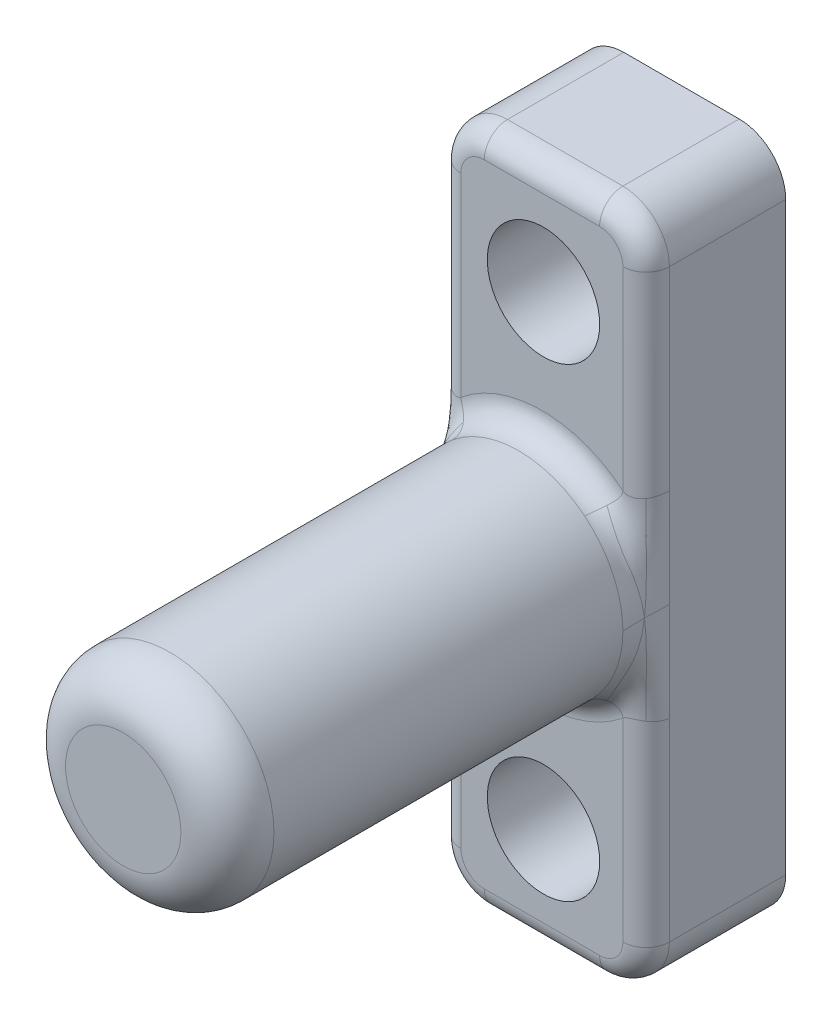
ISO-10303-21;
HEADER;
FILE_DESCRIPTION(('STEP AP214'),'2;1');
FILE_NAME('part.step','',(''),(''),'','','');
FILE_SCHEMA(('AUTOMOTIVE_DESIGN { 1 0 10303 214 1 1 1 1 }'));
ENDSEC;
DATA;
#1=APPLICATION_CONTEXT('core data for automotive mechanical design processes');
#2=APPLICATION_PROTOCOL_DEFINITION('international standard','automotive_design',2000,#1);
#3=PRODUCT_CONTEXT('',#1,'mechanical');
#4=PRODUCT('Part','Part','',(#3));
#5=PRODUCT_RELATED_PRODUCT_CATEGORY('part','',(#4));
#6=PRODUCT_DEFINITION_FORMATION('','',#4);
#7=PRODUCT_DEFINITION_CONTEXT('part definition',#1,'design');
#8=PRODUCT_DEFINITION('design','',#6,#7);
#9=PRODUCT_DEFINITION_SHAPE('','',#8);
#10=(LENGTH_UNIT() NAMED_UNIT(*) SI_UNIT(.MILLI.,.METRE.));
#11=(NAMED_UNIT(*) PLANE_ANGLE_UNIT() SI_UNIT($,.RADIAN.));
#12=(NAMED_UNIT(*) SI_UNIT($,.STERADIAN.) SOLID_ANGLE_UNIT());
#13=UNCERTAINTY_MEASURE_WITH_UNIT(LENGTH_MEASURE(1.E-05),#10,'distance_accuracy_value','');
#14=(GEOMETRIC_REPRESENTATION_CONTEXT(3) GLOBAL_UNCERTAINTY_ASSIGNED_CONTEXT((#13)) GLOBAL_UNIT_ASSIGNED_CONTEXT((#10,
#11,#12)) REPRESENTATION_CONTEXT('',''));
#15=CARTESIAN_POINT('',(0.,0.,0.));
#16=DIRECTION('',(0.,0.,1.));
#17=DIRECTION('',(1.,0.,0.));
#18=AXIS2_PLACEMENT_3D('',#15,#16,#17);
#19=CARTESIAN_POINT('',(-0.0432598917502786,9.60858535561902,25.4));
#20=DIRECTION('',(0.,0.,-1.));
#21=DIRECTION('',(-1.,0.,0.));
#22=AXIS2_PLACEMENT_3D('',#19,#20,#21);
#23=CYLINDRICAL_SURFACE('',#22,3.78463722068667);
#24=CARTESIAN_POINT('',(-0.0432598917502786,9.60858535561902,25.4));
#25=DIRECTION('',(0.,0.,1.));
#26=DIRECTION('',(1.,0.,0.));
#27=AXIS2_PLACEMENT_3D('',#24,#25,#26);
#28=CIRCLE('',#27,3.78463722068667);
#29=CARTESIAN_POINT('',(3.7413773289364,9.60858535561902,25.4));
#30=VERTEX_POINT('',#29);
#31=EDGE_CURVE('E648',#30,#30,#28,.T.);
#32=ORIENTED_EDGE('',*,*,#31,.T.);
#33=EDGE_LOOP('',(#32));
#34=FACE_BOUND('',#33,.T.);
#35=CARTESIAN_POINT('',(-0.0432598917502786,9.60858535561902,0.));
#36=DIRECTION('',(0.,0.,1.));
#37=DIRECTION('',(1.,0.,0.));
#38=AXIS2_PLACEMENT_3D('',#35,#36,#37);
#39=CIRCLE('',#38,3.78463722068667);
#40=CARTESIAN_POINT('',(3.7413773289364,9.60858535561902,0.));
#41=VERTEX_POINT('',#40);
#42=EDGE_CURVE('E641',#41,#41,#39,.T.);
#43=ORIENTED_EDGE('',*,*,#42,.F.);
#44=EDGE_LOOP('',(#43));
#45=FACE_BOUND('',#44,.T.);
#46=ADVANCED_FACE('F34',(#34,#45),#23,.F.);
#47=CARTESIAN_POINT('',(-0.0432598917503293,9.60858535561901,25.4));
#48=DIRECTION('',(0.,0.,1.));
#49=DIRECTION('',(1.,0.,0.));
#50=AXIS2_PLACEMENT_3D('',#47,#48,#49);
#51=PLANE('',#50);
#52=ORIENTED_EDGE('',*,*,#31,.F.);
#53=EDGE_LOOP('',(#52));
#54=FACE_BOUND('',#53,.T.);
#55=ADVANCED_FACE('F724',(#54),#51,.F.);
#56=CARTESIAN_POINT('',(-0.0432598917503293,9.60858535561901,25.4));
#57=DIRECTION('',(0.,0.,-1.));
#58=DIRECTION('',(-1.,0.,0.));
#59=AXIS2_PLACEMENT_3D('',#56,#57,#58);
#60=CYLINDRICAL_SURFACE('',#59,5.68963722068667);
#61=CARTESIAN_POINT('',(-0.0432598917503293,9.60858535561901,27.94));
#62=DIRECTION('',(0.,0.,1.));
#63=DIRECTION('',(1.,0.,0.));
#64=AXIS2_PLACEMENT_3D('',#61,#62,#63);
#65=CIRCLE('',#64,5.68963722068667);
#66=CARTESIAN_POINT('',(5.64637732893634,9.60858535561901,27.94));
#67=VERTEX_POINT('',#66);
#68=EDGE_CURVE('E702',#67,#67,#65,.F.);
#69=ORIENTED_EDGE('',*,*,#68,.T.);
#70=EDGE_LOOP('',(#69));
#71=FACE_BOUND('',#70,.T.);
#72=CARTESIAN_POINT('',(5.64637732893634,9.60858535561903,8.89));
#73=CARTESIAN_POINT('',(5.64637732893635,9.41568895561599,8.89));
#74=CARTESIAN_POINT('',(5.6366366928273,9.22277405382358,8.89));
#75=CARTESIAN_POINT('',(5.59725745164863,8.83745097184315,8.89));
#76=CARTESIAN_POINT('',(5.56761884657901,8.64504279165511,8.89));
#77=CARTESIAN_POINT('',(5.4880269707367,8.26127687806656,8.89));
#78=CARTESIAN_POINT('',(5.43806298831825,8.06988057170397,8.89));
#79=CARTESIAN_POINT('',(5.31662641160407,7.6891689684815,8.89));
#80=CARTESIAN_POINT('',(5.24515381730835,7.49985367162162,8.89));
#81=CARTESIAN_POINT('',(4.99671433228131,6.936690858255,8.89));
#82=CARTESIAN_POINT('',(4.78561707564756,6.56745978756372,8.89));
#83=CARTESIAN_POINT('',(4.25926025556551,5.85960977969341,8.89));
#84=CARTESIAN_POINT('',(3.94378162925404,5.52082852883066,8.89));
#85=CARTESIAN_POINT('',(3.56987849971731,5.21345137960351,8.89));
#86=B_SPLINE_CURVE_WITH_KNOTS('',3,(#72,#73,#74,#75,#76,#77,#78,#79,#80,#81,#82,#83,#84,#85),
.UNSPECIFIED.,.F.,.F.,(4,2,2,2,2,2,4),(0.,0.125,0.25,0.375,0.5,0.75,1.),.UNSPECIFIED.);
#87=CARTESIAN_POINT('',(5.64637732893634,9.60858535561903,8.89));
#88=VERTEX_POINT('',#87);
#89=CARTESIAN_POINT('',(3.56987849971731,5.21345137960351,8.89));
#90=VERTEX_POINT('',#89);
#91=EDGE_CURVE('E470',#88,#90,#86,.T.);
#92=ORIENTED_EDGE('',*,*,#91,.F.);
#93=CARTESIAN_POINT('',(3.56987849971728,14.0037193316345,8.89));
#94=CARTESIAN_POINT('',(3.94378162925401,13.6963421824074,8.89));
#95=CARTESIAN_POINT('',(4.25926025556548,13.3575609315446,8.89));
#96=CARTESIAN_POINT('',(4.78561707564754,12.6497109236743,8.89));
#97=CARTESIAN_POINT('',(4.99671433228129,12.280479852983,8.89));
#98=CARTESIAN_POINT('',(5.24515381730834,11.7173170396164,8.89));
#99=CARTESIAN_POINT('',(5.31662641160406,11.5280017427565,8.89));
#100=CARTESIAN_POINT('',(5.43806298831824,11.1472901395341,8.89));
#101=CARTESIAN_POINT('',(5.48802697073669,10.9558938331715,8.89));
#102=CARTESIAN_POINT('',(5.567618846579,10.5721279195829,8.89));
#103=CARTESIAN_POINT('',(5.59725745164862,10.3797197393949,8.89));
#104=CARTESIAN_POINT('',(5.6366366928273,9.99439665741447,8.89));
#105=CARTESIAN_POINT('',(5.64637732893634,9.80148175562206,8.89));
#106=CARTESIAN_POINT('',(5.64637732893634,9.60858535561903,8.89));
#107=B_SPLINE_CURVE_WITH_KNOTS('',3,(#93,#94,#95,#96,#97,#98,#99,#100,#101,#102,#103,#104,#105,
#106),.UNSPECIFIED.,.F.,.F.,(4,2,2,2,2,2,4),(0.,0.25,0.5,0.625,0.75,0.875,1.),.UNSPECIFIED.);
#108=CARTESIAN_POINT('',(3.56987849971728,14.0037193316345,8.89));
#109=VERTEX_POINT('',#108);
#110=EDGE_CURVE('E748',#109,#88,#107,.T.);
#111=ORIENTED_EDGE('',*,*,#110,.F.);
#112=CARTESIAN_POINT('',(-0.0432598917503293,9.60858535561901,8.89));
#113=DIRECTION('',(0.,0.,1.));
#114=DIRECTION('',(1.,0.,0.));
#115=AXIS2_PLACEMENT_3D('',#112,#113,#114);
#116=CIRCLE('',#115,5.68963722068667);
#117=CARTESIAN_POINT('',(-3.65639828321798,14.0037193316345,8.89));
#118=VERTEX_POINT('',#117);
#119=EDGE_CURVE('E741',#109,#118,#116,.T.);
#120=ORIENTED_EDGE('',*,*,#119,.T.);
#121=CARTESIAN_POINT('',(-5.732897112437,9.60858535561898,8.89));
#122=CARTESIAN_POINT('',(-5.732897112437,9.80148175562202,8.89));
#123=CARTESIAN_POINT('',(-5.72315647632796,9.99439665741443,8.89));
#124=CARTESIAN_POINT('',(-5.68377723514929,10.3797197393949,8.89));
#125=CARTESIAN_POINT('',(-5.65413863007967,10.5721279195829,8.89));
#126=CARTESIAN_POINT('',(-5.57454675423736,10.9558938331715,8.89));
#127=CARTESIAN_POINT('',(-5.5245827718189,11.147290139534,8.89));
#128=CARTESIAN_POINT('',(-5.40314619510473,11.5280017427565,8.89));
#129=CARTESIAN_POINT('',(-5.33167360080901,11.7173170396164,8.89));
#130=CARTESIAN_POINT('',(-5.08323411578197,12.280479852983,8.89));
#131=CARTESIAN_POINT('',(-4.87213685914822,12.6497109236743,8.89));
#132=CARTESIAN_POINT('',(-4.34578003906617,13.3575609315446,8.89));
#133=CARTESIAN_POINT('',(-4.0303014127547,13.6963421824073,8.89));
#134=CARTESIAN_POINT('',(-3.65639828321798,14.0037193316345,8.89));
#135=B_SPLINE_CURVE_WITH_KNOTS('',3,(#121,#122,#123,#124,#125,#126,#127,#128,#129,#130,#131,
#132,#133,#134),.UNSPECIFIED.,.F.,.F.,(4,2,2,2,2,2,4),(0.,0.125,0.25,0.375,0.5,0.75,1.),.UNSPECIFIED.);
#136=CARTESIAN_POINT('',(-5.732897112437,9.60858535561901,8.89));
#137=VERTEX_POINT('',#136);
#138=EDGE_CURVE('E705',#137,#118,#135,.T.);
#139=ORIENTED_EDGE('',*,*,#138,.F.);
#140=CARTESIAN_POINT('',(-3.65639828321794,5.21345137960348,8.89));
#141=CARTESIAN_POINT('',(-4.03030141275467,5.52082852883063,8.89));
#142=CARTESIAN_POINT('',(-4.34578003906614,5.85960977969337,8.89));
#143=CARTESIAN_POINT('',(-4.87213685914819,6.56745978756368,8.89));
#144=CARTESIAN_POINT('',(-5.08323411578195,6.93669085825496,8.89));
#145=CARTESIAN_POINT('',(-5.33167360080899,7.49985367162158,8.89));
#146=CARTESIAN_POINT('',(-5.40314619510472,7.68916896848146,8.89));
#147=CARTESIAN_POINT('',(-5.52458277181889,8.06988057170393,8.89));
#148=CARTESIAN_POINT('',(-5.57454675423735,8.26127687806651,8.89));
#149=CARTESIAN_POINT('',(-5.65413863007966,8.64504279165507,8.89));
#150=CARTESIAN_POINT('',(-5.68377723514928,8.83745097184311,8.89));
#151=CARTESIAN_POINT('',(-5.72315647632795,9.22277405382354,8.89));
#152=CARTESIAN_POINT('',(-5.732897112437,9.41568895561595,8.89));
#153=CARTESIAN_POINT('',(-5.732897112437,9.60858535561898,8.89));
#154=B_SPLINE_CURVE_WITH_KNOTS('',3,(#140,#141,#142,#143,#144,#145,#146,#147,#148,#149,#150,
#151,#152,#153),.UNSPECIFIED.,.F.,.F.,(4,2,2,2,2,2,4),(0.,0.25,0.5,0.625,0.75,0.875,1.),.UNSPECIFIED.);
#155=CARTESIAN_POINT('',(-3.65639828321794,5.21345137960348,8.89));
#156=VERTEX_POINT('',#155);
#157=EDGE_CURVE('E749',#156,#137,#154,.T.);
#158=ORIENTED_EDGE('',*,*,#157,.F.);
#159=CARTESIAN_POINT('',(-0.0432598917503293,9.60858535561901,8.89));
#160=DIRECTION('',(0.,0.,1.));
#161=DIRECTION('',(1.,0.,0.));
#162=AXIS2_PLACEMENT_3D('',#159,#160,#161);
#163=CIRCLE('',#162,5.68963722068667);
#164=EDGE_CURVE('E756',#156,#90,#163,.T.);
#165=ORIENTED_EDGE('',*,*,#164,.T.);
#166=EDGE_LOOP('',(#92,#111,#120,#139,#158,#165));
#167=FACE_BOUND('',#166,.T.);
#168=ADVANCED_FACE('F713',(#71,#167),#60,.T.);
#169=CARTESIAN_POINT('',(-3.19289711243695,-6.35755237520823,7.62));
#170=DIRECTION('',(0.,0.,1.));
#171=DIRECTION('',(1.,0.,0.));
#172=AXIS2_PLACEMENT_3D('',#169,#170,#171);
#173=PLANE('',#172);
#174=DIRECTION('',(0.,-1.,0.));
#175=VECTOR('',#174,1.);
#176=CARTESIAN_POINT('',(-4.462897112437,9.60858535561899,7.62));
#177=LINE('',#176,#175);
#178=CARTESIAN_POINT('',(-4.46289711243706,25.5747230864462,7.62));
#179=VERTEX_POINT('',#178);
#180=CARTESIAN_POINT('',(-4.46289711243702,14.9847696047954,7.62));
#181=VERTEX_POINT('',#180);
#182=EDGE_CURVE('E849',#179,#181,#177,.T.);
#183=ORIENTED_EDGE('',*,*,#182,.T.);
#184=CARTESIAN_POINT('',(-0.0432598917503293,9.60858535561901,7.62));
#185=DIRECTION('',(0.,0.,1.));
#186=DIRECTION('',(1.,0.,0.));
#187=AXIS2_PLACEMENT_3D('',#184,#185,#186);
#188=CIRCLE('',#187,6.95963722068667);
#189=CARTESIAN_POINT('',(4.37637732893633,14.9847696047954,7.62));
#190=VERTEX_POINT('',#189);
#191=EDGE_CURVE('E857',#181,#190,#188,.F.);
#192=ORIENTED_EDGE('',*,*,#191,.T.);
#193=DIRECTION('',(0.,1.,0.));
#194=VECTOR('',#193,1.);
#195=CARTESIAN_POINT('',(4.37637732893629,25.5747230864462,7.62));
#196=LINE('',#195,#194);
#197=CARTESIAN_POINT('',(4.37637732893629,25.5747230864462,7.62));
#198=VERTEX_POINT('',#197);
#199=EDGE_CURVE('E853',#190,#198,#196,.T.);
#200=ORIENTED_EDGE('',*,*,#199,.T.);
#201=CARTESIAN_POINT('',(3.10637732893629,25.5747230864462,7.62));
#202=DIRECTION('',(0.,0.,1.));
#203=DIRECTION('',(1.,0.,0.));
#204=AXIS2_PLACEMENT_3D('',#201,#202,#203);
#205=CIRCLE('',#204,1.27);
#206=CARTESIAN_POINT('',(3.10637732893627,26.8447230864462,7.62));
#207=VERTEX_POINT('',#206);
#208=EDGE_CURVE('E881',#198,#207,#205,.T.);
#209=ORIENTED_EDGE('',*,*,#208,.T.);
#210=DIRECTION('',(-1.,0.,0.));
#211=VECTOR('',#210,1.);
#212=CARTESIAN_POINT('',(-3.19289711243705,26.8447230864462,7.62));
#213=LINE('',#212,#211);
#214=CARTESIAN_POINT('',(-3.19289711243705,26.8447230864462,7.62));
#215=VERTEX_POINT('',#214);
#216=EDGE_CURVE('E858',#207,#215,#213,.T.);
#217=ORIENTED_EDGE('',*,*,#216,.T.);
#218=CARTESIAN_POINT('',(-3.19289711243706,25.5747230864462,7.62));
#219=DIRECTION('',(0.,0.,1.));
#220=DIRECTION('',(1.,0.,0.));
#221=AXIS2_PLACEMENT_3D('',#218,#219,#220);
#222=CIRCLE('',#221,1.27);
#223=EDGE_CURVE('E854',#215,#179,#222,.T.);
#224=ORIENTED_EDGE('',*,*,#223,.T.);
#225=EDGE_LOOP('',(#183,#192,#200,#209,#217,#224));
#226=FACE_BOUND('',#225,.T.);
#227=CARTESIAN_POINT('',(0.0419009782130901,22.208531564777,7.62));
#228=DIRECTION('',(0.,0.,1.));
#229=DIRECTION('',(1.,0.,0.));
#230=AXIS2_PLACEMENT_3D('',#227,#228,#229);
#231=CIRCLE('',#230,3.06771445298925);
#232=CARTESIAN_POINT('',(3.10961543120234,22.208531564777,7.62));
#233=VERTEX_POINT('',#232);
#234=EDGE_CURVE('E652',#233,#233,#231,.T.);
#235=ORIENTED_EDGE('',*,*,#234,.F.);
#236=EDGE_LOOP('',(#235));
#237=FACE_BOUND('',#236,.T.);
#238=ADVANCED_FACE('F723',(#226,#237),#173,.T.);
#239=DIRECTION('',(0.,1.,0.));
#240=VECTOR('',#239,1.);
#241=CARTESIAN_POINT('',(4.37637732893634,9.60858535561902,7.62));
#242=LINE('',#241,#240);
#243=CARTESIAN_POINT('',(4.3763773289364,-6.35755237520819,7.62));
#244=VERTEX_POINT('',#243);
#245=CARTESIAN_POINT('',(4.37637732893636,4.23240110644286,7.62));
#246=VERTEX_POINT('',#245);
#247=EDGE_CURVE('E869',#244,#246,#242,.T.);
#248=ORIENTED_EDGE('',*,*,#247,.T.);
#249=CARTESIAN_POINT('',(-0.0432598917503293,9.60858535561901,7.62));
#250=DIRECTION('',(0.,0.,1.));
#251=DIRECTION('',(1.,0.,0.));
#252=AXIS2_PLACEMENT_3D('',#249,#250,#251);
#253=CIRCLE('',#252,6.95963722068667);
#254=CARTESIAN_POINT('',(-4.46289711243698,4.23240110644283,7.62));
#255=VERTEX_POINT('',#254);
#256=EDGE_CURVE('E871',#246,#255,#253,.F.);
#257=ORIENTED_EDGE('',*,*,#256,.T.);
#258=DIRECTION('',(0.,-1.,0.));
#259=VECTOR('',#258,1.);
#260=CARTESIAN_POINT('',(-4.46289711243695,-6.35755237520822,7.62));
#261=LINE('',#260,#259);
#262=CARTESIAN_POINT('',(-4.46289711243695,-6.35755237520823,7.62));
#263=VERTEX_POINT('',#262);
#264=EDGE_CURVE('E764',#255,#263,#261,.T.);
#265=ORIENTED_EDGE('',*,*,#264,.T.);
#266=CARTESIAN_POINT('',(-3.19289711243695,-6.35755237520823,7.62));
#267=DIRECTION('',(0.,0.,1.));
#268=DIRECTION('',(1.,0.,0.));
#269=AXIS2_PLACEMENT_3D('',#266,#267,#268);
#270=CIRCLE('',#269,1.27);
#271=CARTESIAN_POINT('',(-3.19289711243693,-7.62755237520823,7.62));
#272=VERTEX_POINT('',#271);
#273=EDGE_CURVE('E876',#263,#272,#270,.T.);
#274=ORIENTED_EDGE('',*,*,#273,.T.);
#275=DIRECTION('',(1.,0.,0.));
#276=VECTOR('',#275,1.);
#277=CARTESIAN_POINT('',(3.10637732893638,-7.62755237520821,7.62));
#278=LINE('',#277,#276);
#279=CARTESIAN_POINT('',(3.10637732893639,-7.62755237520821,7.62));
#280=VERTEX_POINT('',#279);
#281=EDGE_CURVE('E1488',#272,#280,#278,.T.);
#282=ORIENTED_EDGE('',*,*,#281,.T.);
#283=CARTESIAN_POINT('',(3.1063773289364,-6.35755237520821,7.62));
#284=DIRECTION('',(0.,0.,1.));
#285=DIRECTION('',(1.,0.,0.));
#286=AXIS2_PLACEMENT_3D('',#283,#284,#285);
#287=CIRCLE('',#286,1.27);
#288=EDGE_CURVE('E872',#280,#244,#287,.T.);
#289=ORIENTED_EDGE('',*,*,#288,.T.);
#290=EDGE_LOOP('',(#248,#257,#265,#274,#282,#289));
#291=FACE_BOUND('',#290,.T.);
#292=CARTESIAN_POINT('',(0.0419009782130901,-3.19146843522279,7.62));
#293=DIRECTION('',(0.,0.,1.));
#294=DIRECTION('',(1.,0.,0.));
#295=AXIS2_PLACEMENT_3D('',#292,#293,#294);
#296=CIRCLE('',#295,3.06771445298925);
#297=CARTESIAN_POINT('',(3.10961543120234,-3.19146843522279,7.62));
#298=VERTEX_POINT('',#297);
#299=EDGE_CURVE('E658',#298,#298,#296,.T.);
#300=ORIENTED_EDGE('',*,*,#299,.F.);
#301=EDGE_LOOP('',(#300));
#302=FACE_BOUND('',#301,.T.);
#303=ADVANCED_FACE('F1013',(#291,#302),#173,.T.);
#304=CARTESIAN_POINT('',(-3.19289711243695,-6.35755237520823,0.));
#305=DIRECTION('',(0.,0.,1.));
#306=DIRECTION('',(1.,0.,0.));
#307=AXIS2_PLACEMENT_3D('',#304,#305,#306);
#308=PLANE('',#307);
#309=ORIENTED_EDGE('',*,*,#42,.T.);
#310=EDGE_LOOP('',(#309));
#311=FACE_BOUND('',#310,.T.);
#312=CARTESIAN_POINT('',(-3.19289711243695,-6.35755237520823,0.));
#313=DIRECTION('',(0.,0.,1.));
#314=DIRECTION('',(1.,0.,0.));
#315=AXIS2_PLACEMENT_3D('',#312,#313,#314);
#316=CIRCLE('',#315,2.54);
#317=CARTESIAN_POINT('',(-5.73289711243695,-6.35755237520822,0.));
#318=VERTEX_POINT('',#317);
#319=CARTESIAN_POINT('',(-3.19289711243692,-8.89755237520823,0.));
#320=VERTEX_POINT('',#319);
#321=EDGE_CURVE('E661',#318,#320,#316,.T.);
#322=ORIENTED_EDGE('',*,*,#321,.F.);
#323=DIRECTION('',(0.,-1.,0.));
#324=VECTOR('',#323,1.);
#325=CARTESIAN_POINT('',(-5.73289711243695,-6.35755237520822,0.));
#326=LINE('',#325,#324);
#327=CARTESIAN_POINT('',(-5.73289711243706,25.5747230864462,0.));
#328=VERTEX_POINT('',#327);
#329=EDGE_CURVE('E683',#328,#318,#326,.T.);
#330=ORIENTED_EDGE('',*,*,#329,.F.);
#331=CARTESIAN_POINT('',(-3.19289711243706,25.5747230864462,0.));
#332=DIRECTION('',(0.,0.,1.));
#333=DIRECTION('',(-1.,0.,0.));
#334=AXIS2_PLACEMENT_3D('',#331,#332,#333);
#335=CIRCLE('',#334,2.54);
#336=CARTESIAN_POINT('',(-3.19289711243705,28.1147230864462,0.));
#337=VERTEX_POINT('',#336);
#338=EDGE_CURVE('E680',#337,#328,#335,.T.);
#339=ORIENTED_EDGE('',*,*,#338,.F.);
#340=DIRECTION('',(-1.,0.,0.));
#341=VECTOR('',#340,1.);
#342=CARTESIAN_POINT('',(-3.19289711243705,28.1147230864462,0.));
#343=LINE('',#342,#341);
#344=CARTESIAN_POINT('',(3.10637732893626,28.1147230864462,0.));
#345=VERTEX_POINT('',#344);
#346=EDGE_CURVE('E677',#345,#337,#343,.T.);
#347=ORIENTED_EDGE('',*,*,#346,.F.);
#348=CARTESIAN_POINT('',(3.10637732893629,25.5747230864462,0.));
#349=DIRECTION('',(0.,0.,1.));
#350=DIRECTION('',(1.,0.,0.));
#351=AXIS2_PLACEMENT_3D('',#348,#349,#350);
#352=CIRCLE('',#351,2.54);
#353=CARTESIAN_POINT('',(5.64637732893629,25.5747230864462,0.));
#354=VERTEX_POINT('',#353);
#355=EDGE_CURVE('E674',#354,#345,#352,.T.);
#356=ORIENTED_EDGE('',*,*,#355,.F.);
#357=DIRECTION('',(0.,1.,0.));
#358=VECTOR('',#357,1.);
#359=CARTESIAN_POINT('',(5.6463773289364,-6.35755237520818,0.));
#360=LINE('',#359,#358);
#361=CARTESIAN_POINT('',(5.6463773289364,-6.35755237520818,0.));
#362=VERTEX_POINT('',#361);
#363=EDGE_CURVE('E671',#362,#354,#360,.T.);
#364=ORIENTED_EDGE('',*,*,#363,.F.);
#365=CARTESIAN_POINT('',(3.1063773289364,-6.35755237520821,0.));
#366=DIRECTION('',(0.,0.,1.));
#367=DIRECTION('',(1.,0.,0.));
#368=AXIS2_PLACEMENT_3D('',#365,#366,#367);
#369=CIRCLE('',#368,2.54);
#370=CARTESIAN_POINT('',(3.10637732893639,-8.89755237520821,0.));
#371=VERTEX_POINT('',#370);
#372=EDGE_CURVE('E668',#371,#362,#369,.T.);
#373=ORIENTED_EDGE('',*,*,#372,.F.);
#374=DIRECTION('',(1.,0.,0.));
#375=VECTOR('',#374,1.);
#376=CARTESIAN_POINT('',(-3.19289711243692,-8.89755237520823,0.));
#377=LINE('',#376,#375);
#378=EDGE_CURVE('E666',#320,#371,#377,.T.);
#379=ORIENTED_EDGE('',*,*,#378,.F.);
#380=EDGE_LOOP('',(#322,#330,#339,#347,#356,#364,#373,#379));
#381=FACE_BOUND('',#380,.T.);
#382=CARTESIAN_POINT('',(0.0419009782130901,-3.19146843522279,0.));
#383=DIRECTION('',(0.,0.,1.));
#384=DIRECTION('',(1.,0.,0.));
#385=AXIS2_PLACEMENT_3D('',#382,#383,#384);
#386=CIRCLE('',#385,3.06771445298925);
#387=CARTESIAN_POINT('',(3.10961543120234,-3.19146843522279,0.));
#388=VERTEX_POINT('',#387);
#389=EDGE_CURVE('E655',#388,#388,#386,.T.);
#390=ORIENTED_EDGE('',*,*,#389,.T.);
#391=EDGE_LOOP('',(#390));
#392=FACE_BOUND('',#391,.T.);
#393=CARTESIAN_POINT('',(0.0419009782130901,22.208531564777,0.));
#394=DIRECTION('',(0.,0.,1.));
#395=DIRECTION('',(1.,0.,0.));
#396=AXIS2_PLACEMENT_3D('',#393,#394,#395);
#397=CIRCLE('',#396,3.06771445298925);
#398=CARTESIAN_POINT('',(3.10961543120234,22.208531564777,0.));
#399=VERTEX_POINT('',#398);
#400=EDGE_CURVE('E651',#399,#399,#397,.T.);
#401=ORIENTED_EDGE('',*,*,#400,.T.);
#402=EDGE_LOOP('',(#401));
#403=FACE_BOUND('',#402,.T.);
#404=ADVANCED_FACE('F1008',(#311,#381,#392,#403),#308,.F.);
#405=CARTESIAN_POINT('',(-3.19289711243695,-6.35755237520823,7.62));
#406=DIRECTION('',(0.,0.,-1.));
#407=DIRECTION('',(-1.,0.,0.));
#408=AXIS2_PLACEMENT_3D('',#405,#406,#407);
#409=CYLINDRICAL_SURFACE('',#408,2.54);
#410=DIRECTION('',(0.,0.,-1.));
#411=VECTOR('',#410,1.);
#412=CARTESIAN_POINT('',(-3.19289711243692,-8.89755237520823,7.62));
#413=LINE('',#412,#411);
#414=CARTESIAN_POINT('',(-3.19289711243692,-8.89755237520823,6.35));
#415=VERTEX_POINT('',#414);
#416=EDGE_CURVE('E106',#415,#320,#413,.T.);
#417=ORIENTED_EDGE('',*,*,#416,.F.);
#418=CARTESIAN_POINT('',(-3.19289711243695,-6.35755237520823,6.35));
#419=DIRECTION('',(0.,0.,1.));
#420=DIRECTION('',(1.,0.,0.));
#421=AXIS2_PLACEMENT_3D('',#418,#419,#420);
#422=CIRCLE('',#421,2.54);
#423=CARTESIAN_POINT('',(-5.73289711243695,-6.35755237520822,6.35));
#424=VERTEX_POINT('',#423);
#425=EDGE_CURVE('E1075',#415,#424,#422,.F.);
#426=ORIENTED_EDGE('',*,*,#425,.T.);
#427=DIRECTION('',(0.,0.,-1.));
#428=VECTOR('',#427,1.);
#429=CARTESIAN_POINT('',(-5.73289711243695,-6.35755237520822,7.62));
#430=LINE('',#429,#428);
#431=EDGE_CURVE('E224',#424,#318,#430,.T.);
#432=ORIENTED_EDGE('',*,*,#431,.T.);
#433=ORIENTED_EDGE('',*,*,#321,.T.);
#434=EDGE_LOOP('',(#417,#426,#432,#433));
#435=FACE_BOUND('',#434,.T.);
#436=ADVANCED_FACE('F1006',(#435),#409,.T.);
#437=CARTESIAN_POINT('',(-3.19289711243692,-8.89755237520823,7.62));
#438=DIRECTION('',(0.,1.,0.));
#439=DIRECTION('',(-1.,0.,0.));
#440=AXIS2_PLACEMENT_3D('',#437,#438,#439);
#441=PLANE('',#440);
#442=DIRECTION('',(0.,0.,-1.));
#443=VECTOR('',#442,1.);
#444=CARTESIAN_POINT('',(3.10637732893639,-8.89755237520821,7.62));
#445=LINE('',#444,#443);
#446=CARTESIAN_POINT('',(3.10637732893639,-8.89755237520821,6.35));
#447=VERTEX_POINT('',#446);
#448=EDGE_CURVE('E696',#447,#371,#445,.T.);
#449=ORIENTED_EDGE('',*,*,#448,.F.);
#450=DIRECTION('',(1.,0.,0.));
#451=VECTOR('',#450,1.);
#452=CARTESIAN_POINT('',(-3.19289711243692,-8.89755237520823,6.35));
#453=LINE('',#452,#451);
#454=EDGE_CURVE('E1078',#447,#415,#453,.F.);
#455=ORIENTED_EDGE('',*,*,#454,.T.);
#456=ORIENTED_EDGE('',*,*,#416,.T.);
#457=ORIENTED_EDGE('',*,*,#378,.T.);
#458=EDGE_LOOP('',(#449,#455,#456,#457));
#459=FACE_BOUND('',#458,.T.);
#460=ADVANCED_FACE('F1003',(#459),#441,.F.);
#461=CARTESIAN_POINT('',(3.1063773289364,-6.35755237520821,7.62));
#462=DIRECTION('',(0.,0.,-1.));
#463=DIRECTION('',(-1.,0.,0.));
#464=AXIS2_PLACEMENT_3D('',#461,#462,#463);
#465=CYLINDRICAL_SURFACE('',#464,2.54);
#466=DIRECTION('',(0.,0.,-1.));
#467=VECTOR('',#466,1.);
#468=CARTESIAN_POINT('',(5.6463773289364,-6.35755237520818,7.62));
#469=LINE('',#468,#467);
#470=CARTESIAN_POINT('',(5.6463773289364,-6.35755237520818,6.35));
#471=VERTEX_POINT('',#470);
#472=EDGE_CURVE('E694',#471,#362,#469,.T.);
#473=ORIENTED_EDGE('',*,*,#472,.F.);
#474=CARTESIAN_POINT('',(3.1063773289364,-6.35755237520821,6.35));
#475=DIRECTION('',(0.,0.,1.));
#476=DIRECTION('',(1.,0.,0.));
#477=AXIS2_PLACEMENT_3D('',#474,#475,#476);
#478=CIRCLE('',#477,2.54);
#479=EDGE_CURVE('E1080',#471,#447,#478,.F.);
#480=ORIENTED_EDGE('',*,*,#479,.T.);
#481=ORIENTED_EDGE('',*,*,#448,.T.);
#482=ORIENTED_EDGE('',*,*,#372,.T.);
#483=EDGE_LOOP('',(#473,#480,#481,#482));
#484=FACE_BOUND('',#483,.T.);
#485=ADVANCED_FACE('F998',(#484),#465,.T.);
#486=CARTESIAN_POINT('',(5.6463773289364,-6.35755237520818,7.62));
#487=DIRECTION('',(-1.,0.,0.));
#488=DIRECTION('',(0.,-1.,0.));
#489=AXIS2_PLACEMENT_3D('',#486,#487,#488);
#490=PLANE('',#489);
#491=DIRECTION('',(0.,0.,-1.));
#492=VECTOR('',#491,1.);
#493=CARTESIAN_POINT('',(5.64637732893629,25.5747230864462,7.62));
#494=LINE('',#493,#492);
#495=CARTESIAN_POINT('',(5.64637732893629,25.5747230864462,6.35));
#496=VERTEX_POINT('',#495);
#497=EDGE_CURVE('E692',#496,#354,#494,.T.);
#498=ORIENTED_EDGE('',*,*,#497,.F.);
#499=DIRECTION('',(0.,1.,0.));
#500=VECTOR('',#499,1.);
#501=CARTESIAN_POINT('',(5.64637732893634,9.60858535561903,6.35));
#502=LINE('',#501,#500);
#503=CARTESIAN_POINT('',(5.64637732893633,14.9847696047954,6.35));
#504=VERTEX_POINT('',#503);
#505=EDGE_CURVE('E985',#496,#504,#502,.F.);
#506=ORIENTED_EDGE('',*,*,#505,.T.);
#507=CARTESIAN_POINT('',(5.64637732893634,9.60858535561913,6.35));
#508=CARTESIAN_POINT('',(5.64637732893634,10.0566007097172,6.35));
#509=CARTESIAN_POINT('',(5.64637732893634,10.5046160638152,6.35));
#510=CARTESIAN_POINT('',(5.64637732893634,11.4006467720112,6.35));
#511=CARTESIAN_POINT('',(5.64637732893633,11.8486621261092,6.35));
#512=CARTESIAN_POINT('',(5.64637732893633,13.1927081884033,6.35));
#513=CARTESIAN_POINT('',(5.64637732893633,14.0887388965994,6.35));
#514=CARTESIAN_POINT('',(5.64637732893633,14.9847696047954,6.35));
#515=B_SPLINE_CURVE_WITH_KNOTS('',3,(#507,#508,#509,#510,#511,#512,#513,#514),.UNSPECIFIED.,.F.,
.F.,(4,2,2,4),(0.,0.25,0.5,1.),.UNSPECIFIED.);
#516=CARTESIAN_POINT('',(5.64637732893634,9.60858535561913,6.35));
#517=VERTEX_POINT('',#516);
#518=EDGE_CURVE('E970',#517,#504,#515,.T.);
#519=ORIENTED_EDGE('',*,*,#518,.F.);
#520=CARTESIAN_POINT('',(5.64637732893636,4.23240110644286,6.35));
#521=CARTESIAN_POINT('',(5.64637732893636,5.12843181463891,6.35));
#522=CARTESIAN_POINT('',(5.64637732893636,6.02446252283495,6.35));
#523=CARTESIAN_POINT('',(5.64637732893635,7.36850858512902,6.35));
#524=CARTESIAN_POINT('',(5.64637732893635,7.81652393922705,6.35));
#525=CARTESIAN_POINT('',(5.64637732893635,8.71255464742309,6.35));
#526=CARTESIAN_POINT('',(5.64637732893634,9.16057000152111,6.35));
#527=CARTESIAN_POINT('',(5.64637732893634,9.60858535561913,6.35));
#528=B_SPLINE_CURVE_WITH_KNOTS('',3,(#520,#521,#522,#523,#524,#525,#526,#527),.UNSPECIFIED.,.F.,
.F.,(4,2,2,4),(0.,0.5,0.75,1.),.UNSPECIFIED.);
#529=CARTESIAN_POINT('',(5.64637732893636,4.23240110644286,6.35));
#530=VERTEX_POINT('',#529);
#531=EDGE_CURVE('E968',#530,#517,#528,.T.);
#532=ORIENTED_EDGE('',*,*,#531,.F.);
#533=DIRECTION('',(0.,1.,0.));
#534=VECTOR('',#533,1.);
#535=CARTESIAN_POINT('',(5.6463773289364,-6.35755237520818,6.35));
#536=LINE('',#535,#534);
#537=EDGE_CURVE('E866',#530,#471,#536,.F.);
#538=ORIENTED_EDGE('',*,*,#537,.T.);
#539=ORIENTED_EDGE('',*,*,#472,.T.);
#540=ORIENTED_EDGE('',*,*,#363,.T.);
#541=EDGE_LOOP('',(#498,#506,#519,#532,#538,#539,#540));
#542=FACE_BOUND('',#541,.T.);
#543=ADVANCED_FACE('F987',(#542),#490,.F.);
#544=CARTESIAN_POINT('',(3.10637732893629,25.5747230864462,7.62));
#545=DIRECTION('',(0.,0.,-1.));
#546=DIRECTION('',(-1.,0.,0.));
#547=AXIS2_PLACEMENT_3D('',#544,#545,#546);
#548=CYLINDRICAL_SURFACE('',#547,2.54);
#549=DIRECTION('',(0.,0.,-1.));
#550=VECTOR('',#549,1.);
#551=CARTESIAN_POINT('',(3.10637732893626,28.1147230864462,7.62));
#552=LINE('',#551,#550);
#553=CARTESIAN_POINT('',(3.10637732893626,28.1147230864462,6.35));
#554=VERTEX_POINT('',#553);
#555=EDGE_CURVE('E690',#554,#345,#552,.T.);
#556=ORIENTED_EDGE('',*,*,#555,.F.);
#557=CARTESIAN_POINT('',(3.10637732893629,25.5747230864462,6.35));
#558=DIRECTION('',(0.,0.,1.));
#559=DIRECTION('',(1.,0.,0.));
#560=AXIS2_PLACEMENT_3D('',#557,#558,#559);
#561=CIRCLE('',#560,2.54);
#562=EDGE_CURVE('E11',#554,#496,#561,.F.);
#563=ORIENTED_EDGE('',*,*,#562,.T.);
#564=ORIENTED_EDGE('',*,*,#497,.T.);
#565=ORIENTED_EDGE('',*,*,#355,.T.);
#566=EDGE_LOOP('',(#556,#563,#564,#565));
#567=FACE_BOUND('',#566,.T.);
#568=ADVANCED_FACE('F997',(#567),#548,.T.);
#569=CARTESIAN_POINT('',(-3.19289711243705,28.1147230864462,7.62));
#570=DIRECTION('',(0.,-1.,0.));
#571=DIRECTION('',(1.,0.,0.));
#572=AXIS2_PLACEMENT_3D('',#569,#570,#571);
#573=PLANE('',#572);
#574=DIRECTION('',(0.,0.,-1.));
#575=VECTOR('',#574,1.);
#576=CARTESIAN_POINT('',(-3.19289711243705,28.1147230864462,7.62));
#577=LINE('',#576,#575);
#578=CARTESIAN_POINT('',(-3.19289711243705,28.1147230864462,6.35));
#579=VERTEX_POINT('',#578);
#580=EDGE_CURVE('E688',#579,#337,#577,.T.);
#581=ORIENTED_EDGE('',*,*,#580,.F.);
#582=DIRECTION('',(-1.,0.,0.));
#583=VECTOR('',#582,1.);
#584=CARTESIAN_POINT('',(3.10637732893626,28.1147230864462,6.35));
#585=LINE('',#584,#583);
#586=EDGE_CURVE('E48',#579,#554,#585,.F.);
#587=ORIENTED_EDGE('',*,*,#586,.T.);
#588=ORIENTED_EDGE('',*,*,#555,.T.);
#589=ORIENTED_EDGE('',*,*,#346,.T.);
#590=EDGE_LOOP('',(#581,#587,#588,#589));
#591=FACE_BOUND('',#590,.T.);
#592=ADVANCED_FACE('F1240',(#591),#573,.F.);
#593=CARTESIAN_POINT('',(-3.19289711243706,25.5747230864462,7.62));
#594=DIRECTION('',(0.,0.,-1.));
#595=DIRECTION('',(-1.,0.,0.));
#596=AXIS2_PLACEMENT_3D('',#593,#594,#595);
#597=CYLINDRICAL_SURFACE('',#596,2.54);
#598=DIRECTION('',(0.,0.,-1.));
#599=VECTOR('',#598,1.);
#600=CARTESIAN_POINT('',(-5.73289711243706,25.5747230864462,7.62));
#601=LINE('',#600,#599);
#602=CARTESIAN_POINT('',(-5.73289711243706,25.5747230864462,6.35));
#603=VERTEX_POINT('',#602);
#604=EDGE_CURVE('E686',#603,#328,#601,.T.);
#605=ORIENTED_EDGE('',*,*,#604,.F.);
#606=CARTESIAN_POINT('',(-3.19289711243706,25.5747230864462,6.35));
#607=DIRECTION('',(0.,0.,1.));
#608=DIRECTION('',(1.,0.,0.));
#609=AXIS2_PLACEMENT_3D('',#606,#607,#608);
#610=CIRCLE('',#609,2.54);
#611=EDGE_CURVE('E228',#603,#579,#610,.F.);
#612=ORIENTED_EDGE('',*,*,#611,.T.);
#613=ORIENTED_EDGE('',*,*,#580,.T.);
#614=ORIENTED_EDGE('',*,*,#338,.T.);
#615=EDGE_LOOP('',(#605,#612,#613,#614));
#616=FACE_BOUND('',#615,.T.);
#617=ADVANCED_FACE('F1057',(#616),#597,.T.);
#618=CARTESIAN_POINT('',(-5.73289711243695,-6.35755237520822,7.62));
#619=DIRECTION('',(1.,0.,0.));
#620=DIRECTION('',(0.,1.,0.));
#621=AXIS2_PLACEMENT_3D('',#618,#619,#620);
#622=PLANE('',#621);
#623=ORIENTED_EDGE('',*,*,#431,.F.);
#624=DIRECTION('',(0.,-1.,0.));
#625=VECTOR('',#624,1.);
#626=CARTESIAN_POINT('',(-5.732897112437,9.60858535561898,6.35));
#627=LINE('',#626,#625);
#628=CARTESIAN_POINT('',(-5.73289711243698,4.23240110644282,6.35));
#629=VERTEX_POINT('',#628);
#630=EDGE_CURVE('E216',#424,#629,#627,.F.);
#631=ORIENTED_EDGE('',*,*,#630,.T.);
#632=CARTESIAN_POINT('',(-5.732897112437,9.60858535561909,6.35));
#633=CARTESIAN_POINT('',(-5.732897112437,9.16057000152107,6.35));
#634=CARTESIAN_POINT('',(-5.732897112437,8.71255464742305,6.35));
#635=CARTESIAN_POINT('',(-5.732897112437,7.816523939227,6.35));
#636=CARTESIAN_POINT('',(-5.73289711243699,7.36850858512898,6.35));
#637=CARTESIAN_POINT('',(-5.73289711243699,6.02446252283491,6.35));
#638=CARTESIAN_POINT('',(-5.73289711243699,5.12843181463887,6.35));
#639=CARTESIAN_POINT('',(-5.73289711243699,4.23240110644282,6.35));
#640=B_SPLINE_CURVE_WITH_KNOTS('',3,(#632,#633,#634,#635,#636,#637,#638,#639),.UNSPECIFIED.,.F.,
.F.,(4,2,2,4),(0.,0.25,0.5,1.),.UNSPECIFIED.);
#641=CARTESIAN_POINT('',(-5.732897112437,9.60858535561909,6.35));
#642=VERTEX_POINT('',#641);
#643=EDGE_CURVE('E220',#642,#629,#640,.T.);
#644=ORIENTED_EDGE('',*,*,#643,.F.);
#645=CARTESIAN_POINT('',(-5.73289711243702,14.9847696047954,6.35));
#646=CARTESIAN_POINT('',(-5.73289711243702,14.0887388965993,6.35));
#647=CARTESIAN_POINT('',(-5.73289711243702,13.1927081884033,6.35));
#648=CARTESIAN_POINT('',(-5.73289711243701,11.8486621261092,6.35));
#649=CARTESIAN_POINT('',(-5.73289711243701,11.4006467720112,6.35));
#650=CARTESIAN_POINT('',(-5.73289711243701,10.5046160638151,6.35));
#651=CARTESIAN_POINT('',(-5.732897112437,10.0566007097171,6.35));
#652=CARTESIAN_POINT('',(-5.732897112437,9.60858535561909,6.35));
#653=B_SPLINE_CURVE_WITH_KNOTS('',3,(#645,#646,#647,#648,#649,#650,#651,#652),.UNSPECIFIED.,.F.,
.F.,(4,2,2,4),(0.,0.5,0.75,1.),.UNSPECIFIED.);
#654=CARTESIAN_POINT('',(-5.73289711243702,14.9847696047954,6.35));
#655=VERTEX_POINT('',#654);
#656=EDGE_CURVE('E250',#655,#642,#653,.T.);
#657=ORIENTED_EDGE('',*,*,#656,.F.);
#658=DIRECTION('',(0.,-1.,0.));
#659=VECTOR('',#658,1.);
#660=CARTESIAN_POINT('',(-5.73289711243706,25.5747230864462,6.35));
#661=LINE('',#660,#659);
#662=EDGE_CURVE('E1068',#655,#603,#661,.F.);
#663=ORIENTED_EDGE('',*,*,#662,.T.);
#664=ORIENTED_EDGE('',*,*,#604,.T.);
#665=ORIENTED_EDGE('',*,*,#329,.T.);
#666=EDGE_LOOP('',(#623,#631,#644,#657,#663,#664,#665));
#667=FACE_BOUND('',#666,.T.);
#668=ADVANCED_FACE('F218',(#667),#622,.F.);
#669=CARTESIAN_POINT('',(0.0419009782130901,-3.19146843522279,7.62));
#670=DIRECTION('',(0.,0.,-1.));
#671=DIRECTION('',(-1.,0.,0.));
#672=AXIS2_PLACEMENT_3D('',#669,#670,#671);
#673=CYLINDRICAL_SURFACE('',#672,3.06771445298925);
#674=ORIENTED_EDGE('',*,*,#299,.T.);
#675=EDGE_LOOP('',(#674));
#676=FACE_BOUND('',#675,.T.);
#677=ORIENTED_EDGE('',*,*,#389,.F.);
#678=EDGE_LOOP('',(#677));
#679=FACE_BOUND('',#678,.T.);
#680=ADVANCED_FACE('F1034',(#676,#679),#673,.F.);
#681=CARTESIAN_POINT('',(0.0419009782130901,22.208531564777,7.62));
#682=DIRECTION('',(0.,0.,-1.));
#683=DIRECTION('',(-1.,0.,0.));
#684=AXIS2_PLACEMENT_3D('',#681,#682,#683);
#685=CYLINDRICAL_SURFACE('',#684,3.06771445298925);
#686=ORIENTED_EDGE('',*,*,#234,.T.);
#687=EDGE_LOOP('',(#686));
#688=FACE_BOUND('',#687,.T.);
#689=ORIENTED_EDGE('',*,*,#400,.F.);
#690=EDGE_LOOP('',(#689));
#691=FACE_BOUND('',#690,.T.);
#692=ADVANCED_FACE('F727',(#688,#691),#685,.F.);
#693=CARTESIAN_POINT('',(-0.0432598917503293,9.60858535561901,30.48));
#694=DIRECTION('',(0.,0.,1.));
#695=DIRECTION('',(1.,0.,0.));
#696=AXIS2_PLACEMENT_3D('',#693,#694,#695);
#697=PLANE('',#696);
#698=CARTESIAN_POINT('',(-0.0432598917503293,9.60858535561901,30.48));
#699=DIRECTION('',(0.,0.,1.));
#700=DIRECTION('',(1.,0.,0.));
#701=AXIS2_PLACEMENT_3D('',#698,#699,#700);
#702=CIRCLE('',#701,3.14963722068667);
#703=CARTESIAN_POINT('',(3.10637732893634,9.60858535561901,30.48));
#704=VERTEX_POINT('',#703);
#705=EDGE_CURVE('E699',#704,#704,#702,.T.);
#706=ORIENTED_EDGE('',*,*,#705,.T.);
#707=EDGE_LOOP('',(#706));
#708=FACE_BOUND('',#707,.T.);
#709=ADVANCED_FACE('F1026',(#708),#697,.T.);
#710=CARTESIAN_POINT('',(-0.0432598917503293,9.60858535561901,27.94));
#711=DIRECTION('',(0.,0.,1.));
#712=DIRECTION('',(1.,0.,0.));
#713=AXIS2_PLACEMENT_3D('',#710,#711,#712);
#714=TOROIDAL_SURFACE('',#713,3.14963722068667,2.54);
#715=ORIENTED_EDGE('',*,*,#68,.F.);
#716=EDGE_LOOP('',(#715));
#717=FACE_BOUND('',#716,.T.);
#718=ORIENTED_EDGE('',*,*,#705,.F.);
#719=EDGE_LOOP('',(#718));
#720=FACE_BOUND('',#719,.T.);
#721=ADVANCED_FACE('F508',(#717,#720),#714,.T.);
#722=CARTESIAN_POINT('',(5.61193195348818,9.60858535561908,7.67463526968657));
#723=CARTESIAN_POINT('',(5.61056073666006,9.60858535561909,7.45274626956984));
#724=CARTESIAN_POINT('',(5.61967222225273,9.6085853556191,7.21544251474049));
#725=CARTESIAN_POINT('',(5.65662226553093,9.60858535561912,6.71405116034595));
#726=CARTESIAN_POINT('',(5.64637732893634,9.60858535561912,6.56550492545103));
#727=CARTESIAN_POINT('',(5.64637732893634,9.60858535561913,6.35));
#728=CARTESIAN_POINT('',(5.61158914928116,9.17769265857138,7.61916301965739));
#729=CARTESIAN_POINT('',(5.6121843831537,9.26471354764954,7.43019725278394));
#730=CARTESIAN_POINT('',(5.61960942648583,9.28055749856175,7.21606151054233));
#731=CARTESIAN_POINT('',(5.65664013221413,9.24861034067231,6.71404182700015));
#732=CARTESIAN_POINT('',(5.64637732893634,9.20081923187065,6.56550492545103));
#733=CARTESIAN_POINT('',(5.64637732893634,9.16057000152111,6.35));
#734=CARTESIAN_POINT('',(5.58805617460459,8.7490603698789,7.56700969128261));
#735=CARTESIAN_POINT('',(5.60767821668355,8.8985165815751,7.39955517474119));
#736=CARTESIAN_POINT('',(5.62006917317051,8.91998613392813,7.2023609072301));
#737=CARTESIAN_POINT('',(5.65860909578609,8.8576011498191,6.7117060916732));
#738=CARTESIAN_POINT('',(5.64637732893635,8.77374661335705,6.56227408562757));
#739=CARTESIAN_POINT('',(5.64637732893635,8.71255464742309,6.35));
#740=CARTESIAN_POINT('',(5.5168458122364,7.87759859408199,7.469484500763));
#741=CARTESIAN_POINT('',(5.5748468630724,8.09250670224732,7.32889283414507));
#742=CARTESIAN_POINT('',(5.60428207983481,8.11640340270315,7.1569140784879));
#743=CARTESIAN_POINT('',(5.65600203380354,8.01757738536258,6.70269984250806));
#744=CARTESIAN_POINT('',(5.64637732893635,7.89485466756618,6.55175602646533));
#745=CARTESIAN_POINT('',(5.64637732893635,7.81652393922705,6.35));
#746=CARTESIAN_POINT('',(5.46916842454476,7.43476910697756,7.42411263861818));
#747=CARTESIAN_POINT('',(5.54687591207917,7.65287132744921,7.28798864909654));
#748=CARTESIAN_POINT('',(5.58838947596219,7.67356957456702,7.12428393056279));
#749=CARTESIAN_POINT('',(5.65160312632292,7.56865158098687,6.69558736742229));
#750=CARTESIAN_POINT('',(5.64637732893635,7.44303534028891,6.54446880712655));
#751=CARTESIAN_POINT('',(5.64637732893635,7.36850858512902,6.35));
#752=CARTESIAN_POINT('',(5.32327353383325,6.05690782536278,7.29838468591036));
#753=CARTESIAN_POINT('',(5.43733897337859,6.17568971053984,7.16986173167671));
#754=CARTESIAN_POINT('',(5.51646781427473,6.19097548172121,7.02365642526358));
#755=CARTESIAN_POINT('',(5.62663991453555,6.13875898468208,6.67244531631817));
#756=CARTESIAN_POINT('',(5.64637732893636,6.07125671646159,6.52013053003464));
#757=CARTESIAN_POINT('',(5.64637732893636,6.02446252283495,6.35));
#758=CARTESIAN_POINT('',(5.27002166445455,5.22441973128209,7.25240688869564));
#759=CARTESIAN_POINT('',(5.39779258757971,5.28364722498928,7.125906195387));
#760=CARTESIAN_POINT('',(5.49188150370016,5.26292272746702,6.97560589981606));
#761=CARTESIAN_POINT('',(5.61617387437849,5.18858750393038,6.66295422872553));
#762=CARTESIAN_POINT('',(5.64637732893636,5.13497677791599,6.50060285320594));
#763=CARTESIAN_POINT('',(5.64637732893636,5.12843181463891,6.35));
#764=CARTESIAN_POINT('',(5.27440294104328,4.34268981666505,7.24802561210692));
#765=CARTESIAN_POINT('',(5.40458176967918,4.31929590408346,7.11784678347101));
#766=CARTESIAN_POINT('',(5.49757536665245,4.29172372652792,6.9620374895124));
#767=CARTESIAN_POINT('',(5.61847314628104,4.24827632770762,6.64681120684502));
#768=CARTESIAN_POINT('',(5.64637732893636,4.23240110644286,6.48739421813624));
#769=CARTESIAN_POINT('',(5.64637732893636,4.23240110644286,6.35));
#770=B_SPLINE_SURFACE_WITH_KNOTS('',3,3,((#722,#723,#724,#725,#726,#727),(#728,#729,#730,#731,
#732,#733),(#734,#735,#736,#737,#738,#739),(#740,#741,#742,#743,#744,#745),(#746,#747,#748,#749,
#750,#751),(#752,#753,#754,#755,#756,#757),(#758,#759,#760,#761,#762,#763),(#764,#765,#766,#767,
#768,#769)),.UNSPECIFIED.,.F.,.F.,.F.,(4,2,2,4),(4,2,4),(0.,0.25,0.5,1.),(0.,0.5,1.),.UNSPECIFIED.);
#771=CARTESIAN_POINT('',(5.61193195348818,9.60858535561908,7.67463526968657));
#772=CARTESIAN_POINT('',(5.61158914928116,9.17769265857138,7.61916301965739));
#773=CARTESIAN_POINT('',(5.58805617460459,8.7490603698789,7.56700969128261));
#774=CARTESIAN_POINT('',(5.5168458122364,7.87759859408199,7.469484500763));
#775=CARTESIAN_POINT('',(5.46916842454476,7.43476910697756,7.42411263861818));
#776=CARTESIAN_POINT('',(5.32327353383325,6.05690782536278,7.29838468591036));
#777=CARTESIAN_POINT('',(5.27002166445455,5.22441973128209,7.25240688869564));
#778=CARTESIAN_POINT('',(5.27440294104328,4.34268981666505,7.24802561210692));
#779=B_SPLINE_CURVE_WITH_KNOTS('',3,(#771,#772,#773,#774,#775,#776,#777,#778),.UNSPECIFIED.,.F.,
.F.,(4,2,2,4),(0.,0.25,0.5,1.),.UNSPECIFIED.);
#780=CARTESIAN_POINT('',(5.27440294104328,4.34268981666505,7.24802561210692));
#781=VERTEX_POINT('',#780);
#782=CARTESIAN_POINT('',(5.61193195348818,9.60858535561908,7.67463526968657));
#783=VERTEX_POINT('',#782);
#784=EDGE_CURVE('E97',#781,#783,#779,.F.);
#785=CARTESIAN_POINT('',(5.27440294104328,4.34268981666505,7.24802561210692));
#786=CARTESIAN_POINT('',(5.40458176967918,4.31929590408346,7.11784678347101));
#787=CARTESIAN_POINT('',(5.49757536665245,4.29172372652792,6.9620374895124));
#788=CARTESIAN_POINT('',(5.61847314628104,4.24827632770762,6.64681120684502));
#789=CARTESIAN_POINT('',(5.64637732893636,4.23240110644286,6.48739421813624));
#790=CARTESIAN_POINT('',(5.64637732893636,4.23240110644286,6.35));
#791=B_SPLINE_CURVE_WITH_KNOTS('',3,(#785,#786,#787,#788,#789,#790),.UNSPECIFIED.,.F.,.F.,(4,2,
4),(0.,0.5,1.),.UNSPECIFIED.);
#792=EDGE_CURVE('E624',#781,#530,#791,.T.);
#793=CARTESIAN_POINT('',(5.61193195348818,9.60858535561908,7.67463526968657));
#794=CARTESIAN_POINT('',(5.61056073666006,9.60858535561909,7.45274626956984));
#795=CARTESIAN_POINT('',(5.61967222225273,9.6085853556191,7.21544251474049));
#796=CARTESIAN_POINT('',(5.65662226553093,9.60858535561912,6.71405116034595));
#797=CARTESIAN_POINT('',(5.64637732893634,9.60858535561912,6.56550492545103));
#798=CARTESIAN_POINT('',(5.64637732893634,9.60858535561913,6.35));
#799=B_SPLINE_CURVE_WITH_KNOTS('',3,(#793,#794,#795,#796,#797,#798),.UNSPECIFIED.,.F.,.F.,(4,2,
4),(0.,0.5,1.),.UNSPECIFIED.);
#800=EDGE_CURVE('E1089',#517,#783,#799,.F.);
#801=ORIENTED_EDGE('',*,*,#784,.F.);
#802=ORIENTED_EDGE('',*,*,#792,.T.);
#803=ORIENTED_EDGE('',*,*,#531,.T.);
#804=ORIENTED_EDGE('',*,*,#800,.T.);
#805=EDGE_LOOP('',(#801,#802,#803,#804));
#806=FACE_BOUND('',#805,.T.);
#807=ADVANCED_FACE('F922',(#806),#770,.T.);
#808=CARTESIAN_POINT('',(5.61193195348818,9.60858535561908,7.67463526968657));
#809=CARTESIAN_POINT('',(5.61158914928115,10.0394780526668,7.61916301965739));
#810=CARTESIAN_POINT('',(5.58805617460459,10.4681103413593,7.56700969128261));
#811=CARTESIAN_POINT('',(5.51684581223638,11.3395721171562,7.469484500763));
#812=CARTESIAN_POINT('',(5.46916842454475,11.7824016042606,7.42411263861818));
#813=CARTESIAN_POINT('',(5.32327353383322,13.1602628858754,7.29838468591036));
#814=CARTESIAN_POINT('',(5.27002166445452,13.9927509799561,7.25240688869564));
#815=CARTESIAN_POINT('',(5.27440294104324,14.8744808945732,7.24802561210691));
#816=CARTESIAN_POINT('',(5.61056073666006,9.60858535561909,7.45274626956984));
#817=CARTESIAN_POINT('',(5.6121843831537,9.95245716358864,7.43019725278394));
#818=CARTESIAN_POINT('',(5.60767821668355,10.3186541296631,7.39955517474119));
#819=CARTESIAN_POINT('',(5.57484686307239,11.1246640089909,7.32889283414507));
#820=CARTESIAN_POINT('',(5.54687591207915,11.564299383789,7.28798864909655));
#821=CARTESIAN_POINT('',(5.43733897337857,13.0414810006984,7.16986173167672));
#822=CARTESIAN_POINT('',(5.39779258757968,13.933523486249,7.125906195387));
#823=CARTESIAN_POINT('',(5.40458176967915,14.8978748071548,7.11784678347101));
#824=CARTESIAN_POINT('',(5.61967222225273,9.6085853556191,7.21544251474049));
#825=CARTESIAN_POINT('',(5.61960942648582,9.93661321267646,7.21606151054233));
#826=CARTESIAN_POINT('',(5.62006917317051,10.2971845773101,7.2023609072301));
#827=CARTESIAN_POINT('',(5.6042820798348,11.1007673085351,7.1569140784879));
#828=CARTESIAN_POINT('',(5.58838947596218,11.5436011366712,7.1242839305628));
#829=CARTESIAN_POINT('',(5.51646781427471,13.026195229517,7.02365642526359));
#830=CARTESIAN_POINT('',(5.49188150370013,13.9542479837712,6.97560589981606));
#831=CARTESIAN_POINT('',(5.49757536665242,14.9254469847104,6.9620374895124));
#832=CARTESIAN_POINT('',(5.65662226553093,9.60858535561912,6.71405116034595));
#833=CARTESIAN_POINT('',(5.65664013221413,9.96856037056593,6.71404182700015));
#834=CARTESIAN_POINT('',(5.65860909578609,10.3595695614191,6.7117060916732));
#835=CARTESIAN_POINT('',(5.65600203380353,11.1995933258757,6.70269984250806));
#836=CARTESIAN_POINT('',(5.65160312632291,11.6485191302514,6.69558736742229));
#837=CARTESIAN_POINT('',(5.62663991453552,13.0784117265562,6.67244531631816));
#838=CARTESIAN_POINT('',(5.61617387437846,14.0285832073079,6.66295422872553));
#839=CARTESIAN_POINT('',(5.61847314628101,14.9688943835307,6.64681120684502));
#840=CARTESIAN_POINT('',(5.64637732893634,9.60858535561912,6.56550492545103));
#841=CARTESIAN_POINT('',(5.64637732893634,10.0163514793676,6.56550492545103));
#842=CARTESIAN_POINT('',(5.64637732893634,10.4434240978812,6.56227408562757));
#843=CARTESIAN_POINT('',(5.64637732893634,11.3223160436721,6.55175602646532));
#844=CARTESIAN_POINT('',(5.64637732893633,11.7741353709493,6.54446880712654));
#845=CARTESIAN_POINT('',(5.64637732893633,13.1459139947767,6.52013053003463));
#846=CARTESIAN_POINT('',(5.64637732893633,14.0821939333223,6.50060285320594));
#847=CARTESIAN_POINT('',(5.64637732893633,14.9847696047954,6.48739421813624));
#848=CARTESIAN_POINT('',(5.64637732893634,9.60858535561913,6.35));
#849=CARTESIAN_POINT('',(5.64637732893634,10.0566007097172,6.35));
#850=CARTESIAN_POINT('',(5.64637732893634,10.5046160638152,6.35));
#851=CARTESIAN_POINT('',(5.64637732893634,11.4006467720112,6.35));
#852=CARTESIAN_POINT('',(5.64637732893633,11.8486621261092,6.35));
#853=CARTESIAN_POINT('',(5.64637732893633,13.1927081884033,6.35));
#854=CARTESIAN_POINT('',(5.64637732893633,14.0887388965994,6.35));
#855=CARTESIAN_POINT('',(5.64637732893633,14.9847696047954,6.35));
#856=B_SPLINE_SURFACE_WITH_KNOTS('',3,3,((#808,#809,#810,#811,#812,#813,#814,#815),(#816,#817,
#818,#819,#820,#821,#822,#823),(#824,#825,#826,#827,#828,#829,#830,#831),(#832,#833,#834,#835,
#836,#837,#838,#839),(#840,#841,#842,#843,#844,#845,#846,#847),(#848,#849,#850,#851,#852,#853,
#854,#855)),.UNSPECIFIED.,.F.,.F.,.F.,(4,2,4),(4,2,2,4),(0.,0.5,1.),(0.,0.25,0.5,1.),.UNSPECIFIED.);
#857=CARTESIAN_POINT('',(5.64637732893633,14.9847696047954,6.35));
#858=CARTESIAN_POINT('',(5.64637732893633,14.9847696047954,6.48739421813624));
#859=CARTESIAN_POINT('',(5.61847314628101,14.9688943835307,6.64681120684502));
#860=CARTESIAN_POINT('',(5.49757536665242,14.9254469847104,6.9620374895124));
#861=CARTESIAN_POINT('',(5.40458176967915,14.8978748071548,7.11784678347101));
#862=CARTESIAN_POINT('',(5.27440294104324,14.8744808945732,7.24802561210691));
#863=B_SPLINE_CURVE_WITH_KNOTS('',3,(#857,#858,#859,#860,#861,#862),.UNSPECIFIED.,.F.,.F.,(4,2,
4),(0.,0.5,1.),.UNSPECIFIED.);
#864=CARTESIAN_POINT('',(5.27440294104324,14.8744808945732,7.24802561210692));
#865=VERTEX_POINT('',#864);
#866=EDGE_CURVE('E620',#504,#865,#863,.T.);
#867=CARTESIAN_POINT('',(5.61193195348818,9.60858535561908,7.67463526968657));
#868=CARTESIAN_POINT('',(5.61158914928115,10.0394780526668,7.61916301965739));
#869=CARTESIAN_POINT('',(5.58805617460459,10.4681103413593,7.56700969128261));
#870=CARTESIAN_POINT('',(5.51684581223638,11.3395721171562,7.469484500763));
#871=CARTESIAN_POINT('',(5.46916842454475,11.7824016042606,7.42411263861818));
#872=CARTESIAN_POINT('',(5.3719051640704,12.7009757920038,7.34029400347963));
#873=CARTESIAN_POINT('',(5.33427638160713,13.1387413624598,7.30784489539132));
#874=CARTESIAN_POINT('',(5.28442995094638,14.0050614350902,7.26280601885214));
#875=CARTESIAN_POINT('',(5.27221230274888,14.4336159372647,7.25021625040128));
#876=CARTESIAN_POINT('',(5.27440294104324,14.8744808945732,7.24802561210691));
#877=B_SPLINE_CURVE_WITH_KNOTS('',3,(#867,#868,#869,#870,#871,#872,#873,#874,#875,#876),
.UNSPECIFIED.,.F.,.F.,(4,2,2,2,4),(0.,0.25,0.5,0.75,1.),.UNSPECIFIED.);
#878=EDGE_CURVE('E770',#865,#783,#877,.F.);
#879=ORIENTED_EDGE('',*,*,#800,.F.);
#880=ORIENTED_EDGE('',*,*,#518,.T.);
#881=ORIENTED_EDGE('',*,*,#866,.T.);
#882=ORIENTED_EDGE('',*,*,#878,.T.);
#883=EDGE_LOOP('',(#879,#880,#881,#882));
#884=FACE_BOUND('',#883,.T.);
#885=ADVANCED_FACE('F935',(#884),#856,.T.);
#886=CARTESIAN_POINT('',(5.61193195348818,9.60858535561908,7.67463526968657));
#887=CARTESIAN_POINT('',(5.6121033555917,9.82403170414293,7.70237139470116));
#888=CARTESIAN_POINT('',(5.60649804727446,10.0356722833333,7.73430829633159));
#889=CARTESIAN_POINT('',(5.57863545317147,10.4517247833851,7.80296607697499));
#890=CARTESIAN_POINT('',(5.55637816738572,10.6561367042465,7.83968695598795));
#891=CARTESIAN_POINT('',(5.49011306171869,11.0581147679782,7.91429511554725));
#892=CARTESIAN_POINT('',(5.44610524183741,11.2556809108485,7.95218239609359));
#893=CARTESIAN_POINT('',(5.33124051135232,11.6443502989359,8.02550578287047));
#894=CARTESIAN_POINT('',(5.26038360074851,11.8354535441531,8.06094188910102));
#895=CARTESIAN_POINT('',(4.99989139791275,12.3996432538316,8.15814708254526));
#896=CARTESIAN_POINT('',(4.80300886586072,12.7789708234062,8.18209904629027));
#897=CARTESIAN_POINT('',(4.36959510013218,13.5217880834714,8.14821173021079));
#898=CARTESIAN_POINT('',(4.13306386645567,13.8852777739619,8.09037245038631));
#899=CARTESIAN_POINT('',(3.88010499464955,14.2297284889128,7.99159342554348));
#900=CARTESIAN_POINT('',(5.61158914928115,10.0394780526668,7.61916301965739));
#901=CARTESIAN_POINT('',(5.60360429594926,10.2060161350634,7.6503598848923));
#902=CARTESIAN_POINT('',(5.59149318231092,10.374463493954,7.68395079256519));
#903=CARTESIAN_POINT('',(5.5547170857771,10.7147089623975,7.75338965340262));
#904=CARTESIAN_POINT('',(5.5300514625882,10.8865123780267,7.78920905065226));
#905=CARTESIAN_POINT('',(5.46248728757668,11.2334754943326,7.86068770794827));
#906=CARTESIAN_POINT('',(5.41959432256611,11.408649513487,7.8963585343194));
#907=CARTESIAN_POINT('',(5.30862264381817,11.7625551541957,7.96565063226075));
#908=CARTESIAN_POINT('',(5.24076739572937,11.9412705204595,7.99915710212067));
#909=CARTESIAN_POINT('',(4.98519775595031,12.4825182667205,8.09411910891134));
#910=CARTESIAN_POINT('',(4.79513079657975,12.8493678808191,8.11556575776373));
#911=CARTESIAN_POINT('',(4.38367069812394,13.5736063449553,8.07945922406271));
#912=CARTESIAN_POINT('',(4.16209153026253,13.9308830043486,8.0218481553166));
#913=CARTESIAN_POINT('',(3.9300128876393,14.2727788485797,7.92653001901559));
#914=CARTESIAN_POINT('',(5.58805617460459,10.4681103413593,7.56700969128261));
#915=CARTESIAN_POINT('',(5.57655235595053,10.5964304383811,7.59983732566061));
#916=CARTESIAN_POINT('',(5.56123445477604,10.7309339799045,7.63357342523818));
#917=CARTESIAN_POINT('',(5.51976897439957,11.0109370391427,7.70125188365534));
#918=CARTESIAN_POINT('',(5.49362043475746,11.1564445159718,7.73515140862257));
#919=CARTESIAN_POINT('',(5.4252255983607,11.4577945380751,7.80171683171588));
#920=CARTESIAN_POINT('',(5.38298768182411,11.6136585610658,7.83440007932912));
#921=CARTESIAN_POINT('',(5.27523537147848,11.935354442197,7.89788470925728));
#922=CARTESIAN_POINT('',(5.21005617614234,12.1011619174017,7.92851388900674));
#923=CARTESIAN_POINT('',(4.96314173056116,12.6121801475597,8.01713285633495));
#924=CARTESIAN_POINT('',(4.78164292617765,12.9611668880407,8.03632746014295));
#925=CARTESIAN_POINT('',(4.39628007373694,13.6525711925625,8.00375147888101));
#926=CARTESIAN_POINT('',(4.19213698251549,13.9948204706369,7.95189406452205));
#927=CARTESIAN_POINT('',(3.98422707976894,14.3223392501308,7.86810328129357));
#928=CARTESIAN_POINT('',(5.51684581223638,11.3395721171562,7.469484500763));
#929=CARTESIAN_POINT('',(5.49975960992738,11.4116657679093,7.50326455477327));
#930=CARTESIAN_POINT('',(5.47928705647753,11.4949302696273,7.53590708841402));
#931=CARTESIAN_POINT('',(5.43016717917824,11.6811766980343,7.5985926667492));
#932=CARTESIAN_POINT('',(5.40151865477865,11.7841685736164,7.62858216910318));
#933=CARTESIAN_POINT('',(5.33206155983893,12.008132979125,7.68585071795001));
#934=CARTESIAN_POINT('',(5.29126346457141,12.1291323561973,7.71315145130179));
#935=CARTESIAN_POINT('',(5.19113365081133,12.3877420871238,7.76592105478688));
#936=CARTESIAN_POINT('',(5.13222093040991,12.5253219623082,7.79117467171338));
#937=CARTESIAN_POINT('',(4.91100438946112,12.9599171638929,7.86616384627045));
#938=CARTESIAN_POINT('',(4.75162918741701,13.2600257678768,7.88282932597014));
#939=CARTESIAN_POINT('',(4.42437189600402,13.8559037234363,7.86316869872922));
#940=CARTESIAN_POINT('',(4.25614100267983,14.1514627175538,7.82673405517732));
#941=CARTESIAN_POINT('',(4.09343730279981,14.4324872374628,7.76956901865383));
#942=CARTESIAN_POINT('',(5.46916842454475,11.7824016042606,7.42411263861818));
#943=CARTESIAN_POINT('',(5.45017455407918,11.8364522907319,7.45701498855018));
#944=CARTESIAN_POINT('',(5.42786431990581,11.9023868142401,7.48828906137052));
#945=CARTESIAN_POINT('',(5.37592815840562,12.05505227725,7.54758872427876));
#946=CARTESIAN_POINT('',(5.34630111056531,12.141792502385,7.57556434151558));
#947=CARTESIAN_POINT('',(5.27663736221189,12.3339264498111,7.62847441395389));
#948=CARTESIAN_POINT('',(5.23661043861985,12.4393452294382,7.65342911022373));
#949=CARTESIAN_POINT('',(5.14082389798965,12.667035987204,7.70142825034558));
#950=CARTESIAN_POINT('',(5.08545534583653,12.7892795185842,7.72427179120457));
#951=CARTESIAN_POINT('',(4.88112301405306,13.1776501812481,7.79224774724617));
#952=CARTESIAN_POINT('',(4.73517127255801,13.4467480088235,7.80883043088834));
#953=CARTESIAN_POINT('',(4.43976162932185,13.9800192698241,7.79870034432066));
#954=CARTESIAN_POINT('',(4.28997817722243,14.2439963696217,7.77188627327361));
#955=CARTESIAN_POINT('',(4.14841288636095,14.4930360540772,7.72951633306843));
#956=CARTESIAN_POINT('',(5.3719051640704,12.7009757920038,7.34029400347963));
#957=CARTESIAN_POINT('',(5.34717864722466,12.7386954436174,7.37186240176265));
#958=CARTESIAN_POINT('',(5.31998030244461,12.7848053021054,7.40146162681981));
#959=CARTESIAN_POINT('',(5.26074301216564,12.8917898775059,7.45690000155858));
#960=CARTESIAN_POINT('',(5.22870326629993,12.9526712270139,7.48270345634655));
#961=CARTESIAN_POINT('',(5.158164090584,13.0877749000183,7.53087088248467));
#962=CARTESIAN_POINT('',(5.11967164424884,13.1620151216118,7.55324931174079));
#963=CARTESIAN_POINT('',(5.03301578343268,13.3226573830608,7.59554698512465));
#964=CARTESIAN_POINT('',(4.98513170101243,13.4090391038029,7.61532272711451));
#965=CARTESIAN_POINT('',(4.81741102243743,13.6839873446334,7.6728704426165));
#966=CARTESIAN_POINT('',(4.70017785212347,13.8739098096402,7.69090671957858));
#967=CARTESIAN_POINT('',(4.46825764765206,14.2526269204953,7.69862342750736));
#968=CARTESIAN_POINT('',(4.3533380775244,14.4412813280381,7.68823150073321));
#969=CARTESIAN_POINT('',(4.24780840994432,14.6223064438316,7.66910185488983));
#970=CARTESIAN_POINT('',(5.33427638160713,13.1387413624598,7.30784489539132));
#971=CARTESIAN_POINT('',(5.30702923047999,13.1686914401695,7.33926074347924));
#972=CARTESIAN_POINT('',(5.27755899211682,13.2057744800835,7.36868912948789));
#973=CARTESIAN_POINT('',(5.21456752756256,13.2923187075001,7.42366117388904));
#974=CARTESIAN_POINT('',(5.18104574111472,13.3417845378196,7.449179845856));
#975=CARTESIAN_POINT('',(5.10914087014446,13.4516207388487,7.49652228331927));
#976=CARTESIAN_POINT('',(5.07076267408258,13.5120036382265,7.51835616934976));
#977=CARTESIAN_POINT('',(4.98722013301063,13.6423716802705,7.55898065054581));
#978=CARTESIAN_POINT('',(4.94225132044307,13.7123425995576,7.57767079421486));
#979=CARTESIAN_POINT('',(4.79095684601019,13.9342356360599,7.63046088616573));
#980=CARTESIAN_POINT('',(4.68651643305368,14.0878202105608,7.6490598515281));
#981=CARTESIAN_POINT('',(4.4824319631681,14.3936405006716,7.66358210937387));
#982=CARTESIAN_POINT('',(4.38262513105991,14.5457780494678,7.65945475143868));
#983=CARTESIAN_POINT('',(4.29218915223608,14.6909963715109,7.6487486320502));
#984=CARTESIAN_POINT('',(5.28442995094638,14.0050614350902,7.26280601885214));
#985=CARTESIAN_POINT('',(5.25342419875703,14.0183912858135,7.29448013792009));
#986=CARTESIAN_POINT('',(5.22043104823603,14.0359960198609,7.32430107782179));
#987=CARTESIAN_POINT('',(5.15129981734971,14.0785682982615,7.38002804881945));
#988=CARTESIAN_POINT('',(5.11516157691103,14.1035371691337,7.40592694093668));
#989=CARTESIAN_POINT('',(5.04022560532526,14.1597690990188,7.4536297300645));
#990=CARTESIAN_POINT('',(5.00142927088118,14.191035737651,7.47543651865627));
#991=CARTESIAN_POINT('',(4.9213441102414,14.2588435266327,7.51490695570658));
#992=CARTESIAN_POINT('',(4.88011115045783,14.2953806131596,7.53254190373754));
#993=CARTESIAN_POINT('',(4.75197502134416,14.4112399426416,7.5792475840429));
#994=CARTESIAN_POINT('',(4.66578043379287,14.4936954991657,7.59885554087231));
#995=CARTESIAN_POINT('',(4.50202235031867,14.6625510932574,7.62196648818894));
#996=CARTESIAN_POINT('',(4.42441234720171,14.7489230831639,7.62545500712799));
#997=CARTESIAN_POINT('',(4.35648881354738,14.8340479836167,7.62422557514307));
#998=CARTESIAN_POINT('',(5.27221230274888,14.4336159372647,7.25021625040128));
#999=CARTESIAN_POINT('',(5.23996858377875,14.4380951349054,7.28230119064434));
#1000=CARTESIAN_POINT('',(5.20572000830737,14.4452436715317,7.31267363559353));
#1001=CARTESIAN_POINT('',(5.13418874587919,14.464269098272,7.36958301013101));
#1002=CARTESIAN_POINT('',(5.09690605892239,14.476145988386,7.39611993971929));
#1003=CARTESIAN_POINT('',(5.0202821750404,14.5040177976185,7.44494775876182));
#1004=CARTESIAN_POINT('',(4.98094097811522,14.5200127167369,7.46723864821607));
#1005=CARTESIAN_POINT('',(4.90117567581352,14.5555102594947,7.50716386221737));
#1006=CARTESIAN_POINT('',(4.86075157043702,14.575012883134,7.52479818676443));
#1007=CARTESIAN_POINT('',(4.73931829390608,14.6378668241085,7.57010052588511));
#1008=CARTESIAN_POINT('',(4.65856511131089,14.6855232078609,7.59012578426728));
#1009=CARTESIAN_POINT('',(4.50731556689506,14.790343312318,7.61507552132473));
#1010=CARTESIAN_POINT('',(4.43681920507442,14.8475070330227,7.62));
#1011=CARTESIAN_POINT('',(4.37637732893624,14.9084243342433,7.62));
#1012=CARTESIAN_POINT('',(5.27440294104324,14.8744808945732,7.24802561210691));
#1013=CARTESIAN_POINT('',(5.24185823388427,14.8686324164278,7.28057031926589));
#1014=CARTESIAN_POINT('',(5.20727361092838,14.8631140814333,7.3113450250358));
#1015=CARTESIAN_POINT('',(5.13504126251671,14.8534260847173,7.36894696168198));
#1016=CARTESIAN_POINT('',(5.09739353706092,14.8492564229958,7.39577419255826));
#1017=CARTESIAN_POINT('',(5.02005171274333,14.8429541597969,7.44507370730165));
#1018=CARTESIAN_POINT('',(4.98035761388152,14.8408215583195,7.46754599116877));
#1019=CARTESIAN_POINT('',(4.8999397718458,14.8392818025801,7.50772813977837));
#1020=CARTESIAN_POINT('',(4.85921602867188,14.839874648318,7.52543800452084));
#1021=CARTESIAN_POINT('',(4.73702542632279,14.8467739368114,7.57081276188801));
#1022=CARTESIAN_POINT('',(4.65601209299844,14.8581601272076,7.5906720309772));
#1023=CARTESIAN_POINT('',(4.50520183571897,14.9028953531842,7.6152656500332));
#1024=CARTESIAN_POINT('',(4.43540491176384,14.9362443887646,7.62));
#1025=CARTESIAN_POINT('',(4.37637732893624,14.9847696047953,7.62));
#1026=B_SPLINE_SURFACE_WITH_KNOTS('',3,3,((#886,#887,#888,#889,#890,#891,#892,#893,#894,#895,
#896,#897,#898,#899),(#900,#901,#902,#903,#904,#905,#906,#907,#908,#909,#910,#911,#912,#913),
(#914,#915,#916,#917,#918,#919,#920,#921,#922,#923,#924,#925,#926,#927),(#928,#929,#930,#931,
#932,#933,#934,#935,#936,#937,#938,#939,#940,#941),(#942,#943,#944,#945,#946,#947,#948,#949,
#950,#951,#952,#953,#954,#955),(#956,#957,#958,#959,#960,#961,#962,#963,#964,#965,#966,#967,
#968,#969),(#970,#971,#972,#973,#974,#975,#976,#977,#978,#979,#980,#981,#982,#983),(#984,#985,
#986,#987,#988,#989,#990,#991,#992,#993,#994,#995,#996,#997),(#998,#999,#1000,#1001,#1002,#1003,
#1004,#1005,#1006,#1007,#1008,#1009,#1010,#1011),(#1012,#1013,#1014,#1015,#1016,#1017,#1018,
#1019,#1020,#1021,#1022,#1023,#1024,#1025)),.UNSPECIFIED.,.F.,.F.,.F.,(4,2,2,2,4),(4,2,2,2,2,2,
4),(0.,0.25,0.5,0.75,1.),(0.,0.125,0.25,0.375,0.5,0.75,1.),.UNSPECIFIED.);
#1027=CARTESIAN_POINT('',(5.27440294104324,14.8744808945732,7.24802561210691));
#1028=CARTESIAN_POINT('',(5.24185823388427,14.8686324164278,7.28057031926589));
#1029=CARTESIAN_POINT('',(5.20727361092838,14.8631140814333,7.3113450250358));
#1030=CARTESIAN_POINT('',(5.13504126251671,14.8534260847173,7.36894696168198));
#1031=CARTESIAN_POINT('',(5.09739353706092,14.8492564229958,7.39577419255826));
#1032=CARTESIAN_POINT('',(5.02005171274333,14.8429541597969,7.44507370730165));
#1033=CARTESIAN_POINT('',(4.98035761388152,14.8408215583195,7.46754599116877));
#1034=CARTESIAN_POINT('',(4.8999397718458,14.8392818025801,7.50772813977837));
#1035=CARTESIAN_POINT('',(4.85921602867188,14.839874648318,7.52543800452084));
#1036=CARTESIAN_POINT('',(4.73702542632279,14.8467739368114,7.57081276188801));
#1037=CARTESIAN_POINT('',(4.65601209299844,14.8581601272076,7.5906720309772));
#1038=CARTESIAN_POINT('',(4.50520183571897,14.9028953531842,7.6152656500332));
#1039=CARTESIAN_POINT('',(4.43540491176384,14.9362443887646,7.62));
#1040=CARTESIAN_POINT('',(4.37637732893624,14.9847696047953,7.62));
#1041=B_SPLINE_CURVE_WITH_KNOTS('',3,(#1027,#1028,#1029,#1030,#1031,#1032,#1033,#1034,#1035,
#1036,#1037,#1038,#1039,#1040),.UNSPECIFIED.,.F.,.F.,(4,2,2,2,2,2,4),(0.,0.125,0.25,0.375,0.5,
0.75,1.),.UNSPECIFIED.);
#1042=EDGE_CURVE('E614',#865,#190,#1041,.T.);
#1043=CARTESIAN_POINT('',(4.37637732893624,14.9847696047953,7.62));
#1044=CARTESIAN_POINT('',(4.37637732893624,14.9084243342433,7.62));
#1045=CARTESIAN_POINT('',(4.35648881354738,14.8340479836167,7.62422557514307));
#1046=CARTESIAN_POINT('',(4.29218915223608,14.6909963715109,7.6487486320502));
#1047=CARTESIAN_POINT('',(4.24780840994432,14.6223064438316,7.66910185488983));
#1048=CARTESIAN_POINT('',(4.14841288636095,14.4930360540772,7.72951633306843));
#1049=CARTESIAN_POINT('',(4.09343730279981,14.4324872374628,7.76956901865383));
#1050=CARTESIAN_POINT('',(3.98422707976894,14.3223392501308,7.86810328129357));
#1051=CARTESIAN_POINT('',(3.9300128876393,14.2727788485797,7.92653001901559));
#1052=CARTESIAN_POINT('',(3.88010499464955,14.2297284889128,7.99159342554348));
#1053=B_SPLINE_CURVE_WITH_KNOTS('',3,(#1043,#1044,#1045,#1046,#1047,#1048,#1049,#1050,#1051,
#1052),.UNSPECIFIED.,.F.,.F.,(4,2,2,2,4),(0.,0.25,0.5,0.75,1.),.UNSPECIFIED.);
#1054=CARTESIAN_POINT('',(3.88010499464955,14.2297284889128,7.99159342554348));
#1055=VERTEX_POINT('',#1054);
#1056=EDGE_CURVE('E608',#190,#1055,#1053,.T.);
#1057=CARTESIAN_POINT('',(5.61193195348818,9.60858535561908,7.67463526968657));
#1058=CARTESIAN_POINT('',(5.6121033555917,9.82403170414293,7.70237139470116));
#1059=CARTESIAN_POINT('',(5.60649804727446,10.0356722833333,7.73430829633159));
#1060=CARTESIAN_POINT('',(5.57863545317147,10.4517247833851,7.80296607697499));
#1061=CARTESIAN_POINT('',(5.55637816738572,10.6561367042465,7.83968695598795));
#1062=CARTESIAN_POINT('',(5.49011306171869,11.0581147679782,7.91429511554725));
#1063=CARTESIAN_POINT('',(5.44610524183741,11.2556809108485,7.95218239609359));
#1064=CARTESIAN_POINT('',(5.33124051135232,11.6443502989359,8.02550578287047));
#1065=CARTESIAN_POINT('',(5.26038360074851,11.8354535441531,8.06094188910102));
#1066=CARTESIAN_POINT('',(4.99989139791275,12.3996432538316,8.15814708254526));
#1067=CARTESIAN_POINT('',(4.80300886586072,12.7789708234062,8.18209904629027));
#1068=CARTESIAN_POINT('',(4.36959510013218,13.5217880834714,8.14821173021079));
#1069=CARTESIAN_POINT('',(4.13306386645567,13.8852777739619,8.09037245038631));
#1070=CARTESIAN_POINT('',(3.88010499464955,14.2297284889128,7.99159342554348));
#1071=B_SPLINE_CURVE_WITH_KNOTS('',3,(#1057,#1058,#1059,#1060,#1061,#1062,#1063,#1064,#1065,
#1066,#1067,#1068,#1069,#1070),.UNSPECIFIED.,.F.,.F.,(4,2,2,2,2,2,4),(0.,0.125,0.25,0.375,0.5,
0.75,1.),.UNSPECIFIED.);
#1072=EDGE_CURVE('E456',#1055,#783,#1071,.F.);
#1073=ORIENTED_EDGE('',*,*,#878,.F.);
#1074=ORIENTED_EDGE('',*,*,#1042,.T.);
#1075=ORIENTED_EDGE('',*,*,#1056,.T.);
#1076=ORIENTED_EDGE('',*,*,#1072,.T.);
#1077=EDGE_LOOP('',(#1073,#1074,#1075,#1076));
#1078=FACE_BOUND('',#1077,.T.);
#1079=ADVANCED_FACE('F786',(#1078),#1026,.T.);
#1080=CARTESIAN_POINT('',(5.61193195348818,9.60858535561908,7.67463526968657));
#1081=CARTESIAN_POINT('',(5.61261756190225,9.60858535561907,7.78557976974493));
#1082=CARTESIAN_POINT('',(5.61594458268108,9.60858535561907,7.89602618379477));
#1083=CARTESIAN_POINT('',(5.62261538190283,9.60858535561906,8.11601748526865));
#1084=CARTESIAN_POINT('',(5.62595916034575,9.60858535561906,8.22556237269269));
#1085=CARTESIAN_POINT('',(5.6281165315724,9.60858535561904,8.55298671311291));
#1086=CARTESIAN_POINT('',(5.64637732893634,9.60858535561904,8.6891629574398));
#1087=CARTESIAN_POINT('',(5.64637732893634,9.60858535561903,8.89));
#1088=CARTESIAN_POINT('',(5.6121033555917,9.82403170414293,7.70237139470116));
#1089=CARTESIAN_POINT('',(5.61317369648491,9.79687866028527,7.80425145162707));
#1090=CARTESIAN_POINT('',(5.61630021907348,9.77951786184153,7.90778576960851));
#1091=CARTESIAN_POINT('',(5.6226907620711,9.75917009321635,8.11847207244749));
#1092=CARTESIAN_POINT('',(5.62595876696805,9.75618312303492,8.22550622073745));
#1093=CARTESIAN_POINT('',(5.62811733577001,9.76096696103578,8.55310166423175));
#1094=CARTESIAN_POINT('',(5.64637732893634,9.78248251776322,8.6891629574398));
#1095=CARTESIAN_POINT('',(5.64637732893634,9.80148175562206,8.89));
#1096=CARTESIAN_POINT('',(5.60649804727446,10.0356722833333,7.73430829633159));
#1097=CARTESIAN_POINT('',(5.60853570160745,9.98671154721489,7.82831372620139));
#1098=CARTESIAN_POINT('',(5.61188691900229,9.95576423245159,7.92561911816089));
#1099=CARTESIAN_POINT('',(5.61828435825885,9.91990146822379,8.12719905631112));
#1100=CARTESIAN_POINT('',(5.62133755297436,9.9149860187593,8.23126738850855));
#1101=CARTESIAN_POINT('',(5.62233502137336,9.92429500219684,8.5555348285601));
#1102=CARTESIAN_POINT('',(5.63842154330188,9.96250716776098,8.69050731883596));
#1103=CARTESIAN_POINT('',(5.6366366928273,9.99439665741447,8.89));
#1104=CARTESIAN_POINT('',(5.57863545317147,10.4517247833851,7.80296607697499));
#1105=CARTESIAN_POINT('',(5.5840884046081,10.3685731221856,7.88347579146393));
#1106=CARTESIAN_POINT('',(5.58875040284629,10.3169585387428,7.96966682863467));
#1107=CARTESIAN_POINT('',(5.59569825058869,10.2582389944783,8.15375267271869));
#1108=CARTESIAN_POINT('',(5.59799543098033,10.2511340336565,8.25131238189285));
#1109=CARTESIAN_POINT('',(5.59475842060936,10.2687367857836,8.56377300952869));
#1110=CARTESIAN_POINT('',(5.60339203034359,10.3320726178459,8.69512374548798));
#1111=CARTESIAN_POINT('',(5.59725745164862,10.3797197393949,8.89));
#1112=CARTESIAN_POINT('',(5.55637816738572,10.6561367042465,7.83968695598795));
#1113=CARTESIAN_POINT('',(5.56425664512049,10.5606024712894,7.91454543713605));
#1114=CARTESIAN_POINT('',(5.5699935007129,10.5019074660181,7.99583597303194));
#1115=CARTESIAN_POINT('',(5.57747643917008,10.435846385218,8.17152278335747));
#1116=CARTESIAN_POINT('',(5.57923522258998,10.4284803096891,8.26554345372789));
#1117=CARTESIAN_POINT('',(5.57294167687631,10.4498511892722,8.56954788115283));
#1118=CARTESIAN_POINT('',(5.57631830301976,10.5216134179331,8.69839581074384));
#1119=CARTESIAN_POINT('',(5.567618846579,10.5721279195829,8.89));
#1120=CARTESIAN_POINT('',(5.49011306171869,11.0581147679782,7.91429511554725));
#1121=CARTESIAN_POINT('',(5.50347905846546,10.946450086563,7.98008779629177));
#1122=CARTESIAN_POINT('',(5.51165816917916,10.8792954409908,8.05295259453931));
#1123=CARTESIAN_POINT('',(5.52027532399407,10.8054108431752,8.21292229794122));
#1124=CARTESIAN_POINT('',(5.52072756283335,10.7986808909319,8.29960741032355));
#1125=CARTESIAN_POINT('',(5.50769077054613,10.8262350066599,8.58331412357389));
#1126=CARTESIAN_POINT('',(5.49984653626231,10.9074723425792,8.70610662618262));
#1127=CARTESIAN_POINT('',(5.48802697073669,10.9558938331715,8.89));
#1128=CARTESIAN_POINT('',(5.44610524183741,11.2556809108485,7.95218239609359));
#1129=CARTESIAN_POINT('',(5.46256655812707,11.1402898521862,8.0145763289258));
#1130=CARTESIAN_POINT('',(5.47212018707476,11.0717492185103,8.08392380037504));
#1131=CARTESIAN_POINT('',(5.4813247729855,10.9973481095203,8.23658136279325));
#1132=CARTESIAN_POINT('',(5.4809900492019,10.9914876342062,8.31946797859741));
#1133=CARTESIAN_POINT('',(5.4642109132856,11.0213954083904,8.59132131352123));
#1134=CARTESIAN_POINT('',(5.45036679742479,11.1036695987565,8.71054537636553));
#1135=CARTESIAN_POINT('',(5.43806298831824,11.1472901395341,8.89));
#1136=CARTESIAN_POINT('',(5.33124051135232,11.6443502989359,8.02550578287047));
#1137=CARTESIAN_POINT('',(5.35228203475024,11.5295707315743,8.08388063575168));
#1138=CARTESIAN_POINT('',(5.36386447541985,11.4629914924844,8.14787979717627));
#1139=CARTESIAN_POINT('',(5.37392866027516,11.3924879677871,8.28756584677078));
#1140=CARTESIAN_POINT('',(5.37242410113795,11.3885636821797,8.36284767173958));
#1141=CARTESIAN_POINT('',(5.35049078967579,11.4201547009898,8.60895546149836));
#1142=CARTESIAN_POINT('',(5.32754747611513,11.4976757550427,8.71982854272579));
#1143=CARTESIAN_POINT('',(5.31662641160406,11.5280017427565,8.89));
#1144=CARTESIAN_POINT('',(5.26038360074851,11.8354535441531,8.06094188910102));
#1145=CARTESIAN_POINT('',(5.28309465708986,11.7249927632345,8.11858595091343));
#1146=CARTESIAN_POINT('',(5.29542371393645,11.6617513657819,8.18069889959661));
#1147=CARTESIAN_POINT('',(5.30582930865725,11.5956547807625,8.31468415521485));
#1148=CARTESIAN_POINT('',(5.30391879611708,11.5927995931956,8.3861734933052));
#1149=CARTESIAN_POINT('',(5.28043516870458,11.6237345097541,8.61847196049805));
#1150=CARTESIAN_POINT('',(5.25420789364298,11.6954846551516,8.72467295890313));
#1151=CARTESIAN_POINT('',(5.24515381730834,11.7173170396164,8.89));
#1152=CARTESIAN_POINT('',(4.99989139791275,12.3996432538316,8.15814708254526));
#1153=CARTESIAN_POINT('',(5.01782433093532,12.3126569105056,8.21872917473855));
#1154=CARTESIAN_POINT('',(5.02782201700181,12.2647685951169,8.27825469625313));
#1155=CARTESIAN_POINT('',(5.03678230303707,12.21625211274,8.39853074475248));
#1156=CARTESIAN_POINT('',(5.03575486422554,12.2156239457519,8.45898668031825));
#1157=CARTESIAN_POINT('',(5.01864954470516,12.2382258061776,8.64870616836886));
#1158=CARTESIAN_POINT('',(4.99634118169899,12.2839429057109,8.73867317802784));
#1159=CARTESIAN_POINT('',(4.99671433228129,12.280479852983,8.89));
#1160=CARTESIAN_POINT('',(4.80300886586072,12.7789708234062,8.18209904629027));
#1161=CARTESIAN_POINT('',(4.81387240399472,12.7056158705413,8.24587604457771));
#1162=CARTESIAN_POINT('',(4.81827633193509,12.6660152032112,8.3067640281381));
#1163=CARTESIAN_POINT('',(4.81882515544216,12.6259255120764,8.42570709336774));
#1164=CARTESIAN_POINT('',(4.81497702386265,12.6254364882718,8.48355596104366));
#1165=CARTESIAN_POINT('',(4.79472792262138,12.6400414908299,8.65832576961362));
#1166=CARTESIAN_POINT('',(4.77403252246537,12.669019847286,8.7472959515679));
#1167=CARTESIAN_POINT('',(4.78561707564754,12.6497109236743,8.89));
#1168=CARTESIAN_POINT('',(4.36959510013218,13.5217880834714,8.14821173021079));
#1169=CARTESIAN_POINT('',(4.35706431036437,13.4691708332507,8.21597879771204));
#1170=CARTESIAN_POINT('',(4.34212934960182,13.437865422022,8.28184880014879));
#1171=CARTESIAN_POINT('',(4.31197119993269,13.3996707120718,8.40945120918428));
#1172=CARTESIAN_POINT('',(4.29675000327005,13.3927814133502,8.4711246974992));
#1173=CARTESIAN_POINT('',(4.25648954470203,13.381426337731,8.64972496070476));
#1174=CARTESIAN_POINT('',(4.23658015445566,13.384331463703,8.75703193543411));
#1175=CARTESIAN_POINT('',(4.25926025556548,13.3575609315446,8.89));
#1176=CARTESIAN_POINT('',(4.13306386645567,13.8852777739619,8.09037245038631));
#1177=CARTESIAN_POINT('',(4.10403620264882,13.8396725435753,8.15889674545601));
#1178=CARTESIAN_POINT('',(4.07537297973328,13.8082623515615,8.22836733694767));
#1179=CARTESIAN_POINT('',(4.02310509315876,13.7633424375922,8.36594784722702));
#1180=CARTESIAN_POINT('',(3.99950042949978,13.7498327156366,8.43405776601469));
#1181=CARTESIAN_POINT('',(3.94276879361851,13.7204198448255,8.63146661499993));
#1182=CARTESIAN_POINT('',(3.92214962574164,13.7141253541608,8.75814514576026));
#1183=CARTESIAN_POINT('',(3.94378162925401,13.6963421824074,8.89));
#1184=CARTESIAN_POINT('',(3.88010499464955,14.2297284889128,7.99159342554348));
#1185=CARTESIAN_POINT('',(3.83019710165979,14.1866781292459,8.05665683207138));
#1186=CARTESIAN_POINT('',(3.78474579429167,14.1502201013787,8.12860661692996));
#1187=CARTESIAN_POINT('',(3.70570580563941,14.0901204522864,8.27946574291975));
#1188=CARTESIAN_POINT('',(3.67211712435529,14.0664788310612,8.35837508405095));
#1189=CARTESIAN_POINT('',(3.59356920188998,14.0142261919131,8.59532264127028));
#1190=CARTESIAN_POINT('',(3.56987849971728,14.0037193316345,8.75245949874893));
#1191=CARTESIAN_POINT('',(3.56987849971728,14.0037193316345,8.89));
#1192=B_SPLINE_SURFACE_WITH_KNOTS('',3,3,((#1080,#1081,#1082,#1083,#1084,#1085,#1086,#1087),
(#1088,#1089,#1090,#1091,#1092,#1093,#1094,#1095),(#1096,#1097,#1098,#1099,#1100,#1101,#1102,
#1103),(#1104,#1105,#1106,#1107,#1108,#1109,#1110,#1111),(#1112,#1113,#1114,#1115,#1116,#1117,
#1118,#1119),(#1120,#1121,#1122,#1123,#1124,#1125,#1126,#1127),(#1128,#1129,#1130,#1131,#1132,
#1133,#1134,#1135),(#1136,#1137,#1138,#1139,#1140,#1141,#1142,#1143),(#1144,#1145,#1146,#1147,
#1148,#1149,#1150,#1151),(#1152,#1153,#1154,#1155,#1156,#1157,#1158,#1159),(#1160,#1161,#1162,
#1163,#1164,#1165,#1166,#1167),(#1168,#1169,#1170,#1171,#1172,#1173,#1174,#1175),(#1176,#1177,
#1178,#1179,#1180,#1181,#1182,#1183),(#1184,#1185,#1186,#1187,#1188,#1189,#1190,#1191)),
.UNSPECIFIED.,.F.,.F.,.F.,(4,2,2,2,2,2,4),(4,2,2,4),(0.,0.125,0.25,0.375,0.5,0.75,1.),(0.,0.25,
0.5,1.),.UNSPECIFIED.);
#1193=CARTESIAN_POINT('',(3.88010499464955,14.2297284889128,7.99159342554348));
#1194=CARTESIAN_POINT('',(3.83019710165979,14.1866781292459,8.05665683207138));
#1195=CARTESIAN_POINT('',(3.78474579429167,14.1502201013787,8.12860661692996));
#1196=CARTESIAN_POINT('',(3.70570580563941,14.0901204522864,8.27946574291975));
#1197=CARTESIAN_POINT('',(3.67211712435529,14.0664788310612,8.35837508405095));
#1198=CARTESIAN_POINT('',(3.59356920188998,14.0142261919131,8.59532264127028));
#1199=CARTESIAN_POINT('',(3.56987849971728,14.0037193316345,8.75245949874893));
#1200=CARTESIAN_POINT('',(3.56987849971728,14.0037193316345,8.89));
#1201=B_SPLINE_CURVE_WITH_KNOTS('',3,(#1193,#1194,#1195,#1196,#1197,#1198,#1199,#1200),
.UNSPECIFIED.,.F.,.F.,(4,2,2,4),(0.,0.25,0.5,1.),.UNSPECIFIED.);
#1202=EDGE_CURVE('E603',#1055,#109,#1201,.T.);
#1203=CARTESIAN_POINT('',(5.61193195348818,9.60858535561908,7.67463526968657));
#1204=CARTESIAN_POINT('',(5.61261756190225,9.60858535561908,7.78557976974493));
#1205=CARTESIAN_POINT('',(5.61594458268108,9.60858535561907,7.89602618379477));
#1206=CARTESIAN_POINT('',(5.62261538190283,9.60858535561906,8.11601748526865));
#1207=CARTESIAN_POINT('',(5.62595916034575,9.60858535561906,8.22556237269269));
#1208=CARTESIAN_POINT('',(5.6281165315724,9.60858535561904,8.55298671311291));
#1209=CARTESIAN_POINT('',(5.64637732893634,9.60858535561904,8.6891629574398));
#1210=CARTESIAN_POINT('',(5.64637732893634,9.60858535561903,8.89));
#1211=B_SPLINE_CURVE_WITH_KNOTS('',3,(#1203,#1204,#1205,#1206,#1207,#1208,#1209,#1210),
.UNSPECIFIED.,.F.,.F.,(4,2,2,4),(0.,0.25,0.5,1.),.UNSPECIFIED.);
#1212=EDGE_CURVE('E448',#88,#783,#1211,.F.);
#1213=ORIENTED_EDGE('',*,*,#1072,.F.);
#1214=ORIENTED_EDGE('',*,*,#1202,.T.);
#1215=ORIENTED_EDGE('',*,*,#110,.T.);
#1216=ORIENTED_EDGE('',*,*,#1212,.T.);
#1217=EDGE_LOOP('',(#1213,#1214,#1215,#1216));
#1218=FACE_BOUND('',#1217,.T.);
#1219=ADVANCED_FACE('F765',(#1218),#1192,.T.);
#1220=CARTESIAN_POINT('',(5.61193195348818,9.60858535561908,7.67463526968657));
#1221=CARTESIAN_POINT('',(5.6121033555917,9.39313900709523,7.70237139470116));
#1222=CARTESIAN_POINT('',(5.60649804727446,9.18149842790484,7.73430829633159));
#1223=CARTESIAN_POINT('',(5.57863545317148,8.76544592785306,7.80296607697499));
#1224=CARTESIAN_POINT('',(5.55637816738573,8.56103400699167,7.83968695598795));
#1225=CARTESIAN_POINT('',(5.4901130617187,8.15905594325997,7.91429511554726));
#1226=CARTESIAN_POINT('',(5.44610524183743,7.96148980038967,7.95218239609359));
#1227=CARTESIAN_POINT('',(5.33124051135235,7.57282041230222,8.02550578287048));
#1228=CARTESIAN_POINT('',(5.26038360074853,7.38171716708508,8.06094188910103));
#1229=CARTESIAN_POINT('',(4.99989139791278,6.81752745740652,8.15814708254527));
#1230=CARTESIAN_POINT('',(4.80300886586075,6.43819988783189,8.18209904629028));
#1231=CARTESIAN_POINT('',(4.36959510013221,5.6953826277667,8.1482117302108));
#1232=CARTESIAN_POINT('',(4.1330638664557,5.33189293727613,8.09037245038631));
#1233=CARTESIAN_POINT('',(3.88010499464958,4.98744222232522,7.99159342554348));
#1234=CARTESIAN_POINT('',(5.61261756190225,9.60858535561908,7.78557976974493));
#1235=CARTESIAN_POINT('',(5.61317369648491,9.42029205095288,7.80425145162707));
#1236=CARTESIAN_POINT('',(5.60853570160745,9.23045916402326,7.82831372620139));
#1237=CARTESIAN_POINT('',(5.5840884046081,8.84859758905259,7.88347579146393));
#1238=CARTESIAN_POINT('',(5.5642566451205,8.65656823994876,7.91454543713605));
#1239=CARTESIAN_POINT('',(5.50347905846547,8.2707206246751,7.98008779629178));
#1240=CARTESIAN_POINT('',(5.46256655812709,8.07688085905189,8.01457632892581));
#1241=CARTESIAN_POINT('',(5.35228203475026,7.68759997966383,8.08388063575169));
#1242=CARTESIAN_POINT('',(5.28309465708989,7.49217794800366,8.11858595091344));
#1243=CARTESIAN_POINT('',(5.01782433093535,6.90451380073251,8.21872917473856));
#1244=CARTESIAN_POINT('',(4.81387240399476,6.51155484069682,8.24587604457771));
#1245=CARTESIAN_POINT('',(4.3570643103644,5.74799987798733,8.21597879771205));
#1246=CARTESIAN_POINT('',(4.10403620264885,5.37749816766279,8.15889674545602));
#1247=CARTESIAN_POINT('',(3.83019710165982,5.03049258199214,8.05665683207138));
#1248=CARTESIAN_POINT('',(5.61594458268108,9.60858535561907,7.89602618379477));
#1249=CARTESIAN_POINT('',(5.61630021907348,9.43765284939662,7.9077857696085));
#1250=CARTESIAN_POINT('',(5.61188691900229,9.26140647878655,7.92561911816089));
#1251=CARTESIAN_POINT('',(5.58875040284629,8.90021217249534,7.96966682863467));
#1252=CARTESIAN_POINT('',(5.5699935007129,8.71526324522,7.99583597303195));
#1253=CARTESIAN_POINT('',(5.51165816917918,8.33787527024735,8.05295259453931));
#1254=CARTESIAN_POINT('',(5.47212018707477,8.14542149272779,8.08392380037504));
#1255=CARTESIAN_POINT('',(5.36386447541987,7.75417921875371,8.14787979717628));
#1256=CARTESIAN_POINT('',(5.29542371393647,7.55541934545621,8.18069889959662));
#1257=CARTESIAN_POINT('',(5.02782201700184,6.95240211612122,8.27825469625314));
#1258=CARTESIAN_POINT('',(4.81827633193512,6.55115550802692,8.30676402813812));
#1259=CARTESIAN_POINT('',(4.34212934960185,5.77930528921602,8.2818488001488));
#1260=CARTESIAN_POINT('',(4.07537297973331,5.40890835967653,8.22836733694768));
#1261=CARTESIAN_POINT('',(3.7847457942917,5.06695060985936,8.12860661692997));
#1262=CARTESIAN_POINT('',(5.62261538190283,9.60858535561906,8.11601748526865));
#1263=CARTESIAN_POINT('',(5.62269076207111,9.45800061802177,8.11847207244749));
#1264=CARTESIAN_POINT('',(5.61828435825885,9.29726924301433,8.12719905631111));
#1265=CARTESIAN_POINT('',(5.5956982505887,8.95893171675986,8.15375267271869));
#1266=CARTESIAN_POINT('',(5.57747643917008,8.7813243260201,8.17152278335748));
#1267=CARTESIAN_POINT('',(5.52027532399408,8.41175986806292,8.21292229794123));
#1268=CARTESIAN_POINT('',(5.48132477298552,8.21982260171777,8.23658136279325));
#1269=CARTESIAN_POINT('',(5.37392866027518,7.82468274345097,8.28756584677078));
#1270=CARTESIAN_POINT('',(5.30582930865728,7.62151593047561,8.31468415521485));
#1271=CARTESIAN_POINT('',(5.0367823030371,7.00091859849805,8.39853074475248));
#1272=CARTESIAN_POINT('',(4.81882515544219,6.59124519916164,8.42570709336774));
#1273=CARTESIAN_POINT('',(4.31197119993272,5.81749999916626,8.40945120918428));
#1274=CARTESIAN_POINT('',(4.02310509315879,5.45382827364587,8.36594784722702));
#1275=CARTESIAN_POINT('',(3.70570580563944,5.12705025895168,8.27946574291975));
#1276=CARTESIAN_POINT('',(5.62595916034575,9.60858535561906,8.22556237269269));
#1277=CARTESIAN_POINT('',(5.62595876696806,9.4609875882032,8.22550622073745));
#1278=CARTESIAN_POINT('',(5.62133755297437,9.30218469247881,8.23126738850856));
#1279=CARTESIAN_POINT('',(5.59799543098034,8.96603667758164,8.25131238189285));
#1280=CARTESIAN_POINT('',(5.57923522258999,8.78869040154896,8.26554345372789));
#1281=CARTESIAN_POINT('',(5.52072756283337,8.41848982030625,8.29960741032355));
#1282=CARTESIAN_POINT('',(5.48099004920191,8.22568307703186,8.31946797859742));
#1283=CARTESIAN_POINT('',(5.37242410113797,7.82860702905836,8.36284767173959));
#1284=CARTESIAN_POINT('',(5.30391879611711,7.62437111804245,8.38617349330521));
#1285=CARTESIAN_POINT('',(5.03575486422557,7.00154676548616,8.45898668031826));
#1286=CARTESIAN_POINT('',(4.81497702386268,6.59173422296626,8.48355596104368));
#1287=CARTESIAN_POINT('',(4.29675000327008,5.82438929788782,8.47112469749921));
#1288=CARTESIAN_POINT('',(3.99950042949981,5.46733799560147,8.4340577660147));
#1289=CARTESIAN_POINT('',(3.67211712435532,5.15069188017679,8.35837508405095));
#1290=CARTESIAN_POINT('',(5.6281165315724,9.60858535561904,8.55298671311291));
#1291=CARTESIAN_POINT('',(5.62811733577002,9.45620375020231,8.55310166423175));
#1292=CARTESIAN_POINT('',(5.62233502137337,9.29287570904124,8.5555348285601));
#1293=CARTESIAN_POINT('',(5.59475842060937,8.94843392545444,8.56377300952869));
#1294=CARTESIAN_POINT('',(5.57294167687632,8.76731952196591,8.56954788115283));
#1295=CARTESIAN_POINT('',(5.50769077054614,8.39093570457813,8.58331412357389));
#1296=CARTESIAN_POINT('',(5.46421091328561,8.19577530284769,8.59132131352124));
#1297=CARTESIAN_POINT('',(5.35049078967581,7.79701601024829,8.60895546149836));
#1298=CARTESIAN_POINT('',(5.2804351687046,7.59343620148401,8.61847196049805));
#1299=CARTESIAN_POINT('',(5.01864954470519,6.97894490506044,8.64870616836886));
#1300=CARTESIAN_POINT('',(4.79472792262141,6.57712922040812,8.65832576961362));
#1301=CARTESIAN_POINT('',(4.25648954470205,5.83574437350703,8.64972496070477));
#1302=CARTESIAN_POINT('',(3.94276879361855,5.49675086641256,8.63146661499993));
#1303=CARTESIAN_POINT('',(3.59356920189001,5.20294451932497,8.59532264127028));
#1304=CARTESIAN_POINT('',(5.64637732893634,9.60858535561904,8.6891629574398));
#1305=CARTESIAN_POINT('',(5.64637732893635,9.43468819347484,8.6891629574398));
#1306=CARTESIAN_POINT('',(5.63842154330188,9.25466354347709,8.69050731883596));
#1307=CARTESIAN_POINT('',(5.60339203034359,8.88509809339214,8.69512374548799));
#1308=CARTESIAN_POINT('',(5.57631830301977,8.69555729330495,8.69839581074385));
#1309=CARTESIAN_POINT('',(5.49984653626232,8.30969836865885,8.70610662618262));
#1310=CARTESIAN_POINT('',(5.45036679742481,8.1135011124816,8.71054537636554));
#1311=CARTESIAN_POINT('',(5.32754747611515,7.71949495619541,8.71982854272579));
#1312=CARTESIAN_POINT('',(5.254207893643,7.52168605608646,8.72467295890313));
#1313=CARTESIAN_POINT('',(4.99634118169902,6.93322780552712,8.73867317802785));
#1314=CARTESIAN_POINT('',(4.7740325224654,6.54815086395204,8.7472959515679));
#1315=CARTESIAN_POINT('',(4.23658015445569,5.83283924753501,8.75703193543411));
#1316=CARTESIAN_POINT('',(3.92214962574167,5.50304535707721,8.75814514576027));
#1317=CARTESIAN_POINT('',(3.56987849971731,5.21345137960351,8.75245949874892));
#1318=CARTESIAN_POINT('',(5.64637732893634,9.60858535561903,8.89));
#1319=CARTESIAN_POINT('',(5.64637732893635,9.41568895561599,8.89));
#1320=CARTESIAN_POINT('',(5.6366366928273,9.22277405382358,8.89));
#1321=CARTESIAN_POINT('',(5.59725745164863,8.83745097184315,8.89));
#1322=CARTESIAN_POINT('',(5.56761884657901,8.64504279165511,8.89));
#1323=CARTESIAN_POINT('',(5.4880269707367,8.26127687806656,8.89));
#1324=CARTESIAN_POINT('',(5.43806298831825,8.06988057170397,8.89));
#1325=CARTESIAN_POINT('',(5.31662641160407,7.6891689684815,8.89));
#1326=CARTESIAN_POINT('',(5.24515381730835,7.49985367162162,8.89));
#1327=CARTESIAN_POINT('',(4.99671433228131,6.936690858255,8.89));
#1328=CARTESIAN_POINT('',(4.78561707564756,6.56745978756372,8.89));
#1329=CARTESIAN_POINT('',(4.25926025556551,5.85960977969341,8.89));
#1330=CARTESIAN_POINT('',(3.94378162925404,5.52082852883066,8.89));
#1331=CARTESIAN_POINT('',(3.56987849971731,5.21345137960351,8.89));
#1332=B_SPLINE_SURFACE_WITH_KNOTS('',3,3,((#1220,#1221,#1222,#1223,#1224,#1225,#1226,#1227,
#1228,#1229,#1230,#1231,#1232,#1233),(#1234,#1235,#1236,#1237,#1238,#1239,#1240,#1241,#1242,
#1243,#1244,#1245,#1246,#1247),(#1248,#1249,#1250,#1251,#1252,#1253,#1254,#1255,#1256,#1257,
#1258,#1259,#1260,#1261),(#1262,#1263,#1264,#1265,#1266,#1267,#1268,#1269,#1270,#1271,#1272,
#1273,#1274,#1275),(#1276,#1277,#1278,#1279,#1280,#1281,#1282,#1283,#1284,#1285,#1286,#1287,
#1288,#1289),(#1290,#1291,#1292,#1293,#1294,#1295,#1296,#1297,#1298,#1299,#1300,#1301,#1302,
#1303),(#1304,#1305,#1306,#1307,#1308,#1309,#1310,#1311,#1312,#1313,#1314,#1315,#1316,#1317),
(#1318,#1319,#1320,#1321,#1322,#1323,#1324,#1325,#1326,#1327,#1328,#1329,#1330,#1331)),
.UNSPECIFIED.,.F.,.F.,.F.,(4,2,2,4),(4,2,2,2,2,2,4),(0.,0.25,0.5,1.),(0.,0.125,0.25,0.375,0.5,
0.75,1.),.UNSPECIFIED.);
#1333=CARTESIAN_POINT('',(3.56987849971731,5.21345137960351,8.89));
#1334=CARTESIAN_POINT('',(3.56987849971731,5.21345137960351,8.75245949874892));
#1335=CARTESIAN_POINT('',(3.59356920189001,5.20294451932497,8.59532264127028));
#1336=CARTESIAN_POINT('',(3.67211712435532,5.15069188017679,8.35837508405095));
#1337=CARTESIAN_POINT('',(3.70570580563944,5.12705025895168,8.27946574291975));
#1338=CARTESIAN_POINT('',(3.7847457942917,5.06695060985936,8.12860661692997));
#1339=CARTESIAN_POINT('',(3.83019710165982,5.03049258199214,8.05665683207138));
#1340=CARTESIAN_POINT('',(3.88010499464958,4.98744222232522,7.99159342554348));
#1341=B_SPLINE_CURVE_WITH_KNOTS('',3,(#1333,#1334,#1335,#1336,#1337,#1338,#1339,#1340),
.UNSPECIFIED.,.F.,.F.,(4,2,2,4),(0.,0.5,0.75,1.),.UNSPECIFIED.);
#1342=CARTESIAN_POINT('',(3.88010499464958,4.98744222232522,7.99159342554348));
#1343=VERTEX_POINT('',#1342);
#1344=EDGE_CURVE('E482',#1343,#90,#1341,.F.);
#1345=CARTESIAN_POINT('',(5.61193195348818,9.60858535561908,7.67463526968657));
#1346=CARTESIAN_POINT('',(5.6121033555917,9.39313900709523,7.70237139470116));
#1347=CARTESIAN_POINT('',(5.60649804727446,9.18149842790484,7.73430829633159));
#1348=CARTESIAN_POINT('',(5.57863545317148,8.76544592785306,7.80296607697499));
#1349=CARTESIAN_POINT('',(5.55637816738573,8.56103400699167,7.83968695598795));
#1350=CARTESIAN_POINT('',(5.4901130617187,8.15905594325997,7.91429511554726));
#1351=CARTESIAN_POINT('',(5.44610524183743,7.96148980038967,7.95218239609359));
#1352=CARTESIAN_POINT('',(5.33124051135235,7.57282041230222,8.02550578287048));
#1353=CARTESIAN_POINT('',(5.26038360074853,7.38171716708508,8.06094188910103));
#1354=CARTESIAN_POINT('',(4.99989139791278,6.81752745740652,8.15814708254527));
#1355=CARTESIAN_POINT('',(4.80300886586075,6.43819988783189,8.18209904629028));
#1356=CARTESIAN_POINT('',(4.36959510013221,5.6953826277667,8.1482117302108));
#1357=CARTESIAN_POINT('',(4.1330638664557,5.33189293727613,8.09037245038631));
#1358=CARTESIAN_POINT('',(3.88010499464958,4.98744222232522,7.99159342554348));
#1359=B_SPLINE_CURVE_WITH_KNOTS('',3,(#1345,#1346,#1347,#1348,#1349,#1350,#1351,#1352,#1353,
#1354,#1355,#1356,#1357,#1358),.UNSPECIFIED.,.F.,.F.,(4,2,2,2,2,2,4),(0.,0.125,0.25,0.375,0.5,
0.75,1.),.UNSPECIFIED.);
#1360=EDGE_CURVE('E457',#1343,#783,#1359,.F.);
#1361=ORIENTED_EDGE('',*,*,#1212,.F.);
#1362=ORIENTED_EDGE('',*,*,#91,.T.);
#1363=ORIENTED_EDGE('',*,*,#1344,.F.);
#1364=ORIENTED_EDGE('',*,*,#1360,.T.);
#1365=EDGE_LOOP('',(#1361,#1362,#1363,#1364));
#1366=FACE_BOUND('',#1365,.T.);
#1367=ADVANCED_FACE('F432',(#1366),#1332,.T.);
#1368=CARTESIAN_POINT('',(-5.69845173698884,9.60858535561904,7.67463526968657));
#1369=CARTESIAN_POINT('',(-5.69862313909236,9.82403170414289,7.70237139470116));
#1370=CARTESIAN_POINT('',(-5.69301783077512,10.0356722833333,7.73430829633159));
#1371=CARTESIAN_POINT('',(-5.66515523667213,10.451724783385,7.80296607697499));
#1372=CARTESIAN_POINT('',(-5.64289795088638,10.6561367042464,7.83968695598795));
#1373=CARTESIAN_POINT('',(-5.57663284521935,11.0581147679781,7.91429511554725));
#1374=CARTESIAN_POINT('',(-5.53262502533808,11.2556809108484,7.95218239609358));
#1375=CARTESIAN_POINT('',(-5.41776029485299,11.6443502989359,8.02550578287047));
#1376=CARTESIAN_POINT('',(-5.34690338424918,11.835453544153,8.06094188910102));
#1377=CARTESIAN_POINT('',(-5.08641118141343,12.3996432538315,8.15814708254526));
#1378=CARTESIAN_POINT('',(-4.8895286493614,12.7789708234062,8.18209904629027));
#1379=CARTESIAN_POINT('',(-4.45611488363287,13.5217880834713,8.14821173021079));
#1380=CARTESIAN_POINT('',(-4.21958364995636,13.8852777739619,8.09037245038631));
#1381=CARTESIAN_POINT('',(-3.96662477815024,14.2297284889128,7.99159342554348));
#1382=CARTESIAN_POINT('',(-5.6991373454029,9.60858535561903,7.78557976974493));
#1383=CARTESIAN_POINT('',(-5.69969347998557,9.79687866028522,7.80425145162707));
#1384=CARTESIAN_POINT('',(-5.69505548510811,9.98671154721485,7.82831372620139));
#1385=CARTESIAN_POINT('',(-5.67060818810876,10.3685731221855,7.88347579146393));
#1386=CARTESIAN_POINT('',(-5.65077642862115,10.5606024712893,7.91454543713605));
#1387=CARTESIAN_POINT('',(-5.58999884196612,10.946450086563,7.98008779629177));
#1388=CARTESIAN_POINT('',(-5.54908634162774,11.1402898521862,8.0145763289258));
#1389=CARTESIAN_POINT('',(-5.43880181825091,11.5295707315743,8.08388063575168));
#1390=CARTESIAN_POINT('',(-5.36961444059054,11.7249927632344,8.11858595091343));
#1391=CARTESIAN_POINT('',(-5.104344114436,12.3126569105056,8.21872917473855));
#1392=CARTESIAN_POINT('',(-4.9003921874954,12.7056158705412,8.24587604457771));
#1393=CARTESIAN_POINT('',(-4.44358409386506,13.4691708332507,8.21597879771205));
#1394=CARTESIAN_POINT('',(-4.1905559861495,13.8396725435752,8.15889674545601));
#1395=CARTESIAN_POINT('',(-3.91671688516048,14.1866781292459,8.05665683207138));
#1396=CARTESIAN_POINT('',(-5.70246436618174,9.60858535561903,7.89602618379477));
#1397=CARTESIAN_POINT('',(-5.70282000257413,9.77951786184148,7.9077857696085));
#1398=CARTESIAN_POINT('',(-5.69840670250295,9.95576423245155,7.92561911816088));
#1399=CARTESIAN_POINT('',(-5.67527018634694,10.3169585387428,7.96966682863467));
#1400=CARTESIAN_POINT('',(-5.65651328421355,10.5019074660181,7.99583597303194));
#1401=CARTESIAN_POINT('',(-5.59817795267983,10.8792954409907,8.0529525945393));
#1402=CARTESIAN_POINT('',(-5.55863997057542,11.0717492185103,8.08392380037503));
#1403=CARTESIAN_POINT('',(-5.45038425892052,11.4629914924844,8.14787979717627));
#1404=CARTESIAN_POINT('',(-5.38194349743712,11.6617513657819,8.18069889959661));
#1405=CARTESIAN_POINT('',(-5.11434180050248,12.2647685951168,8.27825469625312));
#1406=CARTESIAN_POINT('',(-4.90479611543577,12.6660152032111,8.3067640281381));
#1407=CARTESIAN_POINT('',(-4.42864913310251,13.437865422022,8.2818488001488));
#1408=CARTESIAN_POINT('',(-4.16189276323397,13.8082623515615,8.22836733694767));
#1409=CARTESIAN_POINT('',(-3.87126557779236,14.1502201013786,8.12860661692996));
#1410=CARTESIAN_POINT('',(-5.70913516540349,9.60858535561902,8.11601748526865));
#1411=CARTESIAN_POINT('',(-5.70921054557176,9.75917009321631,8.11847207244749));
#1412=CARTESIAN_POINT('',(-5.70480414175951,9.91990146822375,8.12719905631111));
#1413=CARTESIAN_POINT('',(-5.68221803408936,10.2582389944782,8.15375267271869));
#1414=CARTESIAN_POINT('',(-5.66399622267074,10.435846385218,8.17152278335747));
#1415=CARTESIAN_POINT('',(-5.60679510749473,10.8054108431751,8.21292229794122));
#1416=CARTESIAN_POINT('',(-5.56784455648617,10.9973481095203,8.23658136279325));
#1417=CARTESIAN_POINT('',(-5.46044844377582,11.3924879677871,8.28756584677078));
#1418=CARTESIAN_POINT('',(-5.39234909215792,11.5956547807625,8.31468415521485));
#1419=CARTESIAN_POINT('',(-5.12330208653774,12.21625211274,8.39853074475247));
#1420=CARTESIAN_POINT('',(-4.90534493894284,12.6259255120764,8.42570709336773));
#1421=CARTESIAN_POINT('',(-4.39849098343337,13.3996707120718,8.40945120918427));
#1422=CARTESIAN_POINT('',(-4.10962487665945,13.7633424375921,8.36594784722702));
#1423=CARTESIAN_POINT('',(-3.79222558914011,14.0901204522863,8.27946574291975));
#1424=CARTESIAN_POINT('',(-5.71247894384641,9.60858535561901,8.22556237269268));
#1425=CARTESIAN_POINT('',(-5.71247855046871,9.75618312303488,8.22550622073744));
#1426=CARTESIAN_POINT('',(-5.70785733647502,9.91498601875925,8.23126738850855));
#1427=CARTESIAN_POINT('',(-5.68451521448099,10.2511340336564,8.25131238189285));
#1428=CARTESIAN_POINT('',(-5.66575500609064,10.4284803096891,8.26554345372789));
#1429=CARTESIAN_POINT('',(-5.60724734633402,10.7986808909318,8.29960741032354));
#1430=CARTESIAN_POINT('',(-5.56750983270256,10.9914876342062,8.31946797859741));
#1431=CARTESIAN_POINT('',(-5.45894388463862,11.3885636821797,8.36284767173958));
#1432=CARTESIAN_POINT('',(-5.39043857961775,11.5927995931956,8.3861734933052));
#1433=CARTESIAN_POINT('',(-5.12227464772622,12.2156239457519,8.45898668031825));
#1434=CARTESIAN_POINT('',(-4.90149680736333,12.6254364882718,8.48355596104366));
#1435=CARTESIAN_POINT('',(-4.38326978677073,13.3927814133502,8.4711246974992));
#1436=CARTESIAN_POINT('',(-4.08602021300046,13.7498327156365,8.43405776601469));
#1437=CARTESIAN_POINT('',(-3.75863690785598,14.0664788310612,8.35837508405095));
#1438=CARTESIAN_POINT('',(-5.71463631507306,9.608585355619,8.5529867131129));
#1439=CARTESIAN_POINT('',(-5.71463711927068,9.76096696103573,8.55310166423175));
#1440=CARTESIAN_POINT('',(-5.70885480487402,9.9242950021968,8.5555348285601));
#1441=CARTESIAN_POINT('',(-5.68127820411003,10.2687367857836,8.56377300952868));
#1442=CARTESIAN_POINT('',(-5.65946146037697,10.4498511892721,8.56954788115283));
#1443=CARTESIAN_POINT('',(-5.59421055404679,10.8262350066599,8.58331412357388));
#1444=CARTESIAN_POINT('',(-5.55073069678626,11.0213954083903,8.59132131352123));
#1445=CARTESIAN_POINT('',(-5.43701057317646,11.4201547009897,8.60895546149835));
#1446=CARTESIAN_POINT('',(-5.36695495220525,11.623734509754,8.61847196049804));
#1447=CARTESIAN_POINT('',(-5.10516932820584,12.2382258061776,8.64870616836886));
#1448=CARTESIAN_POINT('',(-4.88124770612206,12.6400414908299,8.65832576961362));
#1449=CARTESIAN_POINT('',(-4.34300932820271,13.381426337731,8.64972496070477));
#1450=CARTESIAN_POINT('',(-4.0292885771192,13.7204198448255,8.63146661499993));
#1451=CARTESIAN_POINT('',(-3.68008898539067,14.014226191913,8.59532264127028));
#1452=CARTESIAN_POINT('',(-5.732897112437,9.608585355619,8.6891629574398));
#1453=CARTESIAN_POINT('',(-5.732897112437,9.78248251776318,8.6891629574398));
#1454=CARTESIAN_POINT('',(-5.72494132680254,9.96250716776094,8.69050731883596));
#1455=CARTESIAN_POINT('',(-5.68991181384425,10.3320726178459,8.69512374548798));
#1456=CARTESIAN_POINT('',(-5.66283808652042,10.5216134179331,8.69839581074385));
#1457=CARTESIAN_POINT('',(-5.58636631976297,10.9074723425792,8.70610662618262));
#1458=CARTESIAN_POINT('',(-5.53688658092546,11.1036695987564,8.71054537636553));
#1459=CARTESIAN_POINT('',(-5.4140672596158,11.4976757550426,8.71982854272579));
#1460=CARTESIAN_POINT('',(-5.34072767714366,11.6954846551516,8.72467295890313));
#1461=CARTESIAN_POINT('',(-5.08286096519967,12.2839429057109,8.73867317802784));
#1462=CARTESIAN_POINT('',(-4.86055230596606,12.669019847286,8.7472959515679));
#1463=CARTESIAN_POINT('',(-4.32309993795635,13.384331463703,8.75703193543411));
#1464=CARTESIAN_POINT('',(-4.00866940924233,13.7141253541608,8.75814514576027));
#1465=CARTESIAN_POINT('',(-3.65639828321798,14.0037193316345,8.75245949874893));
#1466=CARTESIAN_POINT('',(-5.732897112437,9.60858535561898,8.89));
#1467=CARTESIAN_POINT('',(-5.732897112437,9.80148175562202,8.89));
#1468=CARTESIAN_POINT('',(-5.72315647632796,9.99439665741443,8.89));
#1469=CARTESIAN_POINT('',(-5.68377723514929,10.3797197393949,8.89));
#1470=CARTESIAN_POINT('',(-5.65413863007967,10.5721279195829,8.89));
#1471=CARTESIAN_POINT('',(-5.57454675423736,10.9558938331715,8.89));
#1472=CARTESIAN_POINT('',(-5.5245827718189,11.147290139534,8.89));
#1473=CARTESIAN_POINT('',(-5.40314619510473,11.5280017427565,8.89));
#1474=CARTESIAN_POINT('',(-5.33167360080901,11.7173170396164,8.89));
#1475=CARTESIAN_POINT('',(-5.08323411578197,12.280479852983,8.89));
#1476=CARTESIAN_POINT('',(-4.87213685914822,12.6497109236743,8.89));
#1477=CARTESIAN_POINT('',(-4.34578003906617,13.3575609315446,8.89));
#1478=CARTESIAN_POINT('',(-4.0303014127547,13.6963421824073,8.89));
#1479=CARTESIAN_POINT('',(-3.65639828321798,14.0037193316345,8.89));
#1480=B_SPLINE_SURFACE_WITH_KNOTS('',3,3,((#1368,#1369,#1370,#1371,#1372,#1373,#1374,#1375,
#1376,#1377,#1378,#1379,#1380,#1381),(#1382,#1383,#1384,#1385,#1386,#1387,#1388,#1389,#1390,
#1391,#1392,#1393,#1394,#1395),(#1396,#1397,#1398,#1399,#1400,#1401,#1402,#1403,#1404,#1405,
#1406,#1407,#1408,#1409),(#1410,#1411,#1412,#1413,#1414,#1415,#1416,#1417,#1418,#1419,#1420,
#1421,#1422,#1423),(#1424,#1425,#1426,#1427,#1428,#1429,#1430,#1431,#1432,#1433,#1434,#1435,
#1436,#1437),(#1438,#1439,#1440,#1441,#1442,#1443,#1444,#1445,#1446,#1447,#1448,#1449,#1450,
#1451),(#1452,#1453,#1454,#1455,#1456,#1457,#1458,#1459,#1460,#1461,#1462,#1463,#1464,#1465),
(#1466,#1467,#1468,#1469,#1470,#1471,#1472,#1473,#1474,#1475,#1476,#1477,#1478,#1479)),
.UNSPECIFIED.,.F.,.F.,.F.,(4,2,2,4),(4,2,2,2,2,2,4),(0.,0.25,0.5,1.),(0.,0.125,0.25,0.375,0.5,
0.75,1.),.UNSPECIFIED.);
#1481=CARTESIAN_POINT('',(-5.69845173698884,9.60858535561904,7.67463526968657));
#1482=CARTESIAN_POINT('',(-5.6991373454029,9.60858535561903,7.78557976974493));
#1483=CARTESIAN_POINT('',(-5.70246436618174,9.60858535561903,7.89602618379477));
#1484=CARTESIAN_POINT('',(-5.70913516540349,9.60858535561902,8.11601748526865));
#1485=CARTESIAN_POINT('',(-5.71247894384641,9.60858535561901,8.22556237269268));
#1486=CARTESIAN_POINT('',(-5.71463631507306,9.608585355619,8.5529867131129));
#1487=CARTESIAN_POINT('',(-5.732897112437,9.608585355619,8.6891629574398));
#1488=CARTESIAN_POINT('',(-5.732897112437,9.60858535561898,8.89));
#1489=B_SPLINE_CURVE_WITH_KNOTS('',3,(#1481,#1482,#1483,#1484,#1485,#1486,#1487,#1488),
.UNSPECIFIED.,.F.,.F.,(4,2,2,4),(0.,0.25,0.5,1.),.UNSPECIFIED.);
#1490=CARTESIAN_POINT('',(-5.69845173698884,9.60858535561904,7.67463526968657));
#1491=VERTEX_POINT('',#1490);
#1492=EDGE_CURVE('E91',#137,#1491,#1489,.F.);
#1493=CARTESIAN_POINT('',(-3.65639828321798,14.0037193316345,8.89));
#1494=CARTESIAN_POINT('',(-3.65639828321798,14.0037193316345,8.75245949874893));
#1495=CARTESIAN_POINT('',(-3.68008898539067,14.014226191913,8.59532264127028));
#1496=CARTESIAN_POINT('',(-3.75863690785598,14.0664788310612,8.35837508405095));
#1497=CARTESIAN_POINT('',(-3.79222558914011,14.0901204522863,8.27946574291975));
#1498=CARTESIAN_POINT('',(-3.87126557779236,14.1502201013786,8.12860661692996));
#1499=CARTESIAN_POINT('',(-3.91671688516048,14.1866781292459,8.05665683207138));
#1500=CARTESIAN_POINT('',(-3.96662477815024,14.2297284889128,7.99159342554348));
#1501=B_SPLINE_CURVE_WITH_KNOTS('',3,(#1493,#1494,#1495,#1496,#1497,#1498,#1499,#1500),
.UNSPECIFIED.,.F.,.F.,(4,2,2,4),(0.,0.5,0.75,1.),.UNSPECIFIED.);
#1502=CARTESIAN_POINT('',(-3.96662477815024,14.2297284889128,7.99159342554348));
#1503=VERTEX_POINT('',#1502);
#1504=EDGE_CURVE('E602',#118,#1503,#1501,.T.);
#1505=CARTESIAN_POINT('',(-5.69845173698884,9.60858535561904,7.67463526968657));
#1506=CARTESIAN_POINT('',(-5.69862313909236,9.82403170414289,7.70237139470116));
#1507=CARTESIAN_POINT('',(-5.69301783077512,10.0356722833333,7.73430829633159));
#1508=CARTESIAN_POINT('',(-5.66515523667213,10.451724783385,7.80296607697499));
#1509=CARTESIAN_POINT('',(-5.64289795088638,10.6561367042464,7.83968695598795));
#1510=CARTESIAN_POINT('',(-5.57663284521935,11.0581147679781,7.91429511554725));
#1511=CARTESIAN_POINT('',(-5.53262502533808,11.2556809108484,7.95218239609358));
#1512=CARTESIAN_POINT('',(-5.41776029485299,11.6443502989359,8.02550578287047));
#1513=CARTESIAN_POINT('',(-5.34690338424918,11.835453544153,8.06094188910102));
#1514=CARTESIAN_POINT('',(-5.08641118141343,12.3996432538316,8.15814708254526));
#1515=CARTESIAN_POINT('',(-4.8895286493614,12.7789708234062,8.18209904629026));
#1516=CARTESIAN_POINT('',(-4.45611488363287,13.5217880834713,8.14821173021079));
#1517=CARTESIAN_POINT('',(-4.21958364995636,13.8852777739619,8.09037245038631));
#1518=CARTESIAN_POINT('',(-3.96662477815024,14.2297284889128,7.99159342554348));
#1519=B_SPLINE_CURVE_WITH_KNOTS('',3,(#1505,#1506,#1507,#1508,#1509,#1510,#1511,#1512,#1513,
#1514,#1515,#1516,#1517,#1518),.UNSPECIFIED.,.F.,.F.,(4,2,2,2,2,2,4),(0.,0.125,0.25,0.375,0.5,
0.75,1.),.UNSPECIFIED.);
#1520=EDGE_CURVE('E326',#1503,#1491,#1519,.F.);
#1521=ORIENTED_EDGE('',*,*,#1492,.F.);
#1522=ORIENTED_EDGE('',*,*,#138,.T.);
#1523=ORIENTED_EDGE('',*,*,#1504,.T.);
#1524=ORIENTED_EDGE('',*,*,#1520,.T.);
#1525=EDGE_LOOP('',(#1521,#1522,#1523,#1524));
#1526=FACE_BOUND('',#1525,.T.);
#1527=ADVANCED_FACE('F428',(#1526),#1480,.T.);
#1528=CARTESIAN_POINT('',(-5.69845173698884,9.60858535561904,7.67463526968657));
#1529=CARTESIAN_POINT('',(-5.69810893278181,10.0394780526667,7.61916301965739));
#1530=CARTESIAN_POINT('',(-5.67457595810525,10.4681103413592,7.56700969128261));
#1531=CARTESIAN_POINT('',(-5.60336559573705,11.3395721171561,7.46948450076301));
#1532=CARTESIAN_POINT('',(-5.55568820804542,11.7824016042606,7.42411263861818));
#1533=CARTESIAN_POINT('',(-5.45842494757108,12.7009757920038,7.34029400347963));
#1534=CARTESIAN_POINT('',(-5.42079616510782,13.1387413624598,7.30784489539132));
#1535=CARTESIAN_POINT('',(-5.37094973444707,14.0050614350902,7.26280601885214));
#1536=CARTESIAN_POINT('',(-5.35873208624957,14.4336159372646,7.25021625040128));
#1537=CARTESIAN_POINT('',(-5.36092272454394,14.8744808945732,7.24802561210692));
#1538=CARTESIAN_POINT('',(-5.69862313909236,9.82403170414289,7.70237139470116));
#1539=CARTESIAN_POINT('',(-5.69012407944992,10.2060161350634,7.6503598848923));
#1540=CARTESIAN_POINT('',(-5.66307213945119,10.596430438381,7.59983732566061));
#1541=CARTESIAN_POINT('',(-5.58627939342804,11.4116657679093,7.50326455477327));
#1542=CARTESIAN_POINT('',(-5.53669433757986,11.8364522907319,7.45701498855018));
#1543=CARTESIAN_POINT('',(-5.43369843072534,12.7386954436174,7.37186240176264));
#1544=CARTESIAN_POINT('',(-5.39354901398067,13.1686914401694,7.33926074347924));
#1545=CARTESIAN_POINT('',(-5.33994398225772,14.0183912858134,7.29448013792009));
#1546=CARTESIAN_POINT('',(-5.32648836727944,14.4380951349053,7.28230119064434));
#1547=CARTESIAN_POINT('',(-5.32837801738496,14.8686324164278,7.28057031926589));
#1548=CARTESIAN_POINT('',(-5.69301783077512,10.0356722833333,7.73430829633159));
#1549=CARTESIAN_POINT('',(-5.67801296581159,10.3744634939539,7.68395079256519));
#1550=CARTESIAN_POINT('',(-5.6477542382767,10.7309339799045,7.63357342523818));
#1551=CARTESIAN_POINT('',(-5.5658068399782,11.4949302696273,7.53590708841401));
#1552=CARTESIAN_POINT('',(-5.51438410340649,11.9023868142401,7.48828906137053));
#1553=CARTESIAN_POINT('',(-5.4065000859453,12.7848053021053,7.40146162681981));
#1554=CARTESIAN_POINT('',(-5.3640787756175,13.2057744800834,7.36868912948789));
#1555=CARTESIAN_POINT('',(-5.30695083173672,14.0359960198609,7.32430107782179));
#1556=CARTESIAN_POINT('',(-5.29223979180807,14.4452436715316,7.31267363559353));
#1557=CARTESIAN_POINT('',(-5.29379339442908,14.8631140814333,7.3113450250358));
#1558=CARTESIAN_POINT('',(-5.66515523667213,10.451724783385,7.80296607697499));
#1559=CARTESIAN_POINT('',(-5.64123686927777,10.7147089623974,7.75338965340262));
#1560=CARTESIAN_POINT('',(-5.60628875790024,11.0109370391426,7.70125188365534));
#1561=CARTESIAN_POINT('',(-5.51668696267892,11.6811766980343,7.59859266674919));
#1562=CARTESIAN_POINT('',(-5.4624479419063,12.0550522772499,7.54758872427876));
#1563=CARTESIAN_POINT('',(-5.34726279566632,12.8917898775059,7.45690000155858));
#1564=CARTESIAN_POINT('',(-5.30108731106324,13.2923187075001,7.42366117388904));
#1565=CARTESIAN_POINT('',(-5.2378196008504,14.0785682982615,7.38002804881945));
#1566=CARTESIAN_POINT('',(-5.22070852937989,14.4642690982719,7.36958301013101));
#1567=CARTESIAN_POINT('',(-5.22156104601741,14.8534260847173,7.36894696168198));
#1568=CARTESIAN_POINT('',(-5.64289795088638,10.6561367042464,7.83968695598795));
#1569=CARTESIAN_POINT('',(-5.61657124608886,10.8865123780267,7.78920905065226));
#1570=CARTESIAN_POINT('',(-5.58014021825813,11.1564445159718,7.73515140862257));
#1571=CARTESIAN_POINT('',(-5.48803843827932,11.7841685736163,7.62858216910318));
#1572=CARTESIAN_POINT('',(-5.43282089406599,12.141792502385,7.57556434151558));
#1573=CARTESIAN_POINT('',(-5.31522304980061,12.9526712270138,7.48270345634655));
#1574=CARTESIAN_POINT('',(-5.2675655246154,13.3417845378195,7.449179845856));
#1575=CARTESIAN_POINT('',(-5.20168136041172,14.1035371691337,7.40592694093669));
#1576=CARTESIAN_POINT('',(-5.18342584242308,14.476145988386,7.3961199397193));
#1577=CARTESIAN_POINT('',(-5.18391332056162,14.8492564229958,7.39577419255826));
#1578=CARTESIAN_POINT('',(-5.57663284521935,11.0581147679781,7.91429511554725));
#1579=CARTESIAN_POINT('',(-5.54900707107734,11.2334754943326,7.86068770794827));
#1580=CARTESIAN_POINT('',(-5.51174538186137,11.4577945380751,7.80171683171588));
#1581=CARTESIAN_POINT('',(-5.41858134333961,12.008132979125,7.68585071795));
#1582=CARTESIAN_POINT('',(-5.36315714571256,12.3339264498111,7.62847441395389));
#1583=CARTESIAN_POINT('',(-5.24468387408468,13.0877749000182,7.53087088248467));
#1584=CARTESIAN_POINT('',(-5.19566065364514,13.4516207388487,7.49652228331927));
#1585=CARTESIAN_POINT('',(-5.12674538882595,14.1597690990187,7.4536297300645));
#1586=CARTESIAN_POINT('',(-5.10680195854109,14.5040177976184,7.44494775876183));
#1587=CARTESIAN_POINT('',(-5.10657149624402,14.8429541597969,7.44507370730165));
#1588=CARTESIAN_POINT('',(-5.53262502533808,11.2556809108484,7.95218239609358));
#1589=CARTESIAN_POINT('',(-5.50611410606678,11.408649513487,7.8963585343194));
#1590=CARTESIAN_POINT('',(-5.46950746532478,11.6136585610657,7.83440007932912));
#1591=CARTESIAN_POINT('',(-5.37778324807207,12.1291323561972,7.71315145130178));
#1592=CARTESIAN_POINT('',(-5.32313022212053,12.4393452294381,7.65342911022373));
#1593=CARTESIAN_POINT('',(-5.20619142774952,13.1620151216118,7.55324931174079));
#1594=CARTESIAN_POINT('',(-5.15728245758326,13.5120036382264,7.51835616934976));
#1595=CARTESIAN_POINT('',(-5.08794905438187,14.1910357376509,7.47543651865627));
#1596=CARTESIAN_POINT('',(-5.06746076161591,14.5200127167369,7.46723864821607));
#1597=CARTESIAN_POINT('',(-5.06687739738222,14.8408215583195,7.46754599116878));
#1598=CARTESIAN_POINT('',(-5.41776029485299,11.6443502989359,8.02550578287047));
#1599=CARTESIAN_POINT('',(-5.39514242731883,11.7625551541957,7.96565063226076));
#1600=CARTESIAN_POINT('',(-5.36175515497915,11.935354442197,7.89788470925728));
#1601=CARTESIAN_POINT('',(-5.27765343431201,12.3877420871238,7.76592105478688));
#1602=CARTESIAN_POINT('',(-5.22734368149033,12.6670359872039,7.70142825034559));
#1603=CARTESIAN_POINT('',(-5.11953556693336,13.3226573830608,7.59554698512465));
#1604=CARTESIAN_POINT('',(-5.07373991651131,13.6423716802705,7.55898065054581));
#1605=CARTESIAN_POINT('',(-5.00786389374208,14.2588435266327,7.51490695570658));
#1606=CARTESIAN_POINT('',(-4.98769545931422,14.5555102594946,7.50716386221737));
#1607=CARTESIAN_POINT('',(-4.98645955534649,14.83928180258,7.50772813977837));
#1608=CARTESIAN_POINT('',(-5.34690338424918,11.835453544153,8.06094188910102));
#1609=CARTESIAN_POINT('',(-5.32728717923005,11.9412705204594,7.99915710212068));
#1610=CARTESIAN_POINT('',(-5.29657595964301,12.1011619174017,7.92851388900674));
#1611=CARTESIAN_POINT('',(-5.21874071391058,12.5253219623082,7.79117467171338));
#1612=CARTESIAN_POINT('',(-5.17197512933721,12.7892795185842,7.72427179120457));
#1613=CARTESIAN_POINT('',(-5.07165148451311,13.4090391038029,7.61532272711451));
#1614=CARTESIAN_POINT('',(-5.02877110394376,13.7123425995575,7.57767079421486));
#1615=CARTESIAN_POINT('',(-4.96663093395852,14.2953806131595,7.53254190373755));
#1616=CARTESIAN_POINT('',(-4.94727135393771,14.575012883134,7.52479818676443));
#1617=CARTESIAN_POINT('',(-4.94573581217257,14.8398746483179,7.52543800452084));
#1618=CARTESIAN_POINT('',(-5.08641118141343,12.3996432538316,8.15814708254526));
#1619=CARTESIAN_POINT('',(-5.07171753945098,12.4825182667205,8.09411910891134));
#1620=CARTESIAN_POINT('',(-5.04966151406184,12.6121801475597,8.01713285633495));
#1621=CARTESIAN_POINT('',(-4.9975241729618,12.9599171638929,7.86616384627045));
#1622=CARTESIAN_POINT('',(-4.96764279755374,13.1776501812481,7.79224774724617));
#1623=CARTESIAN_POINT('',(-4.90393080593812,13.6839873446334,7.6728704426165));
#1624=CARTESIAN_POINT('',(-4.87747662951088,13.9342356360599,7.63046088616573));
#1625=CARTESIAN_POINT('',(-4.83849480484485,14.4112399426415,7.5792475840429));
#1626=CARTESIAN_POINT('',(-4.82583807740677,14.6378668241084,7.57010052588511));
#1627=CARTESIAN_POINT('',(-4.82354520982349,14.8467739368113,7.57081276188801));
#1628=CARTESIAN_POINT('',(-4.8895286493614,12.7789708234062,8.18209904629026));
#1629=CARTESIAN_POINT('',(-4.88165058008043,12.8493678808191,8.11556575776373));
#1630=CARTESIAN_POINT('',(-4.86816270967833,12.9611668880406,8.03632746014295));
#1631=CARTESIAN_POINT('',(-4.83814897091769,13.2600257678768,7.88282932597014));
#1632=CARTESIAN_POINT('',(-4.8216910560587,13.4467480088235,7.80883043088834));
#1633=CARTESIAN_POINT('',(-4.78669763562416,13.8739098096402,7.69090671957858));
#1634=CARTESIAN_POINT('',(-4.77303621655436,14.0878202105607,7.6490598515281));
#1635=CARTESIAN_POINT('',(-4.75230021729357,14.4936954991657,7.59885554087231));
#1636=CARTESIAN_POINT('',(-4.74508489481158,14.6855232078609,7.59012578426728));
#1637=CARTESIAN_POINT('',(-4.74253187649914,14.8581601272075,7.5906720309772));
#1638=CARTESIAN_POINT('',(-4.45611488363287,13.5217880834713,8.14821173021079));
#1639=CARTESIAN_POINT('',(-4.47019048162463,13.5736063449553,8.07945922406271));
#1640=CARTESIAN_POINT('',(-4.48279985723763,13.6525711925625,8.00375147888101));
#1641=CARTESIAN_POINT('',(-4.51089167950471,13.8559037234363,7.86316869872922));
#1642=CARTESIAN_POINT('',(-4.52628141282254,13.9800192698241,7.79870034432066));
#1643=CARTESIAN_POINT('',(-4.55477743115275,14.2526269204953,7.69862342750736));
#1644=CARTESIAN_POINT('',(-4.5689517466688,14.3936405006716,7.66358210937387));
#1645=CARTESIAN_POINT('',(-4.58854213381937,14.6625510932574,7.62196648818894));
#1646=CARTESIAN_POINT('',(-4.59383535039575,14.790343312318,7.61507552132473));
#1647=CARTESIAN_POINT('',(-4.59172161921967,14.9028953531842,7.6152656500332));
#1648=CARTESIAN_POINT('',(-4.21958364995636,13.8852777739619,8.09037245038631));
#1649=CARTESIAN_POINT('',(-4.24861131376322,13.9308830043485,8.0218481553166));
#1650=CARTESIAN_POINT('',(-4.27865676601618,13.9948204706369,7.95189406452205));
#1651=CARTESIAN_POINT('',(-4.34266078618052,14.1514627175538,7.82673405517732));
#1652=CARTESIAN_POINT('',(-4.37649796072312,14.2439963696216,7.77188627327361));
#1653=CARTESIAN_POINT('',(-4.43985786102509,14.4412813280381,7.68823150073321));
#1654=CARTESIAN_POINT('',(-4.4691449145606,14.5457780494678,7.65945475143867));
#1655=CARTESIAN_POINT('',(-4.51093213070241,14.7489230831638,7.62545500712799));
#1656=CARTESIAN_POINT('',(-4.52333898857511,14.8475070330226,7.62));
#1657=CARTESIAN_POINT('',(-4.52192469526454,14.9362443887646,7.62));
#1658=CARTESIAN_POINT('',(-3.96662477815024,14.2297284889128,7.99159342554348));
#1659=CARTESIAN_POINT('',(-4.01653267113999,14.2727788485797,7.92653001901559));
#1660=CARTESIAN_POINT('',(-4.07074686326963,14.3223392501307,7.86810328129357));
#1661=CARTESIAN_POINT('',(-4.1799570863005,14.4324872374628,7.76956901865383));
#1662=CARTESIAN_POINT('',(-4.23493266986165,14.4930360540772,7.72951633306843));
#1663=CARTESIAN_POINT('',(-4.33432819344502,14.6223064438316,7.66910185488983));
#1664=CARTESIAN_POINT('',(-4.37870893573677,14.6909963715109,7.6487486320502));
#1665=CARTESIAN_POINT('',(-4.44300859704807,14.8340479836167,7.62422557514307));
#1666=CARTESIAN_POINT('',(-4.46289711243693,14.9084243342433,7.62));
#1667=CARTESIAN_POINT('',(-4.46289711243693,14.9847696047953,7.62));
#1668=B_SPLINE_SURFACE_WITH_KNOTS('',3,3,((#1528,#1529,#1530,#1531,#1532,#1533,#1534,#1535,
#1536,#1537),(#1538,#1539,#1540,#1541,#1542,#1543,#1544,#1545,#1546,#1547),(#1548,#1549,#1550,
#1551,#1552,#1553,#1554,#1555,#1556,#1557),(#1558,#1559,#1560,#1561,#1562,#1563,#1564,#1565,
#1566,#1567),(#1568,#1569,#1570,#1571,#1572,#1573,#1574,#1575,#1576,#1577),(#1578,#1579,#1580,
#1581,#1582,#1583,#1584,#1585,#1586,#1587),(#1588,#1589,#1590,#1591,#1592,#1593,#1594,#1595,
#1596,#1597),(#1598,#1599,#1600,#1601,#1602,#1603,#1604,#1605,#1606,#1607),(#1608,#1609,#1610,
#1611,#1612,#1613,#1614,#1615,#1616,#1617),(#1618,#1619,#1620,#1621,#1622,#1623,#1624,#1625,
#1626,#1627),(#1628,#1629,#1630,#1631,#1632,#1633,#1634,#1635,#1636,#1637),(#1638,#1639,#1640,
#1641,#1642,#1643,#1644,#1645,#1646,#1647),(#1648,#1649,#1650,#1651,#1652,#1653,#1654,#1655,
#1656,#1657),(#1658,#1659,#1660,#1661,#1662,#1663,#1664,#1665,#1666,#1667)),.UNSPECIFIED.,.F.,
.F.,.F.,(4,2,2,2,2,2,4),(4,2,2,2,4),(0.,0.125,0.25,0.375,0.5,0.75,1.),(0.,0.25,0.5,0.75,1.),.UNSPECIFIED.);
#1669=CARTESIAN_POINT('',(-3.96662477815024,14.2297284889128,7.99159342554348));
#1670=CARTESIAN_POINT('',(-4.01653267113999,14.2727788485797,7.92653001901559));
#1671=CARTESIAN_POINT('',(-4.07074686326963,14.3223392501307,7.86810328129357));
#1672=CARTESIAN_POINT('',(-4.1799570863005,14.4324872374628,7.76956901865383));
#1673=CARTESIAN_POINT('',(-4.23493266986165,14.4930360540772,7.72951633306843));
#1674=CARTESIAN_POINT('',(-4.33432819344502,14.6223064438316,7.66910185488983));
#1675=CARTESIAN_POINT('',(-4.37870893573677,14.6909963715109,7.6487486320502));
#1676=CARTESIAN_POINT('',(-4.44300859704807,14.8340479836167,7.62422557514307));
#1677=CARTESIAN_POINT('',(-4.46289711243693,14.9084243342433,7.62));
#1678=CARTESIAN_POINT('',(-4.46289711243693,14.9847696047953,7.62));
#1679=B_SPLINE_CURVE_WITH_KNOTS('',3,(#1669,#1670,#1671,#1672,#1673,#1674,#1675,#1676,#1677,
#1678),.UNSPECIFIED.,.F.,.F.,(4,2,2,2,4),(0.,0.25,0.5,0.75,1.),.UNSPECIFIED.);
#1680=EDGE_CURVE('E346',#1503,#181,#1679,.T.);
#1681=CARTESIAN_POINT('',(-4.46289711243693,14.9847696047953,7.62));
#1682=CARTESIAN_POINT('',(-4.52192469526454,14.9362443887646,7.62));
#1683=CARTESIAN_POINT('',(-4.59172161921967,14.9028953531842,7.6152656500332));
#1684=CARTESIAN_POINT('',(-4.74253187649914,14.8581601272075,7.5906720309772));
#1685=CARTESIAN_POINT('',(-4.82354520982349,14.8467739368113,7.57081276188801));
#1686=CARTESIAN_POINT('',(-4.94573581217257,14.8398746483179,7.52543800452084));
#1687=CARTESIAN_POINT('',(-4.98645955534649,14.83928180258,7.50772813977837));
#1688=CARTESIAN_POINT('',(-5.06687739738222,14.8408215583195,7.46754599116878));
#1689=CARTESIAN_POINT('',(-5.10657149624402,14.8429541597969,7.44507370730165));
#1690=CARTESIAN_POINT('',(-5.18391332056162,14.8492564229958,7.39577419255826));
#1691=CARTESIAN_POINT('',(-5.22156104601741,14.8534260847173,7.36894696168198));
#1692=CARTESIAN_POINT('',(-5.29379339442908,14.8631140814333,7.3113450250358));
#1693=CARTESIAN_POINT('',(-5.32837801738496,14.8686324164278,7.28057031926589));
#1694=CARTESIAN_POINT('',(-5.36092272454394,14.8744808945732,7.24802561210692));
#1695=B_SPLINE_CURVE_WITH_KNOTS('',3,(#1681,#1682,#1683,#1684,#1685,#1686,#1687,#1688,#1689,
#1690,#1691,#1692,#1693,#1694),.UNSPECIFIED.,.F.,.F.,(4,2,2,2,2,2,4),(0.,0.25,0.5,0.625,0.75,
0.875,1.),.UNSPECIFIED.);
#1696=CARTESIAN_POINT('',(-5.36092272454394,14.8744808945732,7.24802561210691));
#1697=VERTEX_POINT('',#1696);
#1698=EDGE_CURVE('E601',#181,#1697,#1695,.T.);
#1699=CARTESIAN_POINT('',(-5.69845173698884,9.60858535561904,7.67463526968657));
#1700=CARTESIAN_POINT('',(-5.69810893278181,10.0394780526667,7.61916301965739));
#1701=CARTESIAN_POINT('',(-5.67457595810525,10.4681103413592,7.56700969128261));
#1702=CARTESIAN_POINT('',(-5.60336559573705,11.3395721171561,7.469484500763));
#1703=CARTESIAN_POINT('',(-5.55568820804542,11.7824016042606,7.42411263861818));
#1704=CARTESIAN_POINT('',(-5.40979331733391,13.1602628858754,7.29838468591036));
#1705=CARTESIAN_POINT('',(-5.35654144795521,13.9927509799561,7.25240688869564));
#1706=CARTESIAN_POINT('',(-5.36092272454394,14.8744808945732,7.24802561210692));
#1707=B_SPLINE_CURVE_WITH_KNOTS('',3,(#1699,#1700,#1701,#1702,#1703,#1704,#1705,#1706),
.UNSPECIFIED.,.F.,.F.,(4,2,2,4),(0.,0.25,0.5,1.),.UNSPECIFIED.);
#1708=EDGE_CURVE('E333',#1697,#1491,#1707,.F.);
#1709=ORIENTED_EDGE('',*,*,#1520,.F.);
#1710=ORIENTED_EDGE('',*,*,#1680,.T.);
#1711=ORIENTED_EDGE('',*,*,#1698,.T.);
#1712=ORIENTED_EDGE('',*,*,#1708,.T.);
#1713=EDGE_LOOP('',(#1709,#1710,#1711,#1712));
#1714=FACE_BOUND('',#1713,.T.);
#1715=ADVANCED_FACE('F303',(#1714),#1668,.T.);
#1716=CARTESIAN_POINT('',(-5.69845173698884,9.60858535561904,7.67463526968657));
#1717=CARTESIAN_POINT('',(-5.69708052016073,9.60858535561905,7.45274626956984));
#1718=CARTESIAN_POINT('',(-5.7061920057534,9.60858535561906,7.21544251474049));
#1719=CARTESIAN_POINT('',(-5.74314204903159,9.60858535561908,6.71405116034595));
#1720=CARTESIAN_POINT('',(-5.732897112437,9.60858535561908,6.56550492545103));
#1721=CARTESIAN_POINT('',(-5.732897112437,9.60858535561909,6.35));
#1722=CARTESIAN_POINT('',(-5.69810893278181,10.0394780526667,7.61916301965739));
#1723=CARTESIAN_POINT('',(-5.69870416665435,9.9524571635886,7.43019725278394));
#1724=CARTESIAN_POINT('',(-5.70612920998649,9.93661321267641,7.21606151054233));
#1725=CARTESIAN_POINT('',(-5.74315991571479,9.96856037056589,6.71404182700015));
#1726=CARTESIAN_POINT('',(-5.732897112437,10.0163514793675,6.56550492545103));
#1727=CARTESIAN_POINT('',(-5.732897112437,10.0566007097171,6.35));
#1728=CARTESIAN_POINT('',(-5.67457595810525,10.4681103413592,7.56700969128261));
#1729=CARTESIAN_POINT('',(-5.69419800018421,10.318654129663,7.39955517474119));
#1730=CARTESIAN_POINT('',(-5.70658895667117,10.29718457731,7.2023609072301));
#1731=CARTESIAN_POINT('',(-5.74512887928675,10.3595695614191,6.7117060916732));
#1732=CARTESIAN_POINT('',(-5.73289711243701,10.4434240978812,6.56227408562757));
#1733=CARTESIAN_POINT('',(-5.73289711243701,10.5046160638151,6.35));
#1734=CARTESIAN_POINT('',(-5.60336559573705,11.3395721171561,7.469484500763));
#1735=CARTESIAN_POINT('',(-5.66136664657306,11.1246640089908,7.32889283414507));
#1736=CARTESIAN_POINT('',(-5.69080186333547,11.100767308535,7.1569140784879));
#1737=CARTESIAN_POINT('',(-5.7425218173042,11.1995933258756,6.70269984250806));
#1738=CARTESIAN_POINT('',(-5.73289711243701,11.322316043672,6.55175602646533));
#1739=CARTESIAN_POINT('',(-5.73289711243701,11.4006467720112,6.35));
#1740=CARTESIAN_POINT('',(-5.55568820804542,11.7824016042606,7.42411263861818));
#1741=CARTESIAN_POINT('',(-5.63339569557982,11.5642993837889,7.28798864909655));
#1742=CARTESIAN_POINT('',(-5.67490925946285,11.5436011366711,7.1242839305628));
#1743=CARTESIAN_POINT('',(-5.73812290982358,11.6485191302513,6.69558736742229));
#1744=CARTESIAN_POINT('',(-5.73289711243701,11.7741353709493,6.54446880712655));
#1745=CARTESIAN_POINT('',(-5.73289711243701,11.8486621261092,6.35));
#1746=CARTESIAN_POINT('',(-5.40979331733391,13.1602628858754,7.29838468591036));
#1747=CARTESIAN_POINT('',(-5.52385875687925,13.0414810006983,7.16986173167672));
#1748=CARTESIAN_POINT('',(-5.60298759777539,13.026195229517,7.02365642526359));
#1749=CARTESIAN_POINT('',(-5.71315969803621,13.0784117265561,6.67244531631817));
#1750=CARTESIAN_POINT('',(-5.73289711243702,13.1459139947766,6.52013053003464));
#1751=CARTESIAN_POINT('',(-5.73289711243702,13.1927081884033,6.35));
#1752=CARTESIAN_POINT('',(-5.35654144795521,13.9927509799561,7.25240688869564));
#1753=CARTESIAN_POINT('',(-5.48431237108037,13.9335234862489,7.125906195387));
#1754=CARTESIAN_POINT('',(-5.57840128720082,13.9542479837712,6.97560589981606));
#1755=CARTESIAN_POINT('',(-5.70269365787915,14.0285832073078,6.66295422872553));
#1756=CARTESIAN_POINT('',(-5.73289711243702,14.0821939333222,6.50060285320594));
#1757=CARTESIAN_POINT('',(-5.73289711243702,14.0887388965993,6.35));
#1758=CARTESIAN_POINT('',(-5.36092272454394,14.8744808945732,7.24802561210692));
#1759=CARTESIAN_POINT('',(-5.49110155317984,14.8978748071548,7.11784678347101));
#1760=CARTESIAN_POINT('',(-5.58409515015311,14.9254469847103,6.9620374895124));
#1761=CARTESIAN_POINT('',(-5.7049929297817,14.9688943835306,6.64681120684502));
#1762=CARTESIAN_POINT('',(-5.73289711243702,14.9847696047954,6.48739421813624));
#1763=CARTESIAN_POINT('',(-5.73289711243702,14.9847696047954,6.35));
#1764=B_SPLINE_SURFACE_WITH_KNOTS('',3,3,((#1716,#1717,#1718,#1719,#1720,#1721),(#1722,#1723,
#1724,#1725,#1726,#1727),(#1728,#1729,#1730,#1731,#1732,#1733),(#1734,#1735,#1736,#1737,#1738,
#1739),(#1740,#1741,#1742,#1743,#1744,#1745),(#1746,#1747,#1748,#1749,#1750,#1751),(#1752,#1753,
#1754,#1755,#1756,#1757),(#1758,#1759,#1760,#1761,#1762,#1763)),.UNSPECIFIED.,.F.,.F.,.F.,(4,2,
2,4),(4,2,4),(0.,0.25,0.5,1.),(0.,0.5,1.),.UNSPECIFIED.);
#1765=CARTESIAN_POINT('',(-5.36092272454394,14.8744808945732,7.24802561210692));
#1766=CARTESIAN_POINT('',(-5.49110155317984,14.8978748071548,7.11784678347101));
#1767=CARTESIAN_POINT('',(-5.58409515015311,14.9254469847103,6.9620374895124));
#1768=CARTESIAN_POINT('',(-5.7049929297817,14.9688943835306,6.64681120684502));
#1769=CARTESIAN_POINT('',(-5.73289711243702,14.9847696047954,6.48739421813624));
#1770=CARTESIAN_POINT('',(-5.73289711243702,14.9847696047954,6.35));
#1771=B_SPLINE_CURVE_WITH_KNOTS('',3,(#1765,#1766,#1767,#1768,#1769,#1770),.UNSPECIFIED.,.F.,
.F.,(4,2,4),(0.,0.5,1.),.UNSPECIFIED.);
#1772=EDGE_CURVE('E242',#1697,#655,#1771,.T.);
#1773=CARTESIAN_POINT('',(-5.69845173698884,9.60858535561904,7.67463526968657));
#1774=CARTESIAN_POINT('',(-5.69708052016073,9.60858535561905,7.45274626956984));
#1775=CARTESIAN_POINT('',(-5.7061920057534,9.60858535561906,7.21544251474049));
#1776=CARTESIAN_POINT('',(-5.74314204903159,9.60858535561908,6.71405116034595));
#1777=CARTESIAN_POINT('',(-5.732897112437,9.60858535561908,6.56550492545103));
#1778=CARTESIAN_POINT('',(-5.732897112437,9.60858535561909,6.35));
#1779=B_SPLINE_CURVE_WITH_KNOTS('',3,(#1773,#1774,#1775,#1776,#1777,#1778),.UNSPECIFIED.,.F.,
.F.,(4,2,4),(0.,0.5,1.),.UNSPECIFIED.);
#1780=EDGE_CURVE('E248',#642,#1491,#1779,.F.);
#1781=ORIENTED_EDGE('',*,*,#1708,.F.);
#1782=ORIENTED_EDGE('',*,*,#1772,.T.);
#1783=ORIENTED_EDGE('',*,*,#656,.T.);
#1784=ORIENTED_EDGE('',*,*,#1780,.T.);
#1785=EDGE_LOOP('',(#1781,#1782,#1783,#1784));
#1786=FACE_BOUND('',#1785,.T.);
#1787=ADVANCED_FACE('F277',(#1786),#1764,.T.);
#1788=CARTESIAN_POINT('',(-5.69845173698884,9.60858535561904,7.67463526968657));
#1789=CARTESIAN_POINT('',(-5.69810893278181,9.17769265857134,7.61916301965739));
#1790=CARTESIAN_POINT('',(-5.67457595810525,8.74906036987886,7.56700969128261));
#1791=CARTESIAN_POINT('',(-5.60336559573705,7.87759859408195,7.46948450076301));
#1792=CARTESIAN_POINT('',(-5.55568820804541,7.43476910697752,7.42411263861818));
#1793=CARTESIAN_POINT('',(-5.40979331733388,6.05690782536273,7.29838468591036));
#1794=CARTESIAN_POINT('',(-5.35654144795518,5.22441973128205,7.25240688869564));
#1795=CARTESIAN_POINT('',(-5.3609227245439,4.34268981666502,7.24802561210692));
#1796=CARTESIAN_POINT('',(-5.69708052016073,9.60858535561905,7.45274626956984));
#1797=CARTESIAN_POINT('',(-5.69870416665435,9.2647135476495,7.43019725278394));
#1798=CARTESIAN_POINT('',(-5.69419800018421,8.89851658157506,7.39955517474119));
#1799=CARTESIAN_POINT('',(-5.66136664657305,8.09250670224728,7.32889283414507));
#1800=CARTESIAN_POINT('',(-5.63339569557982,7.65287132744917,7.28798864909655));
#1801=CARTESIAN_POINT('',(-5.52385875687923,6.1756897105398,7.16986173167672));
#1802=CARTESIAN_POINT('',(-5.48431237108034,5.28364722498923,7.125906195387));
#1803=CARTESIAN_POINT('',(-5.49110155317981,4.31929590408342,7.11784678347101));
#1804=CARTESIAN_POINT('',(-5.7061920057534,9.60858535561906,7.21544251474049));
#1805=CARTESIAN_POINT('',(-5.70612920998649,9.28055749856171,7.21606151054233));
#1806=CARTESIAN_POINT('',(-5.70658895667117,8.91998613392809,7.2023609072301));
#1807=CARTESIAN_POINT('',(-5.69080186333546,8.11640340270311,7.1569140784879));
#1808=CARTESIAN_POINT('',(-5.67490925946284,7.67356957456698,7.12428393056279));
#1809=CARTESIAN_POINT('',(-5.60298759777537,6.19097548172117,7.02365642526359));
#1810=CARTESIAN_POINT('',(-5.57840128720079,5.26292272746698,6.97560589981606));
#1811=CARTESIAN_POINT('',(-5.58409515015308,4.29172372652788,6.9620374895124));
#1812=CARTESIAN_POINT('',(-5.74314204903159,9.60858535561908,6.71405116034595));
#1813=CARTESIAN_POINT('',(-5.74315991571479,9.24861034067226,6.71404182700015));
#1814=CARTESIAN_POINT('',(-5.74512887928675,8.85760114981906,6.7117060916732));
#1815=CARTESIAN_POINT('',(-5.74252181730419,8.01757738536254,6.70269984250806));
#1816=CARTESIAN_POINT('',(-5.73812290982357,7.56865158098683,6.69558736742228));
#1817=CARTESIAN_POINT('',(-5.71315969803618,6.13875898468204,6.67244531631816));
#1818=CARTESIAN_POINT('',(-5.70269365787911,5.18858750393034,6.66295422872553));
#1819=CARTESIAN_POINT('',(-5.70499292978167,4.24827632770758,6.64681120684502));
#1820=CARTESIAN_POINT('',(-5.732897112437,9.60858535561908,6.56550492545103));
#1821=CARTESIAN_POINT('',(-5.732897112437,9.20081923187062,6.56550492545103));
#1822=CARTESIAN_POINT('',(-5.732897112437,8.773746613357,6.56227408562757));
#1823=CARTESIAN_POINT('',(-5.732897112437,7.89485466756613,6.55175602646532));
#1824=CARTESIAN_POINT('',(-5.73289711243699,7.44303534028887,6.54446880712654));
#1825=CARTESIAN_POINT('',(-5.73289711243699,6.07125671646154,6.52013053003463));
#1826=CARTESIAN_POINT('',(-5.73289711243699,5.13497677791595,6.50060285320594));
#1827=CARTESIAN_POINT('',(-5.73289711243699,4.23240110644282,6.48739421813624));
#1828=CARTESIAN_POINT('',(-5.732897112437,9.60858535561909,6.35));
#1829=CARTESIAN_POINT('',(-5.732897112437,9.16057000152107,6.35));
#1830=CARTESIAN_POINT('',(-5.732897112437,8.71255464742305,6.35));
#1831=CARTESIAN_POINT('',(-5.732897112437,7.816523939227,6.35));
#1832=CARTESIAN_POINT('',(-5.73289711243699,7.36850858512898,6.35));
#1833=CARTESIAN_POINT('',(-5.73289711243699,6.02446252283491,6.35));
#1834=CARTESIAN_POINT('',(-5.73289711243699,5.12843181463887,6.35));
#1835=CARTESIAN_POINT('',(-5.73289711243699,4.23240110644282,6.35));
#1836=B_SPLINE_SURFACE_WITH_KNOTS('',3,3,((#1788,#1789,#1790,#1791,#1792,#1793,#1794,#1795),
(#1796,#1797,#1798,#1799,#1800,#1801,#1802,#1803),(#1804,#1805,#1806,#1807,#1808,#1809,#1810,
#1811),(#1812,#1813,#1814,#1815,#1816,#1817,#1818,#1819),(#1820,#1821,#1822,#1823,#1824,#1825,
#1826,#1827),(#1828,#1829,#1830,#1831,#1832,#1833,#1834,#1835)),.UNSPECIFIED.,.F.,.F.,.F.,(4,2,
4),(4,2,2,4),(0.,0.5,1.),(0.,0.25,0.5,1.),.UNSPECIFIED.);
#1837=CARTESIAN_POINT('',(-5.73289711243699,4.23240110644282,6.35));
#1838=CARTESIAN_POINT('',(-5.73289711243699,4.23240110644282,6.48739421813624));
#1839=CARTESIAN_POINT('',(-5.70499292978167,4.24827632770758,6.64681120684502));
#1840=CARTESIAN_POINT('',(-5.58409515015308,4.29172372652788,6.9620374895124));
#1841=CARTESIAN_POINT('',(-5.49110155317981,4.31929590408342,7.11784678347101));
#1842=CARTESIAN_POINT('',(-5.3609227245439,4.34268981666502,7.24802561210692));
#1843=B_SPLINE_CURVE_WITH_KNOTS('',3,(#1837,#1838,#1839,#1840,#1841,#1842),.UNSPECIFIED.,.F.,
.F.,(4,2,4),(0.,0.5,1.),.UNSPECIFIED.);
#1844=CARTESIAN_POINT('',(-5.3609227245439,4.34268981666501,7.24802561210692));
#1845=VERTEX_POINT('',#1844);
#1846=EDGE_CURVE('E232',#629,#1845,#1843,.T.);
#1847=CARTESIAN_POINT('',(-5.69845173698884,9.60858535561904,7.67463526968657));
#1848=CARTESIAN_POINT('',(-5.69810893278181,9.17769265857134,7.61916301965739));
#1849=CARTESIAN_POINT('',(-5.67457595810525,8.74906036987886,7.56700969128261));
#1850=CARTESIAN_POINT('',(-5.60336559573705,7.87759859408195,7.469484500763));
#1851=CARTESIAN_POINT('',(-5.55568820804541,7.43476910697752,7.42411263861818));
#1852=CARTESIAN_POINT('',(-5.45842494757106,6.51619491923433,7.34029400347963));
#1853=CARTESIAN_POINT('',(-5.4207961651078,6.07842934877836,7.30784489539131));
#1854=CARTESIAN_POINT('',(-5.37094973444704,5.21210927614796,7.26280601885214));
#1855=CARTESIAN_POINT('',(-5.35873208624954,4.78355477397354,7.25021625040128));
#1856=CARTESIAN_POINT('',(-5.3609227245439,4.34268981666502,7.24802561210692));
#1857=B_SPLINE_CURVE_WITH_KNOTS('',3,(#1847,#1848,#1849,#1850,#1851,#1852,#1853,#1854,#1855,
#1856),.UNSPECIFIED.,.F.,.F.,(4,2,2,2,4),(0.,0.25,0.5,0.75,1.),.UNSPECIFIED.);
#1858=EDGE_CURVE('E536',#1845,#1491,#1857,.F.);
#1859=ORIENTED_EDGE('',*,*,#1780,.F.);
#1860=ORIENTED_EDGE('',*,*,#643,.T.);
#1861=ORIENTED_EDGE('',*,*,#1846,.T.);
#1862=ORIENTED_EDGE('',*,*,#1858,.T.);
#1863=EDGE_LOOP('',(#1859,#1860,#1861,#1862));
#1864=FACE_BOUND('',#1863,.T.);
#1865=ADVANCED_FACE('F246',(#1864),#1836,.T.);
#1866=CARTESIAN_POINT('',(-5.69845173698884,9.60858535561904,7.67463526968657));
#1867=CARTESIAN_POINT('',(-5.69862313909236,9.39313900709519,7.70237139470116));
#1868=CARTESIAN_POINT('',(-5.69301783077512,9.1814984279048,7.73430829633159));
#1869=CARTESIAN_POINT('',(-5.66515523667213,8.76544592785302,7.80296607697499));
#1870=CARTESIAN_POINT('',(-5.64289795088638,8.56103400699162,7.83968695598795));
#1871=CARTESIAN_POINT('',(-5.57663284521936,8.15905594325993,7.91429511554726));
#1872=CARTESIAN_POINT('',(-5.53262502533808,7.96148980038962,7.9521823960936));
#1873=CARTESIAN_POINT('',(-5.41776029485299,7.57282041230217,8.02550578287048));
#1874=CARTESIAN_POINT('',(-5.34690338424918,7.38171716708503,8.06094188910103));
#1875=CARTESIAN_POINT('',(-5.08641118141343,6.81752745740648,8.15814708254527));
#1876=CARTESIAN_POINT('',(-4.88952864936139,6.43819988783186,8.18209904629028));
#1877=CARTESIAN_POINT('',(-4.45611488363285,5.69538262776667,8.1482117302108));
#1878=CARTESIAN_POINT('',(-4.21958364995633,5.3318929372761,8.09037245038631));
#1879=CARTESIAN_POINT('',(-3.9666247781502,4.98744222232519,7.99159342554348));
#1880=CARTESIAN_POINT('',(-5.69810893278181,9.17769265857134,7.61916301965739));
#1881=CARTESIAN_POINT('',(-5.69012407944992,9.01115457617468,7.6503598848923));
#1882=CARTESIAN_POINT('',(-5.67801296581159,8.84270721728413,7.68395079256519));
#1883=CARTESIAN_POINT('',(-5.64123686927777,8.50246174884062,7.75338965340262));
#1884=CARTESIAN_POINT('',(-5.61657124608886,8.33065833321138,7.78920905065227));
#1885=CARTESIAN_POINT('',(-5.54900707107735,7.98369521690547,7.86068770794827));
#1886=CARTESIAN_POINT('',(-5.50611410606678,7.8085211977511,7.8963585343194));
#1887=CARTESIAN_POINT('',(-5.39514242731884,7.45461555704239,7.96565063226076));
#1888=CARTESIAN_POINT('',(-5.32728717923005,7.27590019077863,7.99915710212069));
#1889=CARTESIAN_POINT('',(-5.07171753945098,6.73465244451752,8.09411910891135));
#1890=CARTESIAN_POINT('',(-4.88165058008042,6.36780283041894,8.11556575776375));
#1891=CARTESIAN_POINT('',(-4.47019048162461,5.64356436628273,8.07945922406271));
#1892=CARTESIAN_POINT('',(-4.24861131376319,5.28628770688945,8.02184815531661));
#1893=CARTESIAN_POINT('',(-4.01653267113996,4.94439186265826,7.92653001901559));
#1894=CARTESIAN_POINT('',(-5.67457595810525,8.74906036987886,7.56700969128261));
#1895=CARTESIAN_POINT('',(-5.66307213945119,8.62074027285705,7.59983732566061));
#1896=CARTESIAN_POINT('',(-5.6477542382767,8.4862367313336,7.63357342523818));
#1897=CARTESIAN_POINT('',(-5.60628875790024,8.20623367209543,7.70125188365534));
#1898=CARTESIAN_POINT('',(-5.58014021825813,8.06072619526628,7.73515140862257));
#1899=CARTESIAN_POINT('',(-5.51174538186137,7.759376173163,7.80171683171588));
#1900=CARTESIAN_POINT('',(-5.46950746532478,7.60351215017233,7.83440007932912));
#1901=CARTESIAN_POINT('',(-5.36175515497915,7.28181626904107,7.89788470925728));
#1902=CARTESIAN_POINT('',(-5.29657595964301,7.11600879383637,7.92851388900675));
#1903=CARTESIAN_POINT('',(-5.04966151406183,6.60499056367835,8.01713285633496));
#1904=CARTESIAN_POINT('',(-4.86816270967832,6.25600382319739,8.03632746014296));
#1905=CARTESIAN_POINT('',(-4.48279985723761,5.56459951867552,8.00375147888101));
#1906=CARTESIAN_POINT('',(-4.27865676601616,5.22235024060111,7.95189406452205));
#1907=CARTESIAN_POINT('',(-4.0707468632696,4.89483146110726,7.86810328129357));
#1908=CARTESIAN_POINT('',(-5.60336559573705,7.87759859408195,7.469484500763));
#1909=CARTESIAN_POINT('',(-5.58627939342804,7.8055049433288,7.50326455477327));
#1910=CARTESIAN_POINT('',(-5.56580683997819,7.72224044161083,7.53590708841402));
#1911=CARTESIAN_POINT('',(-5.51668696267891,7.53599401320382,7.59859266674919));
#1912=CARTESIAN_POINT('',(-5.48803843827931,7.43300213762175,7.62858216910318));
#1913=CARTESIAN_POINT('',(-5.4185813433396,7.20903773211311,7.68585071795));
#1914=CARTESIAN_POINT('',(-5.37778324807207,7.08803835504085,7.71315145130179));
#1915=CARTESIAN_POINT('',(-5.277653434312,6.8294286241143,7.76592105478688));
#1916=CARTESIAN_POINT('',(-5.21874071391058,6.69184874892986,7.79117467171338));
#1917=CARTESIAN_POINT('',(-4.99752417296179,6.25725354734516,7.86616384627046));
#1918=CARTESIAN_POINT('',(-4.83814897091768,5.95714494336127,7.88282932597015));
#1919=CARTESIAN_POINT('',(-4.51089167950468,5.36126698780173,7.86316869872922));
#1920=CARTESIAN_POINT('',(-4.34266078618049,5.06570799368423,7.82673405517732));
#1921=CARTESIAN_POINT('',(-4.17995708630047,4.78468347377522,7.76956901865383));
#1922=CARTESIAN_POINT('',(-5.55568820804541,7.43476910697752,7.42411263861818));
#1923=CARTESIAN_POINT('',(-5.53669433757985,7.38071842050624,7.45701498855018));
#1924=CARTESIAN_POINT('',(-5.51438410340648,7.31478389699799,7.48828906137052));
#1925=CARTESIAN_POINT('',(-5.46244794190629,7.16211843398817,7.54758872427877));
#1926=CARTESIAN_POINT('',(-5.43282089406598,7.0753782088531,7.57556434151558));
#1927=CARTESIAN_POINT('',(-5.36315714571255,6.88324426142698,7.62847441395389));
#1928=CARTESIAN_POINT('',(-5.32313022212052,6.77782548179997,7.65342911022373));
#1929=CARTESIAN_POINT('',(-5.22734368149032,6.55013472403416,7.70142825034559));
#1930=CARTESIAN_POINT('',(-5.1719751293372,6.42789119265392,7.72427179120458));
#1931=CARTESIAN_POINT('',(-4.96764279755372,6.03952052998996,7.79224774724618));
#1932=CARTESIAN_POINT('',(-4.82169105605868,5.77042270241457,7.80883043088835));
#1933=CARTESIAN_POINT('',(-4.52628141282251,5.23715144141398,7.79870034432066));
#1934=CARTESIAN_POINT('',(-4.37649796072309,4.97317434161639,7.77188627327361));
#1935=CARTESIAN_POINT('',(-4.23493266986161,4.72413465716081,7.72951633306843));
#1936=CARTESIAN_POINT('',(-5.45842494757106,6.51619491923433,7.34029400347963));
#1937=CARTESIAN_POINT('',(-5.43369843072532,6.47847526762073,7.37186240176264));
#1938=CARTESIAN_POINT('',(-5.40650008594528,6.43236540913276,7.40146162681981));
#1939=CARTESIAN_POINT('',(-5.3472627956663,6.32538083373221,7.45690000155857));
#1940=CARTESIAN_POINT('',(-5.31522304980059,6.26449948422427,7.48270345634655));
#1941=CARTESIAN_POINT('',(-5.24468387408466,6.12939581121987,7.53087088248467));
#1942=CARTESIAN_POINT('',(-5.2061914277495,6.0551555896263,7.55324931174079));
#1943=CARTESIAN_POINT('',(-5.11953556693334,5.89451332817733,7.59554698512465));
#1944=CARTESIAN_POINT('',(-5.07165148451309,5.80813160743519,7.61532272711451));
#1945=CARTESIAN_POINT('',(-4.90393080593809,5.53318336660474,7.67287044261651));
#1946=CARTESIAN_POINT('',(-4.78669763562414,5.34326090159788,7.69090671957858));
#1947=CARTESIAN_POINT('',(-4.55477743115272,4.9645437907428,7.69862342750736));
#1948=CARTESIAN_POINT('',(-4.43985786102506,4.77588938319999,7.68823150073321));
#1949=CARTESIAN_POINT('',(-4.33432819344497,4.59486426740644,7.66910185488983));
#1950=CARTESIAN_POINT('',(-5.4207961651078,6.07842934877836,7.30784489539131));
#1951=CARTESIAN_POINT('',(-5.39354901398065,6.04847927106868,7.33926074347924));
#1952=CARTESIAN_POINT('',(-5.36407877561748,6.01139623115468,7.36868912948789));
#1953=CARTESIAN_POINT('',(-5.30108731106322,5.92485200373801,7.42366117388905));
#1954=CARTESIAN_POINT('',(-5.26756552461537,5.87538617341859,7.449179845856));
#1955=CARTESIAN_POINT('',(-5.19566065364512,5.76554997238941,7.49652228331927));
#1956=CARTESIAN_POINT('',(-5.15728245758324,5.70516707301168,7.51835616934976));
#1957=CARTESIAN_POINT('',(-5.07373991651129,5.57479903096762,7.55898065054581));
#1958=CARTESIAN_POINT('',(-5.02877110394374,5.50482811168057,7.57767079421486));
#1959=CARTESIAN_POINT('',(-4.87747662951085,5.28293507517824,7.63046088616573));
#1960=CARTESIAN_POINT('',(-4.77303621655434,5.12935050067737,7.6490598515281));
#1961=CARTESIAN_POINT('',(-4.56895174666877,4.8235302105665,7.66358210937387));
#1962=CARTESIAN_POINT('',(-4.46914491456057,4.67139266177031,7.65945475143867));
#1963=CARTESIAN_POINT('',(-4.37870893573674,4.52617433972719,7.6487486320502));
#1964=CARTESIAN_POINT('',(-5.37094973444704,5.21210927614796,7.26280601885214));
#1965=CARTESIAN_POINT('',(-5.33994398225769,5.19877942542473,7.29448013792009));
#1966=CARTESIAN_POINT('',(-5.30695083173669,5.18117469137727,7.32430107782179));
#1967=CARTESIAN_POINT('',(-5.23781960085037,5.13860241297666,7.38002804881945));
#1968=CARTESIAN_POINT('',(-5.20168136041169,5.11363354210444,7.40592694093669));
#1969=CARTESIAN_POINT('',(-5.12674538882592,5.05740161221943,7.45362973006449));
#1970=CARTESIAN_POINT('',(-5.08794905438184,5.02613497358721,7.47543651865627));
#1971=CARTESIAN_POINT('',(-5.00786389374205,4.95832718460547,7.51490695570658));
#1972=CARTESIAN_POINT('',(-4.96663093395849,4.92179009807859,7.53254190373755));
#1973=CARTESIAN_POINT('',(-4.83849480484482,4.80593076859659,7.5792475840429));
#1974=CARTESIAN_POINT('',(-4.75230021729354,4.72347521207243,7.59885554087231));
#1975=CARTESIAN_POINT('',(-4.58854213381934,4.55461961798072,7.62196648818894));
#1976=CARTESIAN_POINT('',(-4.51093213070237,4.46824762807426,7.62545500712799));
#1977=CARTESIAN_POINT('',(-4.44300859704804,4.38312272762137,7.62422557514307));
#1978=CARTESIAN_POINT('',(-5.35873208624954,4.78355477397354,7.25021625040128));
#1979=CARTESIAN_POINT('',(-5.32648836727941,4.77907557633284,7.28230119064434));
#1980=CARTESIAN_POINT('',(-5.29223979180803,4.77192703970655,7.31267363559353));
#1981=CARTESIAN_POINT('',(-5.22070852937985,4.75290161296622,7.36958301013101));
#1982=CARTESIAN_POINT('',(-5.18342584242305,4.74102472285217,7.39611993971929));
#1983=CARTESIAN_POINT('',(-5.10680195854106,4.71315291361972,7.44494775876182));
#1984=CARTESIAN_POINT('',(-5.06746076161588,4.6971579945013,7.46723864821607));
#1985=CARTESIAN_POINT('',(-4.98769545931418,4.66166045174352,7.50716386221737));
#1986=CARTESIAN_POINT('',(-4.94727135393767,4.64215782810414,7.52479818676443));
#1987=CARTESIAN_POINT('',(-4.82583807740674,4.57930388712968,7.57010052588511));
#1988=CARTESIAN_POINT('',(-4.74508489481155,4.53164750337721,7.59012578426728));
#1989=CARTESIAN_POINT('',(-4.59383535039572,4.42682739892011,7.61507552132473));
#1990=CARTESIAN_POINT('',(-4.52333898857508,4.36966367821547,7.62));
#1991=CARTESIAN_POINT('',(-4.4628971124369,4.30874637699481,7.62));
#1992=CARTESIAN_POINT('',(-5.3609227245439,4.34268981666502,7.24802561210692));
#1993=CARTESIAN_POINT('',(-5.32837801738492,4.34853829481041,7.28057031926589));
#1994=CARTESIAN_POINT('',(-5.29379339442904,4.3540566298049,7.3113450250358));
#1995=CARTESIAN_POINT('',(-5.22156104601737,4.3637446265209,7.36894696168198));
#1996=CARTESIAN_POINT('',(-5.18391332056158,4.36791428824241,7.39577419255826));
#1997=CARTESIAN_POINT('',(-5.10657149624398,4.37421655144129,7.44507370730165));
#1998=CARTESIAN_POINT('',(-5.06687739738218,4.37634915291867,7.46754599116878));
#1999=CARTESIAN_POINT('',(-4.98645955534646,4.37788890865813,7.50772813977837));
#2000=CARTESIAN_POINT('',(-4.94573581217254,4.37729606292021,7.52543800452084));
#2001=CARTESIAN_POINT('',(-4.82354520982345,4.37039677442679,7.57081276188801));
#2002=CARTESIAN_POINT('',(-4.7425318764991,4.35901058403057,7.5906720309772));
#2003=CARTESIAN_POINT('',(-4.59172161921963,4.31427535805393,7.6152656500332));
#2004=CARTESIAN_POINT('',(-4.5219246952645,4.28092632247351,7.62));
#2005=CARTESIAN_POINT('',(-4.4628971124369,4.23240110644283,7.62));
#2006=B_SPLINE_SURFACE_WITH_KNOTS('',3,3,((#1866,#1867,#1868,#1869,#1870,#1871,#1872,#1873,
#1874,#1875,#1876,#1877,#1878,#1879),(#1880,#1881,#1882,#1883,#1884,#1885,#1886,#1887,#1888,
#1889,#1890,#1891,#1892,#1893),(#1894,#1895,#1896,#1897,#1898,#1899,#1900,#1901,#1902,#1903,
#1904,#1905,#1906,#1907),(#1908,#1909,#1910,#1911,#1912,#1913,#1914,#1915,#1916,#1917,#1918,
#1919,#1920,#1921),(#1922,#1923,#1924,#1925,#1926,#1927,#1928,#1929,#1930,#1931,#1932,#1933,
#1934,#1935),(#1936,#1937,#1938,#1939,#1940,#1941,#1942,#1943,#1944,#1945,#1946,#1947,#1948,
#1949),(#1950,#1951,#1952,#1953,#1954,#1955,#1956,#1957,#1958,#1959,#1960,#1961,#1962,#1963),
(#1964,#1965,#1966,#1967,#1968,#1969,#1970,#1971,#1972,#1973,#1974,#1975,#1976,#1977),(#1978,
#1979,#1980,#1981,#1982,#1983,#1984,#1985,#1986,#1987,#1988,#1989,#1990,#1991),(#1992,#1993,
#1994,#1995,#1996,#1997,#1998,#1999,#2000,#2001,#2002,#2003,#2004,#2005)),.UNSPECIFIED.,.F.,.F.,
.F.,(4,2,2,2,4),(4,2,2,2,2,2,4),(0.,0.25,0.5,0.75,1.),(0.,0.125,0.25,0.375,0.5,0.75,1.),.UNSPECIFIED.);
#2007=CARTESIAN_POINT('',(-5.3609227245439,4.34268981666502,7.24802561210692));
#2008=CARTESIAN_POINT('',(-5.32837801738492,4.34853829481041,7.28057031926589));
#2009=CARTESIAN_POINT('',(-5.29379339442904,4.3540566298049,7.3113450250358));
#2010=CARTESIAN_POINT('',(-5.22156104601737,4.3637446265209,7.36894696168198));
#2011=CARTESIAN_POINT('',(-5.18391332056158,4.36791428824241,7.39577419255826));
#2012=CARTESIAN_POINT('',(-5.10657149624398,4.37421655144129,7.44507370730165));
#2013=CARTESIAN_POINT('',(-5.06687739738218,4.37634915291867,7.46754599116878));
#2014=CARTESIAN_POINT('',(-4.98645955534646,4.37788890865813,7.50772813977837));
#2015=CARTESIAN_POINT('',(-4.94573581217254,4.37729606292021,7.52543800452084));
#2016=CARTESIAN_POINT('',(-4.82354520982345,4.37039677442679,7.57081276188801));
#2017=CARTESIAN_POINT('',(-4.7425318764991,4.35901058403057,7.5906720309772));
#2018=CARTESIAN_POINT('',(-4.59172161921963,4.31427535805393,7.6152656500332));
#2019=CARTESIAN_POINT('',(-4.5219246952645,4.28092632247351,7.62));
#2020=CARTESIAN_POINT('',(-4.4628971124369,4.23240110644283,7.62));
#2021=B_SPLINE_CURVE_WITH_KNOTS('',3,(#2007,#2008,#2009,#2010,#2011,#2012,#2013,#2014,#2015,
#2016,#2017,#2018,#2019,#2020),.UNSPECIFIED.,.F.,.F.,(4,2,2,2,2,2,4),(0.,0.125,0.25,0.375,0.5,
0.75,1.),.UNSPECIFIED.);
#2022=EDGE_CURVE('E237',#1845,#255,#2021,.T.);
#2023=CARTESIAN_POINT('',(-4.4628971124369,4.23240110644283,7.62));
#2024=CARTESIAN_POINT('',(-4.4628971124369,4.30874637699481,7.62));
#2025=CARTESIAN_POINT('',(-4.44300859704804,4.38312272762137,7.62422557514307));
#2026=CARTESIAN_POINT('',(-4.37870893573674,4.52617433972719,7.6487486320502));
#2027=CARTESIAN_POINT('',(-4.33432819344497,4.59486426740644,7.66910185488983));
#2028=CARTESIAN_POINT('',(-4.23493266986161,4.72413465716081,7.72951633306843));
#2029=CARTESIAN_POINT('',(-4.17995708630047,4.78468347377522,7.76956901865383));
#2030=CARTESIAN_POINT('',(-4.0707468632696,4.89483146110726,7.86810328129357));
#2031=CARTESIAN_POINT('',(-4.01653267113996,4.94439186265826,7.92653001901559));
#2032=CARTESIAN_POINT('',(-3.9666247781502,4.98744222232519,7.99159342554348));
#2033=B_SPLINE_CURVE_WITH_KNOTS('',3,(#2023,#2024,#2025,#2026,#2027,#2028,#2029,#2030,#2031,
#2032),.UNSPECIFIED.,.F.,.F.,(4,2,2,2,4),(0.,0.25,0.5,0.75,1.),.UNSPECIFIED.);
#2034=CARTESIAN_POINT('',(-3.96662477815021,4.98744222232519,7.99159342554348));
#2035=VERTEX_POINT('',#2034);
#2036=EDGE_CURVE('E635',#2035,#255,#2033,.F.);
#2037=CARTESIAN_POINT('',(-5.69845173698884,9.60858535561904,7.67463526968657));
#2038=CARTESIAN_POINT('',(-5.69862313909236,9.39313900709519,7.70237139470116));
#2039=CARTESIAN_POINT('',(-5.69301783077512,9.1814984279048,7.73430829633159));
#2040=CARTESIAN_POINT('',(-5.66515523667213,8.76544592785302,7.80296607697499));
#2041=CARTESIAN_POINT('',(-5.64289795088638,8.56103400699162,7.83968695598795));
#2042=CARTESIAN_POINT('',(-5.57663284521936,8.15905594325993,7.91429511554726));
#2043=CARTESIAN_POINT('',(-5.53262502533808,7.96148980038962,7.9521823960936));
#2044=CARTESIAN_POINT('',(-5.41776029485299,7.57282041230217,8.02550578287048));
#2045=CARTESIAN_POINT('',(-5.34690338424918,7.38171716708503,8.06094188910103));
#2046=CARTESIAN_POINT('',(-5.08641118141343,6.81752745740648,8.15814708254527));
#2047=CARTESIAN_POINT('',(-4.88952864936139,6.43819988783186,8.18209904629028));
#2048=CARTESIAN_POINT('',(-4.45611488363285,5.69538262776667,8.1482117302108));
#2049=CARTESIAN_POINT('',(-4.21958364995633,5.3318929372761,8.09037245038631));
#2050=CARTESIAN_POINT('',(-3.9666247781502,4.98744222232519,7.99159342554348));
#2051=B_SPLINE_CURVE_WITH_KNOTS('',3,(#2037,#2038,#2039,#2040,#2041,#2042,#2043,#2044,#2045,
#2046,#2047,#2048,#2049,#2050),.UNSPECIFIED.,.F.,.F.,(4,2,2,2,2,2,4),(0.,0.125,0.25,0.375,0.5,
0.75,1.),.UNSPECIFIED.);
#2052=EDGE_CURVE('E528',#2035,#1491,#2051,.F.);
#2053=ORIENTED_EDGE('',*,*,#1858,.F.);
#2054=ORIENTED_EDGE('',*,*,#2022,.T.);
#2055=ORIENTED_EDGE('',*,*,#2036,.F.);
#2056=ORIENTED_EDGE('',*,*,#2052,.T.);
#2057=EDGE_LOOP('',(#2053,#2054,#2055,#2056));
#2058=FACE_BOUND('',#2057,.T.);
#2059=ADVANCED_FACE('F276',(#2058),#2006,.T.);
#2060=CARTESIAN_POINT('',(-3.19289711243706,26.8447230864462,6.35));
#2061=DIRECTION('',(1.,0.,0.));
#2062=DIRECTION('',(0.,1.,0.));
#2063=AXIS2_PLACEMENT_3D('',#2060,#2061,#2062);
#2064=CYLINDRICAL_SURFACE('',#2063,1.27);
#2065=CARTESIAN_POINT('',(3.10637732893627,26.8447230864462,6.35));
#2066=DIRECTION('',(1.,0.,0.));
#2067=DIRECTION('',(0.,1.,0.));
#2068=AXIS2_PLACEMENT_3D('',#2065,#2066,#2067);
#2069=CIRCLE('',#2068,1.27);
#2070=EDGE_CURVE('E1450',#554,#207,#2069,.T.);
#2071=ORIENTED_EDGE('',*,*,#2070,.F.);
#2072=ORIENTED_EDGE('',*,*,#586,.F.);
#2073=CARTESIAN_POINT('',(-3.19289711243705,26.8447230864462,6.35));
#2074=DIRECTION('',(-1.,0.,0.));
#2075=DIRECTION('',(0.,-1.,0.));
#2076=AXIS2_PLACEMENT_3D('',#2073,#2074,#2075);
#2077=CIRCLE('',#2076,1.27);
#2078=EDGE_CURVE('E1455',#215,#579,#2077,.T.);
#2079=ORIENTED_EDGE('',*,*,#2078,.F.);
#2080=ORIENTED_EDGE('',*,*,#216,.F.);
#2081=EDGE_LOOP('',(#2071,#2072,#2079,#2080));
#2082=FACE_BOUND('',#2081,.T.);
#2083=ADVANCED_FACE('F1369',(#2082),#2064,.T.);
#2084=CARTESIAN_POINT('',(-3.19289711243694,-7.62755237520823,6.35));
#2085=DIRECTION('',(-1.,0.,0.));
#2086=DIRECTION('',(0.,-1.,0.));
#2087=AXIS2_PLACEMENT_3D('',#2084,#2085,#2086);
#2088=CYLINDRICAL_SURFACE('',#2087,1.27);
#2089=CARTESIAN_POINT('',(3.10637732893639,-7.62755237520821,6.35));
#2090=DIRECTION('',(1.,0.,0.));
#2091=DIRECTION('',(0.,1.,0.));
#2092=AXIS2_PLACEMENT_3D('',#2089,#2090,#2091);
#2093=CIRCLE('',#2092,1.27);
#2094=EDGE_CURVE('E1456',#280,#447,#2093,.T.);
#2095=ORIENTED_EDGE('',*,*,#2094,.F.);
#2096=ORIENTED_EDGE('',*,*,#281,.F.);
#2097=CARTESIAN_POINT('',(-3.19289711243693,-7.62755237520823,6.35));
#2098=DIRECTION('',(-1.,0.,0.));
#2099=DIRECTION('',(0.,-1.,0.));
#2100=AXIS2_PLACEMENT_3D('',#2097,#2098,#2099);
#2101=CIRCLE('',#2100,1.27);
#2102=EDGE_CURVE('E537',#415,#272,#2101,.T.);
#2103=ORIENTED_EDGE('',*,*,#2102,.F.);
#2104=ORIENTED_EDGE('',*,*,#454,.F.);
#2105=EDGE_LOOP('',(#2095,#2096,#2103,#2104));
#2106=FACE_BOUND('',#2105,.T.);
#2107=ADVANCED_FACE('F1360',(#2106),#2088,.T.);
#2108=CARTESIAN_POINT('',(-3.19289711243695,-6.35755237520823,6.35));
#2109=DIRECTION('',(0.,0.,1.));
#2110=DIRECTION('',(1.,0.,0.));
#2111=AXIS2_PLACEMENT_3D('',#2108,#2109,#2110);
#2112=TOROIDAL_SURFACE('',#2111,1.27,1.27);
#2113=ORIENTED_EDGE('',*,*,#2102,.T.);
#2114=ORIENTED_EDGE('',*,*,#273,.F.);
#2115=CARTESIAN_POINT('',(-4.46289711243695,-6.35755237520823,6.35));
#2116=DIRECTION('',(0.,1.,0.));
#2117=DIRECTION('',(-1.,0.,0.));
#2118=AXIS2_PLACEMENT_3D('',#2115,#2116,#2117);
#2119=CIRCLE('',#2118,1.27);
#2120=EDGE_CURVE('E1478',#424,#263,#2119,.T.);
#2121=ORIENTED_EDGE('',*,*,#2120,.F.);
#2122=ORIENTED_EDGE('',*,*,#425,.F.);
#2123=EDGE_LOOP('',(#2113,#2114,#2121,#2122));
#2124=FACE_BOUND('',#2123,.T.);
#2125=ADVANCED_FACE('F1351',(#2124),#2112,.T.);
#2126=CARTESIAN_POINT('',(-3.19289711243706,25.5747230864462,6.35));
#2127=DIRECTION('',(0.,0.,1.));
#2128=DIRECTION('',(1.,0.,0.));
#2129=AXIS2_PLACEMENT_3D('',#2126,#2127,#2128);
#2130=TOROIDAL_SURFACE('',#2129,1.27,1.27);
#2131=ORIENTED_EDGE('',*,*,#2078,.T.);
#2132=ORIENTED_EDGE('',*,*,#611,.F.);
#2133=CARTESIAN_POINT('',(-4.46289711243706,25.5747230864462,6.35));
#2134=DIRECTION('',(0.,-1.,0.));
#2135=DIRECTION('',(1.,0.,0.));
#2136=AXIS2_PLACEMENT_3D('',#2133,#2134,#2135);
#2137=CIRCLE('',#2136,1.27);
#2138=EDGE_CURVE('E851',#179,#603,#2137,.T.);
#2139=ORIENTED_EDGE('',*,*,#2138,.F.);
#2140=ORIENTED_EDGE('',*,*,#223,.F.);
#2141=EDGE_LOOP('',(#2131,#2132,#2139,#2140));
#2142=FACE_BOUND('',#2141,.T.);
#2143=ADVANCED_FACE('F1343',(#2142),#2130,.T.);
#2144=CARTESIAN_POINT('',(3.10637732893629,25.5747230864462,6.35));
#2145=DIRECTION('',(0.,0.,1.));
#2146=DIRECTION('',(1.,0.,0.));
#2147=AXIS2_PLACEMENT_3D('',#2144,#2145,#2146);
#2148=TOROIDAL_SURFACE('',#2147,1.27,1.27);
#2149=ORIENTED_EDGE('',*,*,#2070,.T.);
#2150=ORIENTED_EDGE('',*,*,#208,.F.);
#2151=CARTESIAN_POINT('',(4.37637732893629,25.5747230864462,6.35));
#2152=DIRECTION('',(0.,-1.,0.));
#2153=DIRECTION('',(0.,0.,-1.));
#2154=AXIS2_PLACEMENT_3D('',#2151,#2152,#2153);
#2155=CIRCLE('',#2154,1.27);
#2156=EDGE_CURVE('E1459',#496,#198,#2155,.T.);
#2157=ORIENTED_EDGE('',*,*,#2156,.F.);
#2158=ORIENTED_EDGE('',*,*,#562,.F.);
#2159=EDGE_LOOP('',(#2149,#2150,#2157,#2158));
#2160=FACE_BOUND('',#2159,.T.);
#2161=ADVANCED_FACE('F1335',(#2160),#2148,.T.);
#2162=CARTESIAN_POINT('',(3.1063773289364,-6.35755237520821,6.35));
#2163=DIRECTION('',(0.,0.,1.));
#2164=DIRECTION('',(1.,0.,0.));
#2165=AXIS2_PLACEMENT_3D('',#2162,#2163,#2164);
#2166=DEGENERATE_TOROIDAL_SURFACE('',#2165,1.27,1.27,.T.);
#2167=ORIENTED_EDGE('',*,*,#2094,.T.);
#2168=ORIENTED_EDGE('',*,*,#479,.F.);
#2169=CARTESIAN_POINT('',(4.3763773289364,-6.35755237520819,6.35));
#2170=DIRECTION('',(0.,1.,0.));
#2171=DIRECTION('',(-1.,0.,0.));
#2172=AXIS2_PLACEMENT_3D('',#2169,#2170,#2171);
#2173=CIRCLE('',#2172,1.27);
#2174=EDGE_CURVE('E965',#244,#471,#2173,.T.);
#2175=ORIENTED_EDGE('',*,*,#2174,.F.);
#2176=ORIENTED_EDGE('',*,*,#288,.F.);
#2177=EDGE_LOOP('',(#2167,#2168,#2175,#2176));
#2178=FACE_BOUND('',#2177,.T.);
#2179=ADVANCED_FACE('F579',(#2178),#2166,.T.);
#2180=CARTESIAN_POINT('',(-4.46289711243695,-6.35755237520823,6.35));
#2181=DIRECTION('',(0.,1.,0.));
#2182=DIRECTION('',(-1.,0.,0.));
#2183=AXIS2_PLACEMENT_3D('',#2180,#2181,#2182);
#2184=CYLINDRICAL_SURFACE('',#2183,1.27);
#2185=ORIENTED_EDGE('',*,*,#2120,.T.);
#2186=ORIENTED_EDGE('',*,*,#264,.F.);
#2187=ORIENTED_EDGE('',*,*,#2022,.F.);
#2188=ORIENTED_EDGE('',*,*,#1846,.F.);
#2189=ORIENTED_EDGE('',*,*,#630,.F.);
#2190=EDGE_LOOP('',(#2185,#2186,#2187,#2188,#2189));
#2191=FACE_BOUND('',#2190,.T.);
#2192=ADVANCED_FACE('F234',(#2191),#2184,.T.);
#2193=CARTESIAN_POINT('',(-4.46289711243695,-6.35755237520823,6.35));
#2194=DIRECTION('',(0.,1.,0.));
#2195=DIRECTION('',(-1.,0.,0.));
#2196=AXIS2_PLACEMENT_3D('',#2193,#2194,#2195);
#2197=CYLINDRICAL_SURFACE('',#2196,1.27);
#2198=ORIENTED_EDGE('',*,*,#2138,.T.);
#2199=ORIENTED_EDGE('',*,*,#662,.F.);
#2200=ORIENTED_EDGE('',*,*,#1772,.F.);
#2201=ORIENTED_EDGE('',*,*,#1698,.F.);
#2202=ORIENTED_EDGE('',*,*,#182,.F.);
#2203=EDGE_LOOP('',(#2198,#2199,#2200,#2201,#2202));
#2204=FACE_BOUND('',#2203,.T.);
#2205=ADVANCED_FACE('F376',(#2204),#2197,.T.);
#2206=CARTESIAN_POINT('',(-0.0432598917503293,9.60858535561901,8.89));
#2207=DIRECTION('',(0.,0.,1.));
#2208=DIRECTION('',(1.,0.,0.));
#2209=AXIS2_PLACEMENT_3D('',#2206,#2207,#2208);
#2210=TOROIDAL_SURFACE('',#2209,6.95963722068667,1.27);
#2211=ORIENTED_EDGE('',*,*,#1056,.F.);
#2212=ORIENTED_EDGE('',*,*,#191,.F.);
#2213=ORIENTED_EDGE('',*,*,#1680,.F.);
#2214=ORIENTED_EDGE('',*,*,#1504,.F.);
#2215=ORIENTED_EDGE('',*,*,#119,.F.);
#2216=ORIENTED_EDGE('',*,*,#1202,.F.);
#2217=EDGE_LOOP('',(#2211,#2212,#2213,#2214,#2215,#2216));
#2218=FACE_BOUND('',#2217,.T.);
#2219=ADVANCED_FACE('F365',(#2218),#2210,.F.);
#2220=CARTESIAN_POINT('',(4.3763773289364,-6.3575523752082,6.35));
#2221=DIRECTION('',(0.,-1.,0.));
#2222=DIRECTION('',(1.,0.,0.));
#2223=AXIS2_PLACEMENT_3D('',#2220,#2221,#2222);
#2224=CYLINDRICAL_SURFACE('',#2223,1.27);
#2225=ORIENTED_EDGE('',*,*,#2156,.T.);
#2226=ORIENTED_EDGE('',*,*,#199,.F.);
#2227=ORIENTED_EDGE('',*,*,#1042,.F.);
#2228=ORIENTED_EDGE('',*,*,#866,.F.);
#2229=ORIENTED_EDGE('',*,*,#505,.F.);
#2230=EDGE_LOOP('',(#2225,#2226,#2227,#2228,#2229));
#2231=FACE_BOUND('',#2230,.T.);
#2232=ADVANCED_FACE('F375',(#2231),#2224,.T.);
#2233=CARTESIAN_POINT('',(4.3763773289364,-6.3575523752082,6.35));
#2234=DIRECTION('',(0.,-1.,0.));
#2235=DIRECTION('',(1.,0.,0.));
#2236=AXIS2_PLACEMENT_3D('',#2233,#2234,#2235);
#2237=CYLINDRICAL_SURFACE('',#2236,1.27);
#2238=ORIENTED_EDGE('',*,*,#2174,.T.);
#2239=ORIENTED_EDGE('',*,*,#537,.F.);
#2240=ORIENTED_EDGE('',*,*,#792,.F.);
#2241=CARTESIAN_POINT('',(4.37637732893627,4.23240110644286,7.62));
#2242=CARTESIAN_POINT('',(4.43540491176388,4.28092632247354,7.62));
#2243=CARTESIAN_POINT('',(4.505201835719,4.31427535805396,7.6152656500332));
#2244=CARTESIAN_POINT('',(4.65601209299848,4.3590105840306,7.5906720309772));
#2245=CARTESIAN_POINT('',(4.73702542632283,4.37039677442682,7.57081276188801));
#2246=CARTESIAN_POINT('',(4.85921602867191,4.37729606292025,7.52543800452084));
#2247=CARTESIAN_POINT('',(4.89993977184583,4.37788890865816,7.50772813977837));
#2248=CARTESIAN_POINT('',(4.98035761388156,4.37634915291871,7.46754599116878));
#2249=CARTESIAN_POINT('',(5.02005171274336,4.37421655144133,7.44507370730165));
#2250=CARTESIAN_POINT('',(5.09739353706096,4.36791428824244,7.39577419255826));
#2251=CARTESIAN_POINT('',(5.13504126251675,4.36374462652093,7.36894696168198));
#2252=CARTESIAN_POINT('',(5.20727361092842,4.35405662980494,7.3113450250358));
#2253=CARTESIAN_POINT('',(5.2418582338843,4.34853829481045,7.28057031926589));
#2254=CARTESIAN_POINT('',(5.27440294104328,4.34268981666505,7.24802561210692));
#2255=B_SPLINE_CURVE_WITH_KNOTS('',3,(#2241,#2242,#2243,#2244,#2245,#2246,#2247,#2248,#2249,
#2250,#2251,#2252,#2253,#2254),.UNSPECIFIED.,.F.,.F.,(4,2,2,2,2,2,4),(0.,0.25,0.5,0.625,0.75,
0.875,1.),.UNSPECIFIED.);
#2256=EDGE_CURVE('E630',#246,#781,#2255,.T.);
#2257=ORIENTED_EDGE('',*,*,#2256,.F.);
#2258=ORIENTED_EDGE('',*,*,#247,.F.);
#2259=EDGE_LOOP('',(#2238,#2239,#2240,#2257,#2258));
#2260=FACE_BOUND('',#2259,.T.);
#2261=ADVANCED_FACE('F427',(#2260),#2237,.T.);
#2262=CARTESIAN_POINT('',(-5.69845173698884,9.60858535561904,7.67463526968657));
#2263=CARTESIAN_POINT('',(-5.6991373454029,9.60858535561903,7.78557976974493));
#2264=CARTESIAN_POINT('',(-5.70246436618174,9.60858535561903,7.89602618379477));
#2265=CARTESIAN_POINT('',(-5.70913516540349,9.60858535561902,8.11601748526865));
#2266=CARTESIAN_POINT('',(-5.71247894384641,9.60858535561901,8.22556237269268));
#2267=CARTESIAN_POINT('',(-5.71463631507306,9.608585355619,8.5529867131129));
#2268=CARTESIAN_POINT('',(-5.732897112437,9.608585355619,8.6891629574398));
#2269=CARTESIAN_POINT('',(-5.732897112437,9.60858535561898,8.89));
#2270=CARTESIAN_POINT('',(-5.69862313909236,9.39313900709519,7.70237139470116));
#2271=CARTESIAN_POINT('',(-5.69969347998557,9.42029205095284,7.80425145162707));
#2272=CARTESIAN_POINT('',(-5.70282000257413,9.43765284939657,7.9077857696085));
#2273=CARTESIAN_POINT('',(-5.70921054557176,9.45800061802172,8.11847207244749));
#2274=CARTESIAN_POINT('',(-5.71247855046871,9.46098758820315,8.22550622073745));
#2275=CARTESIAN_POINT('',(-5.71463711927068,9.45620375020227,8.55310166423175));
#2276=CARTESIAN_POINT('',(-5.732897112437,9.43468819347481,8.6891629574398));
#2277=CARTESIAN_POINT('',(-5.732897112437,9.41568895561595,8.89));
#2278=CARTESIAN_POINT('',(-5.69301783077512,9.1814984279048,7.73430829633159));
#2279=CARTESIAN_POINT('',(-5.69505548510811,9.23045916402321,7.82831372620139));
#2280=CARTESIAN_POINT('',(-5.69840670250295,9.26140647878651,7.92561911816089));
#2281=CARTESIAN_POINT('',(-5.70480414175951,9.29726924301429,8.12719905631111));
#2282=CARTESIAN_POINT('',(-5.70785733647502,9.30218469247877,8.23126738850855));
#2283=CARTESIAN_POINT('',(-5.70885480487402,9.2928757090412,8.5555348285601));
#2284=CARTESIAN_POINT('',(-5.72494132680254,9.25466354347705,8.69050731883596));
#2285=CARTESIAN_POINT('',(-5.72315647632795,9.22277405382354,8.89));
#2286=CARTESIAN_POINT('',(-5.66515523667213,8.76544592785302,7.80296607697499));
#2287=CARTESIAN_POINT('',(-5.67060818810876,8.84859758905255,7.88347579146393));
#2288=CARTESIAN_POINT('',(-5.67527018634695,8.90021217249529,7.96966682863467));
#2289=CARTESIAN_POINT('',(-5.68221803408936,8.95893171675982,8.15375267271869));
#2290=CARTESIAN_POINT('',(-5.68451521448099,8.9660366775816,8.25131238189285));
#2291=CARTESIAN_POINT('',(-5.68127820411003,8.94843392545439,8.56377300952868));
#2292=CARTESIAN_POINT('',(-5.68991181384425,8.8850980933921,8.69512374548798));
#2293=CARTESIAN_POINT('',(-5.68377723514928,8.83745097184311,8.89));
#2294=CARTESIAN_POINT('',(-5.64289795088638,8.56103400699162,7.83968695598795));
#2295=CARTESIAN_POINT('',(-5.65077642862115,8.65656823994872,7.91454543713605));
#2296=CARTESIAN_POINT('',(-5.65651328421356,8.71526324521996,7.99583597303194));
#2297=CARTESIAN_POINT('',(-5.66399622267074,8.78132432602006,8.17152278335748));
#2298=CARTESIAN_POINT('',(-5.66575500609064,8.78869040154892,8.2655434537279));
#2299=CARTESIAN_POINT('',(-5.65946146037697,8.76731952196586,8.56954788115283));
#2300=CARTESIAN_POINT('',(-5.66283808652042,8.69555729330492,8.69839581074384));
#2301=CARTESIAN_POINT('',(-5.65413863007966,8.64504279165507,8.89));
#2302=CARTESIAN_POINT('',(-5.57663284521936,8.15905594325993,7.91429511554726));
#2303=CARTESIAN_POINT('',(-5.58999884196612,8.27072062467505,7.98008779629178));
#2304=CARTESIAN_POINT('',(-5.59817795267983,8.33787527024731,8.05295259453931));
#2305=CARTESIAN_POINT('',(-5.60679510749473,8.41175986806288,8.21292229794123));
#2306=CARTESIAN_POINT('',(-5.60724734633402,8.41848982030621,8.29960741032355));
#2307=CARTESIAN_POINT('',(-5.59421055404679,8.39093570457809,8.58331412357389));
#2308=CARTESIAN_POINT('',(-5.58636631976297,8.30969836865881,8.70610662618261));
#2309=CARTESIAN_POINT('',(-5.57454675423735,8.26127687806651,8.89));
#2310=CARTESIAN_POINT('',(-5.53262502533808,7.96148980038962,7.95218239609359));
#2311=CARTESIAN_POINT('',(-5.54908634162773,8.07688085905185,8.0145763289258));
#2312=CARTESIAN_POINT('',(-5.55863997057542,8.14542149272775,8.08392380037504));
#2313=CARTESIAN_POINT('',(-5.56784455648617,8.21982260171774,8.23658136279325));
#2314=CARTESIAN_POINT('',(-5.56750983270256,8.22568307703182,8.31946797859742));
#2315=CARTESIAN_POINT('',(-5.55073069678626,8.19577530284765,8.59132131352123));
#2316=CARTESIAN_POINT('',(-5.53688658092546,8.11350111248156,8.71054537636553));
#2317=CARTESIAN_POINT('',(-5.52458277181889,8.06988057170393,8.89));
#2318=CARTESIAN_POINT('',(-5.41776029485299,7.57282041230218,8.02550578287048));
#2319=CARTESIAN_POINT('',(-5.43880181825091,7.68759997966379,8.08388063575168));
#2320=CARTESIAN_POINT('',(-5.45038425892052,7.75417921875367,8.14787979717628));
#2321=CARTESIAN_POINT('',(-5.46044844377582,7.82468274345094,8.28756584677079));
#2322=CARTESIAN_POINT('',(-5.45894388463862,7.82860702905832,8.36284767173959));
#2323=CARTESIAN_POINT('',(-5.43701057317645,7.79701601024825,8.60895546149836));
#2324=CARTESIAN_POINT('',(-5.41406725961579,7.71949495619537,8.71982854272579));
#2325=CARTESIAN_POINT('',(-5.40314619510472,7.68916896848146,8.89));
#2326=CARTESIAN_POINT('',(-5.34690338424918,7.38171716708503,8.06094188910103));
#2327=CARTESIAN_POINT('',(-5.36961444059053,7.49217794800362,8.11858595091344));
#2328=CARTESIAN_POINT('',(-5.38194349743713,7.55541934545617,8.18069889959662));
#2329=CARTESIAN_POINT('',(-5.39234909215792,7.62151593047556,8.31468415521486));
#2330=CARTESIAN_POINT('',(-5.39043857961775,7.62437111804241,8.38617349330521));
#2331=CARTESIAN_POINT('',(-5.36695495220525,7.59343620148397,8.61847196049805));
#2332=CARTESIAN_POINT('',(-5.34072767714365,7.52168605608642,8.72467295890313));
#2333=CARTESIAN_POINT('',(-5.33167360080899,7.49985367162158,8.89));
#2334=CARTESIAN_POINT('',(-5.08641118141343,6.81752745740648,8.15814708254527));
#2335=CARTESIAN_POINT('',(-5.10434411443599,6.90451380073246,8.21872917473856));
#2336=CARTESIAN_POINT('',(-5.11434180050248,6.95240211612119,8.27825469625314));
#2337=CARTESIAN_POINT('',(-5.12330208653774,7.00091859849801,8.39853074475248));
#2338=CARTESIAN_POINT('',(-5.12227464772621,7.00154676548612,8.45898668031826));
#2339=CARTESIAN_POINT('',(-5.10516932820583,6.9789449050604,8.64870616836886));
#2340=CARTESIAN_POINT('',(-5.08286096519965,6.93322780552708,8.73867317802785));
#2341=CARTESIAN_POINT('',(-5.08323411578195,6.93669085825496,8.89));
#2342=CARTESIAN_POINT('',(-4.88952864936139,6.43819988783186,8.18209904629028));
#2343=CARTESIAN_POINT('',(-4.90039218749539,6.51155484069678,8.24587604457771));
#2344=CARTESIAN_POINT('',(-4.90479611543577,6.55115550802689,8.30676402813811));
#2345=CARTESIAN_POINT('',(-4.90534493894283,6.59124519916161,8.42570709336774));
#2346=CARTESIAN_POINT('',(-4.90149680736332,6.59173422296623,8.48355596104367));
#2347=CARTESIAN_POINT('',(-4.88124770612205,6.57712922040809,8.65832576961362));
#2348=CARTESIAN_POINT('',(-4.86055230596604,6.54815086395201,8.74729595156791));
#2349=CARTESIAN_POINT('',(-4.87213685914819,6.56745978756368,8.89));
#2350=CARTESIAN_POINT('',(-4.45611488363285,5.69538262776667,8.1482117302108));
#2351=CARTESIAN_POINT('',(-4.44358409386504,5.7479998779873,8.21597879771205));
#2352=CARTESIAN_POINT('',(-4.42864913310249,5.77930528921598,8.2818488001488));
#2353=CARTESIAN_POINT('',(-4.39849098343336,5.81749999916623,8.40945120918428));
#2354=CARTESIAN_POINT('',(-4.38326978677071,5.82438929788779,8.47112469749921));
#2355=CARTESIAN_POINT('',(-4.34300932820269,5.835744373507,8.64972496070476));
#2356=CARTESIAN_POINT('',(-4.32309993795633,5.83283924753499,8.75703193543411));
#2357=CARTESIAN_POINT('',(-4.34578003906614,5.85960977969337,8.89));
#2358=CARTESIAN_POINT('',(-4.21958364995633,5.3318929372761,8.09037245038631));
#2359=CARTESIAN_POINT('',(-4.19055598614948,5.37749816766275,8.15889674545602));
#2360=CARTESIAN_POINT('',(-4.16189276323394,5.4089083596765,8.22836733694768));
#2361=CARTESIAN_POINT('',(-4.10962487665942,5.45382827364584,8.36594784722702));
#2362=CARTESIAN_POINT('',(-4.08602021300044,5.46733799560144,8.4340577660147));
#2363=CARTESIAN_POINT('',(-4.02928857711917,5.49675086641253,8.63146661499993));
#2364=CARTESIAN_POINT('',(-4.0086694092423,5.50304535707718,8.75814514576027));
#2365=CARTESIAN_POINT('',(-4.03030141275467,5.52082852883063,8.89));
#2366=CARTESIAN_POINT('',(-3.9666247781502,4.98744222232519,7.99159342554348));
#2367=CARTESIAN_POINT('',(-3.91671688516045,5.03049258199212,8.05665683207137));
#2368=CARTESIAN_POINT('',(-3.87126557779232,5.06695060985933,8.12860661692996));
#2369=CARTESIAN_POINT('',(-3.79222558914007,5.12705025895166,8.27946574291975));
#2370=CARTESIAN_POINT('',(-3.75863690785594,5.15069188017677,8.35837508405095));
#2371=CARTESIAN_POINT('',(-3.68008898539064,5.20294451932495,8.59532264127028));
#2372=CARTESIAN_POINT('',(-3.65639828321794,5.21345137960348,8.75245949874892));
#2373=CARTESIAN_POINT('',(-3.65639828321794,5.21345137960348,8.89));
#2374=B_SPLINE_SURFACE_WITH_KNOTS('',3,3,((#2262,#2263,#2264,#2265,#2266,#2267,#2268,#2269),
(#2270,#2271,#2272,#2273,#2274,#2275,#2276,#2277),(#2278,#2279,#2280,#2281,#2282,#2283,#2284,
#2285),(#2286,#2287,#2288,#2289,#2290,#2291,#2292,#2293),(#2294,#2295,#2296,#2297,#2298,#2299,
#2300,#2301),(#2302,#2303,#2304,#2305,#2306,#2307,#2308,#2309),(#2310,#2311,#2312,#2313,#2314,
#2315,#2316,#2317),(#2318,#2319,#2320,#2321,#2322,#2323,#2324,#2325),(#2326,#2327,#2328,#2329,
#2330,#2331,#2332,#2333),(#2334,#2335,#2336,#2337,#2338,#2339,#2340,#2341),(#2342,#2343,#2344,
#2345,#2346,#2347,#2348,#2349),(#2350,#2351,#2352,#2353,#2354,#2355,#2356,#2357),(#2358,#2359,
#2360,#2361,#2362,#2363,#2364,#2365),(#2366,#2367,#2368,#2369,#2370,#2371,#2372,#2373)),
.UNSPECIFIED.,.F.,.F.,.F.,(4,2,2,2,2,2,4),(4,2,2,4),(0.,0.125,0.25,0.375,0.5,0.75,1.),(0.,0.25,
0.5,1.),.UNSPECIFIED.);
#2375=CARTESIAN_POINT('',(-3.9666247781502,4.98744222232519,7.99159342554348));
#2376=CARTESIAN_POINT('',(-3.91671688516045,5.03049258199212,8.05665683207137));
#2377=CARTESIAN_POINT('',(-3.87126557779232,5.06695060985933,8.12860661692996));
#2378=CARTESIAN_POINT('',(-3.79222558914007,5.12705025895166,8.27946574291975));
#2379=CARTESIAN_POINT('',(-3.75863690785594,5.15069188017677,8.35837508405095));
#2380=CARTESIAN_POINT('',(-3.68008898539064,5.20294451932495,8.59532264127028));
#2381=CARTESIAN_POINT('',(-3.65639828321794,5.21345137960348,8.75245949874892));
#2382=CARTESIAN_POINT('',(-3.65639828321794,5.21345137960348,8.89));
#2383=B_SPLINE_CURVE_WITH_KNOTS('',3,(#2375,#2376,#2377,#2378,#2379,#2380,#2381,#2382),
.UNSPECIFIED.,.F.,.F.,(4,2,2,4),(0.,0.25,0.5,1.),.UNSPECIFIED.);
#2384=EDGE_CURVE('E404',#156,#2035,#2383,.F.);
#2385=ORIENTED_EDGE('',*,*,#157,.T.);
#2386=ORIENTED_EDGE('',*,*,#1492,.T.);
#2387=ORIENTED_EDGE('',*,*,#2052,.F.);
#2388=ORIENTED_EDGE('',*,*,#2384,.F.);
#2389=EDGE_LOOP('',(#2385,#2386,#2387,#2388));
#2390=FACE_BOUND('',#2389,.T.);
#2391=ADVANCED_FACE('F412',(#2390),#2374,.T.);
#2392=CARTESIAN_POINT('',(5.61193195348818,9.60858535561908,7.67463526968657));
#2393=CARTESIAN_POINT('',(5.61158914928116,9.17769265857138,7.61916301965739));
#2394=CARTESIAN_POINT('',(5.58805617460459,8.7490603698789,7.56700969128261));
#2395=CARTESIAN_POINT('',(5.5168458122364,7.87759859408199,7.469484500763));
#2396=CARTESIAN_POINT('',(5.46916842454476,7.43476910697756,7.42411263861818));
#2397=CARTESIAN_POINT('',(5.37190516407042,6.51619491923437,7.34029400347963));
#2398=CARTESIAN_POINT('',(5.33427638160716,6.0784293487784,7.30784489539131));
#2399=CARTESIAN_POINT('',(5.28442995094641,5.212109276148,7.26280601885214));
#2400=CARTESIAN_POINT('',(5.27221230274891,4.78355477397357,7.25021625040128));
#2401=CARTESIAN_POINT('',(5.27440294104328,4.34268981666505,7.24802561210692));
#2402=CARTESIAN_POINT('',(5.6121033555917,9.39313900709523,7.70237139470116));
#2403=CARTESIAN_POINT('',(5.60360429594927,9.01115457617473,7.6503598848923));
#2404=CARTESIAN_POINT('',(5.57655235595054,8.62074027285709,7.59983732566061));
#2405=CARTESIAN_POINT('',(5.49975960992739,7.80550494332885,7.50326455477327));
#2406=CARTESIAN_POINT('',(5.4501745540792,7.38071842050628,7.45701498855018));
#2407=CARTESIAN_POINT('',(5.34717864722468,6.47847526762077,7.37186240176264));
#2408=CARTESIAN_POINT('',(5.30702923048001,6.04847927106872,7.33926074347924));
#2409=CARTESIAN_POINT('',(5.25342419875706,5.19877942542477,7.29448013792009));
#2410=CARTESIAN_POINT('',(5.23996858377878,4.77907557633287,7.28230119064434));
#2411=CARTESIAN_POINT('',(5.2418582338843,4.34853829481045,7.28057031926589));
#2412=CARTESIAN_POINT('',(5.60649804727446,9.18149842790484,7.73430829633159));
#2413=CARTESIAN_POINT('',(5.59149318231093,8.84270721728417,7.68395079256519));
#2414=CARTESIAN_POINT('',(5.56123445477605,8.48623673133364,7.63357342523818));
#2415=CARTESIAN_POINT('',(5.47928705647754,7.72224044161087,7.53590708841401));
#2416=CARTESIAN_POINT('',(5.42786431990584,7.31478389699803,7.48828906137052));
#2417=CARTESIAN_POINT('',(5.31998030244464,6.4323654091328,7.40146162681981));
#2418=CARTESIAN_POINT('',(5.27755899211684,6.01139623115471,7.36868912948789));
#2419=CARTESIAN_POINT('',(5.22043104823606,5.18117469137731,7.32430107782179));
#2420=CARTESIAN_POINT('',(5.20572000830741,4.77192703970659,7.31267363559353));
#2421=CARTESIAN_POINT('',(5.20727361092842,4.35405662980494,7.3113450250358));
#2422=CARTESIAN_POINT('',(5.57863545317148,8.76544592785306,7.80296607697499));
#2423=CARTESIAN_POINT('',(5.55471708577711,8.50246174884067,7.75338965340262));
#2424=CARTESIAN_POINT('',(5.51976897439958,8.20623367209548,7.70125188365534));
#2425=CARTESIAN_POINT('',(5.43016717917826,7.53599401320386,7.5985926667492));
#2426=CARTESIAN_POINT('',(5.37592815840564,7.16211843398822,7.54758872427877));
#2427=CARTESIAN_POINT('',(5.26074301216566,6.32538083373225,7.45690000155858));
#2428=CARTESIAN_POINT('',(5.21456752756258,5.92485200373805,7.42366117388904));
#2429=CARTESIAN_POINT('',(5.15129981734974,5.1386024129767,7.38002804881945));
#2430=CARTESIAN_POINT('',(5.13418874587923,4.75290161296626,7.36958301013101));
#2431=CARTESIAN_POINT('',(5.13504126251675,4.36374462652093,7.36894696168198));
#2432=CARTESIAN_POINT('',(5.55637816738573,8.56103400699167,7.83968695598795));
#2433=CARTESIAN_POINT('',(5.53005146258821,8.33065833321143,7.78920905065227));
#2434=CARTESIAN_POINT('',(5.49362043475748,8.06072619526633,7.73515140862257));
#2435=CARTESIAN_POINT('',(5.40151865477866,7.4330021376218,7.62858216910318));
#2436=CARTESIAN_POINT('',(5.34630111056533,7.07537820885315,7.57556434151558));
#2437=CARTESIAN_POINT('',(5.22870326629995,6.26449948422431,7.48270345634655));
#2438=CARTESIAN_POINT('',(5.18104574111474,5.87538617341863,7.449179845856));
#2439=CARTESIAN_POINT('',(5.11516157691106,5.11363354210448,7.40592694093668));
#2440=CARTESIAN_POINT('',(5.09690605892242,4.74102472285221,7.39611993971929));
#2441=CARTESIAN_POINT('',(5.09739353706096,4.36791428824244,7.39577419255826));
#2442=CARTESIAN_POINT('',(5.4901130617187,8.15905594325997,7.91429511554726));
#2443=CARTESIAN_POINT('',(5.46248728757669,7.98369521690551,7.86068770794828));
#2444=CARTESIAN_POINT('',(5.42522559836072,7.75937617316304,7.80171683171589));
#2445=CARTESIAN_POINT('',(5.33206155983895,7.20903773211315,7.68585071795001));
#2446=CARTESIAN_POINT('',(5.27663736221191,6.88324426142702,7.62847441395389));
#2447=CARTESIAN_POINT('',(5.15816409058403,6.12939581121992,7.53087088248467));
#2448=CARTESIAN_POINT('',(5.10914087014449,5.76554997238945,7.49652228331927));
#2449=CARTESIAN_POINT('',(5.04022560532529,5.05740161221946,7.45362973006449));
#2450=CARTESIAN_POINT('',(5.02028217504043,4.71315291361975,7.44494775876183));
#2451=CARTESIAN_POINT('',(5.02005171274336,4.37421655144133,7.44507370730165));
#2452=CARTESIAN_POINT('',(5.44610524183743,7.96148980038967,7.95218239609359));
#2453=CARTESIAN_POINT('',(5.41959432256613,7.80852119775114,7.8963585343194));
#2454=CARTESIAN_POINT('',(5.38298768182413,7.60351215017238,7.83440007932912));
#2455=CARTESIAN_POINT('',(5.29126346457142,7.08803835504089,7.71315145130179));
#2456=CARTESIAN_POINT('',(5.23661043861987,6.77782548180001,7.65342911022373));
#2457=CARTESIAN_POINT('',(5.11967164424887,6.05515558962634,7.55324931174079));
#2458=CARTESIAN_POINT('',(5.07076267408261,5.70516707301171,7.51835616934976));
#2459=CARTESIAN_POINT('',(5.00142927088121,5.02613497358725,7.47543651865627));
#2460=CARTESIAN_POINT('',(4.98094097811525,4.69715799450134,7.46723864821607));
#2461=CARTESIAN_POINT('',(4.98035761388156,4.37634915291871,7.46754599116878));
#2462=CARTESIAN_POINT('',(5.33124051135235,7.57282041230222,8.02550578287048));
#2463=CARTESIAN_POINT('',(5.30862264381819,7.45461555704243,7.96565063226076));
#2464=CARTESIAN_POINT('',(5.27523537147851,7.28181626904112,7.89788470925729));
#2465=CARTESIAN_POINT('',(5.19113365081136,6.82942862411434,7.76592105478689));
#2466=CARTESIAN_POINT('',(5.14082389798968,6.5501347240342,7.70142825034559));
#2467=CARTESIAN_POINT('',(5.03301578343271,5.89451332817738,7.59554698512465));
#2468=CARTESIAN_POINT('',(4.98722013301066,5.57479903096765,7.55898065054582));
#2469=CARTESIAN_POINT('',(4.92134411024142,4.9583271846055,7.51490695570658));
#2470=CARTESIAN_POINT('',(4.90117567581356,4.66166045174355,7.50716386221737));
#2471=CARTESIAN_POINT('',(4.89993977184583,4.37788890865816,7.50772813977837));
#2472=CARTESIAN_POINT('',(5.26038360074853,7.38171716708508,8.06094188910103));
#2473=CARTESIAN_POINT('',(5.2407673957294,7.27590019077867,7.99915710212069));
#2474=CARTESIAN_POINT('',(5.21005617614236,7.11600879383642,7.92851388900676));
#2475=CARTESIAN_POINT('',(5.13222093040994,6.6918487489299,7.79117467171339));
#2476=CARTESIAN_POINT('',(5.08545534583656,6.42789119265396,7.72427179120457));
#2477=CARTESIAN_POINT('',(4.98513170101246,5.80813160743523,7.61532272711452));
#2478=CARTESIAN_POINT('',(4.9422513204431,5.5048281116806,7.57767079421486));
#2479=CARTESIAN_POINT('',(4.88011115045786,4.92179009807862,7.53254190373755));
#2480=CARTESIAN_POINT('',(4.86075157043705,4.64215782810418,7.52479818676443));
#2481=CARTESIAN_POINT('',(4.85921602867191,4.37729606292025,7.52543800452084));
#2482=CARTESIAN_POINT('',(4.99989139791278,6.81752745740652,8.15814708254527));
#2483=CARTESIAN_POINT('',(4.98519775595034,6.73465244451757,8.09411910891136));
#2484=CARTESIAN_POINT('',(4.96314173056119,6.60499056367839,8.01713285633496));
#2485=CARTESIAN_POINT('',(4.91100438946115,6.2572535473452,7.86616384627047));
#2486=CARTESIAN_POINT('',(4.88112301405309,6.03952052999,7.79224774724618));
#2487=CARTESIAN_POINT('',(4.81741102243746,5.53318336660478,7.67287044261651));
#2488=CARTESIAN_POINT('',(4.79095684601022,5.28293507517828,7.63046088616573));
#2489=CARTESIAN_POINT('',(4.75197502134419,4.80593076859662,7.5792475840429));
#2490=CARTESIAN_POINT('',(4.73931829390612,4.57930388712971,7.57010052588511));
#2491=CARTESIAN_POINT('',(4.73702542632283,4.37039677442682,7.57081276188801));
#2492=CARTESIAN_POINT('',(4.80300886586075,6.43819988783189,8.18209904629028));
#2493=CARTESIAN_POINT('',(4.79513079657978,6.36780283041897,8.11556575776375));
#2494=CARTESIAN_POINT('',(4.78164292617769,6.25600382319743,8.03632746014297));
#2495=CARTESIAN_POINT('',(4.75162918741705,5.9571449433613,7.88282932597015));
#2496=CARTESIAN_POINT('',(4.73517127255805,5.77042270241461,7.80883043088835));
#2497=CARTESIAN_POINT('',(4.70017785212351,5.34326090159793,7.69090671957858));
#2498=CARTESIAN_POINT('',(4.68651643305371,5.1293505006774,7.64905985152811));
#2499=CARTESIAN_POINT('',(4.66578043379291,4.72347521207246,7.59885554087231));
#2500=CARTESIAN_POINT('',(4.65856511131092,4.53164750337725,7.59012578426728));
#2501=CARTESIAN_POINT('',(4.65601209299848,4.3590105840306,7.5906720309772));
#2502=CARTESIAN_POINT('',(4.36959510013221,5.6953826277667,8.1482117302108));
#2503=CARTESIAN_POINT('',(4.38367069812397,5.64356436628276,8.07945922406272));
#2504=CARTESIAN_POINT('',(4.39628007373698,5.56459951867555,8.00375147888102));
#2505=CARTESIAN_POINT('',(4.42437189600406,5.36126698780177,7.86316869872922));
#2506=CARTESIAN_POINT('',(4.43976162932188,5.23715144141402,7.79870034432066));
#2507=CARTESIAN_POINT('',(4.4682576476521,4.96454379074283,7.69862342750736));
#2508=CARTESIAN_POINT('',(4.48243196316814,4.82353021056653,7.66358210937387));
#2509=CARTESIAN_POINT('',(4.50202235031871,4.55461961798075,7.62196648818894));
#2510=CARTESIAN_POINT('',(4.50731556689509,4.42682739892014,7.61507552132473));
#2511=CARTESIAN_POINT('',(4.505201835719,4.31427535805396,7.6152656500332));
#2512=CARTESIAN_POINT('',(4.1330638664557,5.33189293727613,8.09037245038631));
#2513=CARTESIAN_POINT('',(4.16209153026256,5.28628770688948,8.02184815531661));
#2514=CARTESIAN_POINT('',(4.19213698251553,5.22235024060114,7.95189406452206));
#2515=CARTESIAN_POINT('',(4.25614100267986,5.06570799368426,7.82673405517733));
#2516=CARTESIAN_POINT('',(4.28997817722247,4.97317434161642,7.77188627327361));
#2517=CARTESIAN_POINT('',(4.35333807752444,4.77588938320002,7.68823150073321));
#2518=CARTESIAN_POINT('',(4.38262513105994,4.67139266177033,7.65945475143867));
#2519=CARTESIAN_POINT('',(4.42441234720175,4.46824762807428,7.62545500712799));
#2520=CARTESIAN_POINT('',(4.43681920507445,4.3696636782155,7.62));
#2521=CARTESIAN_POINT('',(4.43540491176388,4.28092632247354,7.62));
#2522=CARTESIAN_POINT('',(3.88010499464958,4.98744222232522,7.99159342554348));
#2523=CARTESIAN_POINT('',(3.93001288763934,4.94439186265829,7.92653001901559));
#2524=CARTESIAN_POINT('',(3.98422707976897,4.89483146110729,7.86810328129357));
#2525=CARTESIAN_POINT('',(4.09343730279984,4.78468347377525,7.76956901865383));
#2526=CARTESIAN_POINT('',(4.14841288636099,4.72413465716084,7.72951633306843));
#2527=CARTESIAN_POINT('',(4.24780840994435,4.59486426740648,7.66910185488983));
#2528=CARTESIAN_POINT('',(4.29218915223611,4.52617433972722,7.6487486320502));
#2529=CARTESIAN_POINT('',(4.35648881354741,4.3831227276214,7.62422557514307));
#2530=CARTESIAN_POINT('',(4.37637732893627,4.30874637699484,7.62));
#2531=CARTESIAN_POINT('',(4.37637732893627,4.23240110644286,7.62));
#2532=B_SPLINE_SURFACE_WITH_KNOTS('',3,3,((#2392,#2393,#2394,#2395,#2396,#2397,#2398,#2399,
#2400,#2401),(#2402,#2403,#2404,#2405,#2406,#2407,#2408,#2409,#2410,#2411),(#2412,#2413,#2414,
#2415,#2416,#2417,#2418,#2419,#2420,#2421),(#2422,#2423,#2424,#2425,#2426,#2427,#2428,#2429,
#2430,#2431),(#2432,#2433,#2434,#2435,#2436,#2437,#2438,#2439,#2440,#2441),(#2442,#2443,#2444,
#2445,#2446,#2447,#2448,#2449,#2450,#2451),(#2452,#2453,#2454,#2455,#2456,#2457,#2458,#2459,
#2460,#2461),(#2462,#2463,#2464,#2465,#2466,#2467,#2468,#2469,#2470,#2471),(#2472,#2473,#2474,
#2475,#2476,#2477,#2478,#2479,#2480,#2481),(#2482,#2483,#2484,#2485,#2486,#2487,#2488,#2489,
#2490,#2491),(#2492,#2493,#2494,#2495,#2496,#2497,#2498,#2499,#2500,#2501),(#2502,#2503,#2504,
#2505,#2506,#2507,#2508,#2509,#2510,#2511),(#2512,#2513,#2514,#2515,#2516,#2517,#2518,#2519,
#2520,#2521),(#2522,#2523,#2524,#2525,#2526,#2527,#2528,#2529,#2530,#2531)),.UNSPECIFIED.,.F.,
.F.,.F.,(4,2,2,2,2,2,4),(4,2,2,2,4),(0.,0.125,0.25,0.375,0.5,0.75,1.),(0.,0.25,0.5,0.75,1.),.UNSPECIFIED.);
#2533=CARTESIAN_POINT('',(3.88010499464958,4.98744222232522,7.99159342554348));
#2534=CARTESIAN_POINT('',(3.93001288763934,4.94439186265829,7.92653001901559));
#2535=CARTESIAN_POINT('',(3.98422707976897,4.89483146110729,7.86810328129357));
#2536=CARTESIAN_POINT('',(4.09343730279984,4.78468347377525,7.76956901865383));
#2537=CARTESIAN_POINT('',(4.14841288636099,4.72413465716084,7.72951633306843));
#2538=CARTESIAN_POINT('',(4.24780840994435,4.59486426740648,7.66910185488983));
#2539=CARTESIAN_POINT('',(4.29218915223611,4.52617433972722,7.6487486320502));
#2540=CARTESIAN_POINT('',(4.35648881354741,4.3831227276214,7.62422557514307));
#2541=CARTESIAN_POINT('',(4.37637732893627,4.30874637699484,7.62));
#2542=CARTESIAN_POINT('',(4.37637732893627,4.23240110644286,7.62));
#2543=B_SPLINE_CURVE_WITH_KNOTS('',3,(#2533,#2534,#2535,#2536,#2537,#2538,#2539,#2540,#2541,
#2542),.UNSPECIFIED.,.F.,.F.,(4,2,2,2,4),(0.,0.25,0.5,0.75,1.),.UNSPECIFIED.);
#2544=EDGE_CURVE('E640',#246,#1343,#2543,.F.);
#2545=ORIENTED_EDGE('',*,*,#2256,.T.);
#2546=ORIENTED_EDGE('',*,*,#784,.T.);
#2547=ORIENTED_EDGE('',*,*,#1360,.F.);
#2548=ORIENTED_EDGE('',*,*,#2544,.F.);
#2549=EDGE_LOOP('',(#2545,#2546,#2547,#2548));
#2550=FACE_BOUND('',#2549,.T.);
#2551=ADVANCED_FACE('F37',(#2550),#2532,.T.);
#2552=CARTESIAN_POINT('',(-0.0432598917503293,9.60858535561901,8.89));
#2553=DIRECTION('',(0.,0.,1.));
#2554=DIRECTION('',(1.,0.,0.));
#2555=AXIS2_PLACEMENT_3D('',#2552,#2553,#2554);
#2556=TOROIDAL_SURFACE('',#2555,6.95963722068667,1.27);
#2557=ORIENTED_EDGE('',*,*,#2036,.T.);
#2558=ORIENTED_EDGE('',*,*,#256,.F.);
#2559=ORIENTED_EDGE('',*,*,#2544,.T.);
#2560=ORIENTED_EDGE('',*,*,#1344,.T.);
#2561=ORIENTED_EDGE('',*,*,#164,.F.);
#2562=ORIENTED_EDGE('',*,*,#2384,.T.);
#2563=EDGE_LOOP('',(#2557,#2558,#2559,#2560,#2561,#2562));
#2564=FACE_BOUND('',#2563,.T.);
#2565=ADVANCED_FACE('F499',(#2564),#2556,.F.);
#2566=CLOSED_SHELL('',(#46,#55,#168,#238,#303,#404,#436,#460,#485,#543,#568,#592,#617,#668,#680,
#692,#709,#721,#807,#885,#1079,#1219,#1367,#1527,#1715,#1787,#1865,#2059,#2083,#2107,#2125,
#2143,#2161,#2179,#2192,#2205,#2219,#2232,#2261,#2391,#2551,#2565));
#2567=MANIFOLD_SOLID_BREP('B2',#2566);
#2568=ADVANCED_BREP_SHAPE_REPRESENTATION('',(#18,#2567),#14);
#2569=SHAPE_DEFINITION_REPRESENTATION(#9,#2568);
ENDSEC;
END-ISO-10303-21;
